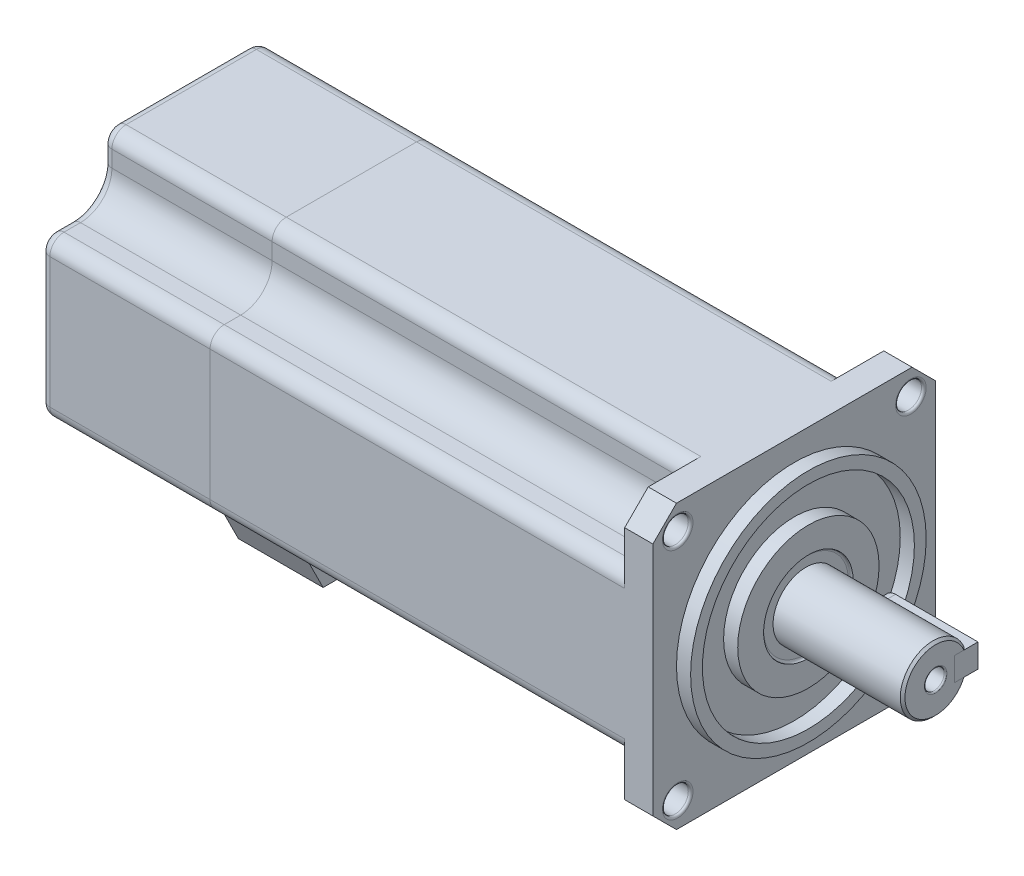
ISO-10303-21;
HEADER;
FILE_DESCRIPTION(('STEP AP214'),'2;1');
FILE_NAME('part.step','',(''),(''),'','','');
FILE_SCHEMA(('AUTOMOTIVE_DESIGN { 1 0 10303 214 1 1 1 1 }'));
ENDSEC;
DATA;
#1=APPLICATION_CONTEXT('core data for automotive mechanical design processes');
#2=APPLICATION_PROTOCOL_DEFINITION('international standard','automotive_design',2000,#1);
#3=PRODUCT_CONTEXT('',#1,'mechanical');
#4=PRODUCT('Part','Part','',(#3));
#5=PRODUCT_RELATED_PRODUCT_CATEGORY('part','',(#4));
#6=PRODUCT_DEFINITION_FORMATION('','',#4);
#7=PRODUCT_DEFINITION_CONTEXT('part definition',#1,'design');
#8=PRODUCT_DEFINITION('design','',#6,#7);
#9=PRODUCT_DEFINITION_SHAPE('','',#8);
#10=(LENGTH_UNIT() NAMED_UNIT(*) SI_UNIT(.MILLI.,.METRE.));
#11=(NAMED_UNIT(*) PLANE_ANGLE_UNIT() SI_UNIT($,.RADIAN.));
#12=(NAMED_UNIT(*) SI_UNIT($,.STERADIAN.) SOLID_ANGLE_UNIT());
#13=UNCERTAINTY_MEASURE_WITH_UNIT(LENGTH_MEASURE(1.E-05),#10,'distance_accuracy_value','');
#14=(GEOMETRIC_REPRESENTATION_CONTEXT(3) GLOBAL_UNCERTAINTY_ASSIGNED_CONTEXT((#13)) GLOBAL_UNIT_ASSIGNED_CONTEXT((#10,
#11,#12)) REPRESENTATION_CONTEXT('',''));
#15=CARTESIAN_POINT('',(0.,0.,0.));
#16=DIRECTION('',(0.,0.,1.));
#17=DIRECTION('',(1.,0.,0.));
#18=AXIS2_PLACEMENT_3D('',#15,#16,#17);
#19=CARTESIAN_POINT('',(-94.,-42.,-12.));
#20=DIRECTION('',(-1.,0.,0.));
#21=DIRECTION('',(0.,0.,1.));
#22=AXIS2_PLACEMENT_3D('',#19,#20,#21);
#23=PLANE('',#22);
#24=DIRECTION('',(0.,0.,1.));
#25=VECTOR('',#24,1.);
#26=CARTESIAN_POINT('',(-94.,-42.,-12.));
#27=LINE('',#26,#25);
#28=CARTESIAN_POINT('',(-94.,-42.,-5.99999999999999));
#29=VERTEX_POINT('',#28);
#30=CARTESIAN_POINT('',(-94.,-42.,6.00000000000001));
#31=VERTEX_POINT('',#30);
#32=EDGE_CURVE('E57',#29,#31,#27,.T.);
#33=ORIENTED_EDGE('',*,*,#32,.F.);
#34=DIRECTION('',(0.,-0.894427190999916,0.447213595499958));
#35=VECTOR('',#34,1.);
#36=CARTESIAN_POINT('',(-94.,-42.,-5.99999999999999));
#37=LINE('',#36,#35);
#38=CARTESIAN_POINT('',(-94.,-30.,-12.));
#39=VERTEX_POINT('',#38);
#40=EDGE_CURVE('E93',#39,#29,#37,.T.);
#41=ORIENTED_EDGE('',*,*,#40,.F.);
#42=DIRECTION('',(0.,0.,1.));
#43=VECTOR('',#42,1.);
#44=CARTESIAN_POINT('',(-94.,-30.,-12.));
#45=LINE('',#44,#43);
#46=CARTESIAN_POINT('',(-94.,-30.,12.));
#47=VERTEX_POINT('',#46);
#48=EDGE_CURVE('E108',#39,#47,#45,.T.);
#49=ORIENTED_EDGE('',*,*,#48,.T.);
#50=DIRECTION('',(0.,0.894427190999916,0.447213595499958));
#51=VECTOR('',#50,1.);
#52=CARTESIAN_POINT('',(-94.,-30.,12.));
#53=LINE('',#52,#51);
#54=EDGE_CURVE('E73',#31,#47,#53,.T.);
#55=ORIENTED_EDGE('',*,*,#54,.F.);
#56=EDGE_LOOP('',(#33,#41,#49,#55));
#57=FACE_BOUND('',#56,.T.);
#58=ADVANCED_FACE('F49',(#57),#23,.F.);
#59=CARTESIAN_POINT('',(-112.,-42.,-12.));
#60=DIRECTION('',(1.,0.,0.));
#61=DIRECTION('',(0.,0.,-1.));
#62=AXIS2_PLACEMENT_3D('',#59,#60,#61);
#63=PLANE('',#62);
#64=DIRECTION('',(0.,0.,-1.));
#65=VECTOR('',#64,1.);
#66=CARTESIAN_POINT('',(-112.,-30.,-12.));
#67=LINE('',#66,#65);
#68=CARTESIAN_POINT('',(-112.,-30.,12.));
#69=VERTEX_POINT('',#68);
#70=CARTESIAN_POINT('',(-112.,-30.,-12.));
#71=VERTEX_POINT('',#70);
#72=EDGE_CURVE('E102',#69,#71,#67,.T.);
#73=ORIENTED_EDGE('',*,*,#72,.T.);
#74=DIRECTION('',(0.,-0.894427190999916,0.447213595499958));
#75=VECTOR('',#74,1.);
#76=CARTESIAN_POINT('',(-112.,-42.,-5.99999999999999));
#77=LINE('',#76,#75);
#78=CARTESIAN_POINT('',(-112.,-42.,-5.99999999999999));
#79=VERTEX_POINT('',#78);
#80=EDGE_CURVE('E65',#71,#79,#77,.T.);
#81=ORIENTED_EDGE('',*,*,#80,.T.);
#82=DIRECTION('',(0.,0.,-1.));
#83=VECTOR('',#82,1.);
#84=CARTESIAN_POINT('',(-112.,-42.,-12.));
#85=LINE('',#84,#83);
#86=CARTESIAN_POINT('',(-112.,-42.,6.00000000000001));
#87=VERTEX_POINT('',#86);
#88=EDGE_CURVE('E12',#87,#79,#85,.T.);
#89=ORIENTED_EDGE('',*,*,#88,.F.);
#90=DIRECTION('',(0.,0.894427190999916,0.447213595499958));
#91=VECTOR('',#90,1.);
#92=CARTESIAN_POINT('',(-112.,-30.,12.));
#93=LINE('',#92,#91);
#94=EDGE_CURVE('E109',#87,#69,#93,.T.);
#95=ORIENTED_EDGE('',*,*,#94,.T.);
#96=EDGE_LOOP('',(#73,#81,#89,#95));
#97=FACE_BOUND('',#96,.T.);
#98=ADVANCED_FACE('F99',(#97),#63,.F.);
#99=CARTESIAN_POINT('',(0.,-42.,0.));
#100=DIRECTION('',(0.,1.,0.));
#101=DIRECTION('',(0.,0.,1.));
#102=AXIS2_PLACEMENT_3D('',#99,#100,#101);
#103=PLANE('',#102);
#104=ORIENTED_EDGE('',*,*,#88,.T.);
#105=DIRECTION('',(1.,0.,0.));
#106=VECTOR('',#105,1.);
#107=CARTESIAN_POINT('',(-112.,-42.,-5.99999999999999));
#108=LINE('',#107,#106);
#109=EDGE_CURVE('E90',#79,#29,#108,.T.);
#110=ORIENTED_EDGE('',*,*,#109,.T.);
#111=ORIENTED_EDGE('',*,*,#32,.T.);
#112=DIRECTION('',(1.,0.,0.));
#113=VECTOR('',#112,1.);
#114=CARTESIAN_POINT('',(-112.,-42.,6.00000000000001));
#115=LINE('',#114,#113);
#116=EDGE_CURVE('E107',#87,#31,#115,.T.);
#117=ORIENTED_EDGE('',*,*,#116,.F.);
#118=EDGE_LOOP('',(#104,#110,#111,#117));
#119=FACE_BOUND('',#118,.T.);
#120=ADVANCED_FACE('F106',(#119),#103,.F.);
#121=CARTESIAN_POINT('',(0.,-30.,0.));
#122=DIRECTION('',(0.,1.,0.));
#123=DIRECTION('',(0.,0.,1.));
#124=AXIS2_PLACEMENT_3D('',#121,#122,#123);
#125=PLANE('',#124);
#126=ORIENTED_EDGE('',*,*,#48,.F.);
#127=DIRECTION('',(1.,0.,0.));
#128=VECTOR('',#127,1.);
#129=CARTESIAN_POINT('',(-112.,-30.,-12.));
#130=LINE('',#129,#128);
#131=EDGE_CURVE('E52',#71,#39,#130,.T.);
#132=ORIENTED_EDGE('',*,*,#131,.F.);
#133=ORIENTED_EDGE('',*,*,#72,.F.);
#134=DIRECTION('',(-1.,0.,0.));
#135=VECTOR('',#134,1.);
#136=CARTESIAN_POINT('',(-112.,-30.,12.));
#137=LINE('',#136,#135);
#138=EDGE_CURVE('E112',#47,#69,#137,.T.);
#139=ORIENTED_EDGE('',*,*,#138,.F.);
#140=EDGE_LOOP('',(#126,#132,#133,#139));
#141=FACE_BOUND('',#140,.T.);
#142=ADVANCED_FACE('F122',(#141),#125,.T.);
#143=CARTESIAN_POINT('',(-112.,-30.,12.));
#144=DIRECTION('',(0.,0.447213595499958,-0.894427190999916));
#145=DIRECTION('',(0.,0.894427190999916,0.447213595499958));
#146=AXIS2_PLACEMENT_3D('',#143,#144,#145);
#147=PLANE('',#146);
#148=ORIENTED_EDGE('',*,*,#54,.T.);
#149=ORIENTED_EDGE('',*,*,#138,.T.);
#150=ORIENTED_EDGE('',*,*,#94,.F.);
#151=ORIENTED_EDGE('',*,*,#116,.T.);
#152=EDGE_LOOP('',(#148,#149,#150,#151));
#153=FACE_BOUND('',#152,.T.);
#154=ADVANCED_FACE('F123',(#153),#147,.F.);
#155=CARTESIAN_POINT('',(-112.,-42.,-5.99999999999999));
#156=DIRECTION('',(0.,0.447213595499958,0.894427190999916));
#157=DIRECTION('',(0.,-0.894427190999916,0.447213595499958));
#158=AXIS2_PLACEMENT_3D('',#155,#156,#157);
#159=PLANE('',#158);
#160=ORIENTED_EDGE('',*,*,#40,.T.);
#161=ORIENTED_EDGE('',*,*,#109,.F.);
#162=ORIENTED_EDGE('',*,*,#80,.F.);
#163=ORIENTED_EDGE('',*,*,#131,.T.);
#164=EDGE_LOOP('',(#160,#161,#162,#163));
#165=FACE_BOUND('',#164,.T.);
#166=ADVANCED_FACE('F91',(#165),#159,.F.);
#167=CLOSED_SHELL('',(#58,#98,#120,#142,#154,#166));
#168=MANIFOLD_SOLID_BREP('B2',#167);
#169=CARTESIAN_POINT('',(-130.,-13.8291679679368,-27.));
#170=DIRECTION('',(1.,0.,0.));
#171=DIRECTION('',(0.,0.,-1.));
#172=AXIS2_PLACEMENT_3D('',#169,#170,#171);
#173=CYLINDRICAL_SURFACE('',#172,3.);
#174=DIRECTION('',(1.,0.,0.));
#175=VECTOR('',#174,1.);
#176=CARTESIAN_POINT('',(-130.,-16.8291679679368,-27.));
#177=LINE('',#176,#175);
#178=CARTESIAN_POINT('',(-128.,-16.8291679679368,-27.));
#179=VERTEX_POINT('',#178);
#180=CARTESIAN_POINT('',(-94.,-16.8291679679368,-27.));
#181=VERTEX_POINT('',#180);
#182=EDGE_CURVE('E414',#179,#181,#177,.T.);
#183=ORIENTED_EDGE('',*,*,#182,.F.);
#184=CARTESIAN_POINT('',(-128.,-13.8291679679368,-27.));
#185=DIRECTION('',(1.,0.,0.));
#186=DIRECTION('',(0.,0.,-1.));
#187=AXIS2_PLACEMENT_3D('',#184,#185,#186);
#188=CIRCLE('',#187,3.);
#189=CARTESIAN_POINT('',(-128.,-13.8291679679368,-30.));
#190=VERTEX_POINT('',#189);
#191=EDGE_CURVE('E47',#179,#190,#188,.T.);
#192=ORIENTED_EDGE('',*,*,#191,.T.);
#193=DIRECTION('',(1.,0.,0.));
#194=VECTOR('',#193,1.);
#195=CARTESIAN_POINT('',(-130.,-13.8291679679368,-30.));
#196=LINE('',#195,#194);
#197=CARTESIAN_POINT('',(-94.,-13.8291679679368,-30.));
#198=VERTEX_POINT('',#197);
#199=EDGE_CURVE('E435',#190,#198,#196,.T.);
#200=ORIENTED_EDGE('',*,*,#199,.T.);
#201=CARTESIAN_POINT('',(-94.,-13.8291679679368,-27.));
#202=DIRECTION('',(-1.,0.,0.));
#203=DIRECTION('',(0.,0.,-1.));
#204=AXIS2_PLACEMENT_3D('',#201,#202,#203);
#205=CIRCLE('',#204,3.);
#206=EDGE_CURVE('E429',#198,#181,#205,.T.);
#207=ORIENTED_EDGE('',*,*,#206,.T.);
#208=EDGE_LOOP('',(#183,#192,#200,#207));
#209=FACE_BOUND('',#208,.T.);
#210=ADVANCED_FACE('F182',(#209),#173,.T.);
#211=CARTESIAN_POINT('',(-130.,-16.8291679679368,-23.5));
#212=DIRECTION('',(0.,1.,0.));
#213=DIRECTION('',(0.,0.,1.));
#214=AXIS2_PLACEMENT_3D('',#211,#212,#213);
#215=PLANE('',#214);
#216=DIRECTION('',(1.,0.,0.));
#217=VECTOR('',#216,1.);
#218=CARTESIAN_POINT('',(-130.,-16.8291679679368,-23.5));
#219=LINE('',#218,#217);
#220=CARTESIAN_POINT('',(-128.,-16.8291679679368,-23.5));
#221=VERTEX_POINT('',#220);
#222=CARTESIAN_POINT('',(-94.,-16.8291679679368,-23.5));
#223=VERTEX_POINT('',#222);
#224=EDGE_CURVE('E423',#221,#223,#219,.T.);
#225=ORIENTED_EDGE('',*,*,#224,.F.);
#226=DIRECTION('',(0.,0.,1.));
#227=VECTOR('',#226,1.);
#228=CARTESIAN_POINT('',(-128.,-16.8291679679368,-23.5));
#229=LINE('',#228,#227);
#230=EDGE_CURVE('E191',#221,#179,#229,.F.);
#231=ORIENTED_EDGE('',*,*,#230,.T.);
#232=ORIENTED_EDGE('',*,*,#182,.T.);
#233=DIRECTION('',(0.,0.,1.));
#234=VECTOR('',#233,1.);
#235=CARTESIAN_POINT('',(-94.,-16.8291679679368,-23.5));
#236=LINE('',#235,#234);
#237=EDGE_CURVE('E417',#181,#223,#236,.T.);
#238=ORIENTED_EDGE('',*,*,#237,.T.);
#239=EDGE_LOOP('',(#225,#231,#232,#238));
#240=FACE_BOUND('',#239,.T.);
#241=ADVANCED_FACE('F416',(#240),#215,.F.);
#242=CARTESIAN_POINT('',(-130.,-23.5,-23.5));
#243=DIRECTION('',(1.,0.,0.));
#244=DIRECTION('',(0.,0.,-1.));
#245=AXIS2_PLACEMENT_3D('',#242,#243,#244);
#246=CYLINDRICAL_SURFACE('',#245,6.67083203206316);
#247=DIRECTION('',(1.,0.,0.));
#248=VECTOR('',#247,1.);
#249=CARTESIAN_POINT('',(-130.,-23.5,-16.8291679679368));
#250=LINE('',#249,#248);
#251=CARTESIAN_POINT('',(-128.,-23.5,-16.8291679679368));
#252=VERTEX_POINT('',#251);
#253=CARTESIAN_POINT('',(-94.,-23.5,-16.8291679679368));
#254=VERTEX_POINT('',#253);
#255=EDGE_CURVE('E545',#252,#254,#250,.T.);
#256=ORIENTED_EDGE('',*,*,#255,.F.);
#257=CARTESIAN_POINT('',(-128.,-23.5,-23.5));
#258=DIRECTION('',(1.,0.,0.));
#259=DIRECTION('',(0.,0.,-1.));
#260=AXIS2_PLACEMENT_3D('',#257,#258,#259);
#261=CIRCLE('',#260,6.67083203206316);
#262=EDGE_CURVE('E206',#252,#221,#261,.F.);
#263=ORIENTED_EDGE('',*,*,#262,.T.);
#264=ORIENTED_EDGE('',*,*,#224,.T.);
#265=CARTESIAN_POINT('',(-94.,-23.5,-23.5));
#266=DIRECTION('',(1.,0.,0.));
#267=DIRECTION('',(0.,0.,1.));
#268=AXIS2_PLACEMENT_3D('',#265,#266,#267);
#269=CIRCLE('',#268,6.67083203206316);
#270=EDGE_CURVE('E432',#223,#254,#269,.T.);
#271=ORIENTED_EDGE('',*,*,#270,.T.);
#272=EDGE_LOOP('',(#256,#263,#264,#271));
#273=FACE_BOUND('',#272,.T.);
#274=ADVANCED_FACE('F863',(#273),#246,.F.);
#275=CARTESIAN_POINT('',(-130.,-23.5,-16.8291679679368));
#276=DIRECTION('',(0.,0.,1.));
#277=DIRECTION('',(1.,0.,0.));
#278=AXIS2_PLACEMENT_3D('',#275,#276,#277);
#279=PLANE('',#278);
#280=DIRECTION('',(1.,0.,0.));
#281=VECTOR('',#280,1.);
#282=CARTESIAN_POINT('',(-130.,-27.,-16.8291679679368));
#283=LINE('',#282,#281);
#284=CARTESIAN_POINT('',(-128.,-27.,-16.8291679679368));
#285=VERTEX_POINT('',#284);
#286=CARTESIAN_POINT('',(-94.,-27.,-16.8291679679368));
#287=VERTEX_POINT('',#286);
#288=EDGE_CURVE('E543',#285,#287,#283,.T.);
#289=ORIENTED_EDGE('',*,*,#288,.F.);
#290=DIRECTION('',(0.,-1.,0.));
#291=VECTOR('',#290,1.);
#292=CARTESIAN_POINT('',(-128.,-23.5,-16.8291679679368));
#293=LINE('',#292,#291);
#294=EDGE_CURVE('E637',#285,#252,#293,.F.);
#295=ORIENTED_EDGE('',*,*,#294,.T.);
#296=ORIENTED_EDGE('',*,*,#255,.T.);
#297=DIRECTION('',(0.,-1.,0.));
#298=VECTOR('',#297,1.);
#299=CARTESIAN_POINT('',(-94.,-23.5,-16.8291679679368));
#300=LINE('',#299,#298);
#301=EDGE_CURVE('E442',#254,#287,#300,.T.);
#302=ORIENTED_EDGE('',*,*,#301,.T.);
#303=EDGE_LOOP('',(#289,#295,#296,#302));
#304=FACE_BOUND('',#303,.T.);
#305=ADVANCED_FACE('F1220',(#304),#279,.F.);
#306=CARTESIAN_POINT('',(-130.,-27.,-13.8291679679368));
#307=DIRECTION('',(1.,0.,0.));
#308=DIRECTION('',(0.,0.,-1.));
#309=AXIS2_PLACEMENT_3D('',#306,#307,#308);
#310=CYLINDRICAL_SURFACE('',#309,3.);
#311=DIRECTION('',(1.,0.,0.));
#312=VECTOR('',#311,1.);
#313=CARTESIAN_POINT('',(-130.,-30.,-13.8291679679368));
#314=LINE('',#313,#312);
#315=CARTESIAN_POINT('',(-128.,-30.,-13.8291679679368));
#316=VERTEX_POINT('',#315);
#317=CARTESIAN_POINT('',(-94.,-30.,-13.8291679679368));
#318=VERTEX_POINT('',#317);
#319=EDGE_CURVE('E541',#316,#318,#314,.T.);
#320=ORIENTED_EDGE('',*,*,#319,.F.);
#321=CARTESIAN_POINT('',(-128.,-27.,-13.8291679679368));
#322=DIRECTION('',(1.,0.,0.));
#323=DIRECTION('',(0.,0.,-1.));
#324=AXIS2_PLACEMENT_3D('',#321,#322,#323);
#325=CIRCLE('',#324,3.);
#326=EDGE_CURVE('E635',#316,#285,#325,.T.);
#327=ORIENTED_EDGE('',*,*,#326,.T.);
#328=ORIENTED_EDGE('',*,*,#288,.T.);
#329=CARTESIAN_POINT('',(-94.,-27.,-13.8291679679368));
#330=DIRECTION('',(-1.,0.,0.));
#331=DIRECTION('',(0.,0.,1.));
#332=AXIS2_PLACEMENT_3D('',#329,#330,#331);
#333=CIRCLE('',#332,3.);
#334=EDGE_CURVE('E445',#287,#318,#333,.T.);
#335=ORIENTED_EDGE('',*,*,#334,.T.);
#336=EDGE_LOOP('',(#320,#327,#328,#335));
#337=FACE_BOUND('',#336,.T.);
#338=ADVANCED_FACE('F1211',(#337),#310,.T.);
#339=CARTESIAN_POINT('',(-130.,-30.,13.8291679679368));
#340=DIRECTION('',(0.,1.,0.));
#341=DIRECTION('',(0.,0.,1.));
#342=AXIS2_PLACEMENT_3D('',#339,#340,#341);
#343=PLANE('',#342);
#344=DIRECTION('',(1.,0.,0.));
#345=VECTOR('',#344,1.);
#346=CARTESIAN_POINT('',(-130.,-30.,13.8291679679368));
#347=LINE('',#346,#345);
#348=CARTESIAN_POINT('',(-128.,-30.,13.8291679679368));
#349=VERTEX_POINT('',#348);
#350=CARTESIAN_POINT('',(-94.,-30.,13.8291679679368));
#351=VERTEX_POINT('',#350);
#352=EDGE_CURVE('E539',#349,#351,#347,.T.);
#353=ORIENTED_EDGE('',*,*,#352,.F.);
#354=DIRECTION('',(0.,0.,1.));
#355=VECTOR('',#354,1.);
#356=CARTESIAN_POINT('',(-128.,-30.,13.8291679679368));
#357=LINE('',#356,#355);
#358=EDGE_CURVE('E633',#349,#316,#357,.F.);
#359=ORIENTED_EDGE('',*,*,#358,.T.);
#360=ORIENTED_EDGE('',*,*,#319,.T.);
#361=DIRECTION('',(0.,0.,1.));
#362=VECTOR('',#361,1.);
#363=CARTESIAN_POINT('',(-94.,-30.,13.8291679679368));
#364=LINE('',#363,#362);
#365=EDGE_CURVE('E448',#318,#351,#364,.T.);
#366=ORIENTED_EDGE('',*,*,#365,.T.);
#367=EDGE_LOOP('',(#353,#359,#360,#366));
#368=FACE_BOUND('',#367,.T.);
#369=ADVANCED_FACE('F1202',(#368),#343,.F.);
#370=CARTESIAN_POINT('',(-130.,-27.,13.8291679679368));
#371=DIRECTION('',(1.,0.,0.));
#372=DIRECTION('',(0.,0.,-1.));
#373=AXIS2_PLACEMENT_3D('',#370,#371,#372);
#374=CYLINDRICAL_SURFACE('',#373,3.);
#375=DIRECTION('',(1.,0.,0.));
#376=VECTOR('',#375,1.);
#377=CARTESIAN_POINT('',(-130.,-27.,16.8291679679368));
#378=LINE('',#377,#376);
#379=CARTESIAN_POINT('',(-128.,-27.,16.8291679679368));
#380=VERTEX_POINT('',#379);
#381=CARTESIAN_POINT('',(-94.,-27.,16.8291679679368));
#382=VERTEX_POINT('',#381);
#383=EDGE_CURVE('E537',#380,#382,#378,.T.);
#384=ORIENTED_EDGE('',*,*,#383,.F.);
#385=CARTESIAN_POINT('',(-128.,-27.,13.8291679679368));
#386=DIRECTION('',(1.,0.,0.));
#387=DIRECTION('',(0.,0.,-1.));
#388=AXIS2_PLACEMENT_3D('',#385,#386,#387);
#389=CIRCLE('',#388,3.);
#390=EDGE_CURVE('E631',#380,#349,#389,.T.);
#391=ORIENTED_EDGE('',*,*,#390,.T.);
#392=ORIENTED_EDGE('',*,*,#352,.T.);
#393=CARTESIAN_POINT('',(-94.,-27.,13.8291679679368));
#394=DIRECTION('',(-1.,0.,0.));
#395=DIRECTION('',(0.,0.,-1.));
#396=AXIS2_PLACEMENT_3D('',#393,#394,#395);
#397=CIRCLE('',#396,3.);
#398=EDGE_CURVE('E451',#351,#382,#397,.T.);
#399=ORIENTED_EDGE('',*,*,#398,.T.);
#400=EDGE_LOOP('',(#384,#391,#392,#399));
#401=FACE_BOUND('',#400,.T.);
#402=ADVANCED_FACE('F1194',(#401),#374,.T.);
#403=CARTESIAN_POINT('',(-130.,-23.5,16.8291679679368));
#404=DIRECTION('',(0.,0.,-1.));
#405=DIRECTION('',(-1.,0.,0.));
#406=AXIS2_PLACEMENT_3D('',#403,#404,#405);
#407=PLANE('',#406);
#408=DIRECTION('',(1.,0.,0.));
#409=VECTOR('',#408,1.);
#410=CARTESIAN_POINT('',(-130.,-23.5,16.8291679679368));
#411=LINE('',#410,#409);
#412=CARTESIAN_POINT('',(-128.,-23.5,16.8291679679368));
#413=VERTEX_POINT('',#412);
#414=CARTESIAN_POINT('',(-94.,-23.5,16.8291679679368));
#415=VERTEX_POINT('',#414);
#416=EDGE_CURVE('E535',#413,#415,#411,.T.);
#417=ORIENTED_EDGE('',*,*,#416,.F.);
#418=DIRECTION('',(0.,1.,0.));
#419=VECTOR('',#418,1.);
#420=CARTESIAN_POINT('',(-128.,-23.5,16.8291679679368));
#421=LINE('',#420,#419);
#422=EDGE_CURVE('E629',#413,#380,#421,.F.);
#423=ORIENTED_EDGE('',*,*,#422,.T.);
#424=ORIENTED_EDGE('',*,*,#383,.T.);
#425=DIRECTION('',(0.,1.,0.));
#426=VECTOR('',#425,1.);
#427=CARTESIAN_POINT('',(-94.,-23.5,16.8291679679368));
#428=LINE('',#427,#426);
#429=EDGE_CURVE('E454',#382,#415,#428,.T.);
#430=ORIENTED_EDGE('',*,*,#429,.T.);
#431=EDGE_LOOP('',(#417,#423,#424,#430));
#432=FACE_BOUND('',#431,.T.);
#433=ADVANCED_FACE('F735',(#432),#407,.F.);
#434=CARTESIAN_POINT('',(-130.,-23.5,23.5));
#435=DIRECTION('',(1.,0.,0.));
#436=DIRECTION('',(0.,0.,-1.));
#437=AXIS2_PLACEMENT_3D('',#434,#435,#436);
#438=CYLINDRICAL_SURFACE('',#437,6.67083203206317);
#439=DIRECTION('',(1.,0.,0.));
#440=VECTOR('',#439,1.);
#441=CARTESIAN_POINT('',(-130.,-16.8291679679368,23.5));
#442=LINE('',#441,#440);
#443=CARTESIAN_POINT('',(-128.,-16.8291679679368,23.5));
#444=VERTEX_POINT('',#443);
#445=CARTESIAN_POINT('',(-94.,-16.8291679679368,23.5));
#446=VERTEX_POINT('',#445);
#447=EDGE_CURVE('E533',#444,#446,#442,.T.);
#448=ORIENTED_EDGE('',*,*,#447,.F.);
#449=CARTESIAN_POINT('',(-128.,-23.5,23.5));
#450=DIRECTION('',(1.,0.,0.));
#451=DIRECTION('',(0.,0.,-1.));
#452=AXIS2_PLACEMENT_3D('',#449,#450,#451);
#453=CIRCLE('',#452,6.67083203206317);
#454=EDGE_CURVE('E627',#444,#413,#453,.F.);
#455=ORIENTED_EDGE('',*,*,#454,.T.);
#456=ORIENTED_EDGE('',*,*,#416,.T.);
#457=CARTESIAN_POINT('',(-94.,-23.5,23.5));
#458=DIRECTION('',(1.,0.,0.));
#459=DIRECTION('',(0.,0.,1.));
#460=AXIS2_PLACEMENT_3D('',#457,#458,#459);
#461=CIRCLE('',#460,6.67083203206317);
#462=EDGE_CURVE('E457',#415,#446,#461,.T.);
#463=ORIENTED_EDGE('',*,*,#462,.T.);
#464=EDGE_LOOP('',(#448,#455,#456,#463));
#465=FACE_BOUND('',#464,.T.);
#466=ADVANCED_FACE('F733',(#465),#438,.F.);
#467=CARTESIAN_POINT('',(-130.,-16.8291679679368,23.5));
#468=DIRECTION('',(0.,1.,0.));
#469=DIRECTION('',(0.,0.,1.));
#470=AXIS2_PLACEMENT_3D('',#467,#468,#469);
#471=PLANE('',#470);
#472=DIRECTION('',(1.,0.,0.));
#473=VECTOR('',#472,1.);
#474=CARTESIAN_POINT('',(-130.,-16.8291679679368,27.));
#475=LINE('',#474,#473);
#476=CARTESIAN_POINT('',(-128.,-16.8291679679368,27.));
#477=VERTEX_POINT('',#476);
#478=CARTESIAN_POINT('',(-94.,-16.8291679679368,27.));
#479=VERTEX_POINT('',#478);
#480=EDGE_CURVE('E531',#477,#479,#475,.T.);
#481=ORIENTED_EDGE('',*,*,#480,.F.);
#482=DIRECTION('',(0.,0.,1.));
#483=VECTOR('',#482,1.);
#484=CARTESIAN_POINT('',(-128.,-16.8291679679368,23.5));
#485=LINE('',#484,#483);
#486=EDGE_CURVE('E625',#477,#444,#485,.F.);
#487=ORIENTED_EDGE('',*,*,#486,.T.);
#488=ORIENTED_EDGE('',*,*,#447,.T.);
#489=DIRECTION('',(0.,0.,1.));
#490=VECTOR('',#489,1.);
#491=CARTESIAN_POINT('',(-94.,-16.8291679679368,23.5));
#492=LINE('',#491,#490);
#493=EDGE_CURVE('E460',#446,#479,#492,.T.);
#494=ORIENTED_EDGE('',*,*,#493,.T.);
#495=EDGE_LOOP('',(#481,#487,#488,#494));
#496=FACE_BOUND('',#495,.T.);
#497=ADVANCED_FACE('F745',(#496),#471,.F.);
#498=CARTESIAN_POINT('',(-130.,-13.8291679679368,27.));
#499=DIRECTION('',(1.,0.,0.));
#500=DIRECTION('',(0.,0.,-1.));
#501=AXIS2_PLACEMENT_3D('',#498,#499,#500);
#502=CYLINDRICAL_SURFACE('',#501,3.);
#503=DIRECTION('',(1.,0.,0.));
#504=VECTOR('',#503,1.);
#505=CARTESIAN_POINT('',(-130.,-13.8291679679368,30.));
#506=LINE('',#505,#504);
#507=CARTESIAN_POINT('',(-128.,-13.8291679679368,30.));
#508=VERTEX_POINT('',#507);
#509=CARTESIAN_POINT('',(-94.,-13.8291679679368,30.));
#510=VERTEX_POINT('',#509);
#511=EDGE_CURVE('E529',#508,#510,#506,.T.);
#512=ORIENTED_EDGE('',*,*,#511,.F.);
#513=CARTESIAN_POINT('',(-128.,-13.8291679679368,27.));
#514=DIRECTION('',(1.,0.,0.));
#515=DIRECTION('',(0.,0.,-1.));
#516=AXIS2_PLACEMENT_3D('',#513,#514,#515);
#517=CIRCLE('',#516,3.);
#518=EDGE_CURVE('E623',#508,#477,#517,.T.);
#519=ORIENTED_EDGE('',*,*,#518,.T.);
#520=ORIENTED_EDGE('',*,*,#480,.T.);
#521=CARTESIAN_POINT('',(-94.,-13.8291679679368,27.));
#522=DIRECTION('',(-1.,0.,0.));
#523=DIRECTION('',(0.,0.,1.));
#524=AXIS2_PLACEMENT_3D('',#521,#522,#523);
#525=CIRCLE('',#524,3.);
#526=EDGE_CURVE('E463',#479,#510,#525,.T.);
#527=ORIENTED_EDGE('',*,*,#526,.T.);
#528=EDGE_LOOP('',(#512,#519,#520,#527));
#529=FACE_BOUND('',#528,.T.);
#530=ADVANCED_FACE('F748',(#529),#502,.T.);
#531=CARTESIAN_POINT('',(-130.,13.8291679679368,30.));
#532=DIRECTION('',(0.,0.,-1.));
#533=DIRECTION('',(0.,1.,0.));
#534=AXIS2_PLACEMENT_3D('',#531,#532,#533);
#535=PLANE('',#534);
#536=DIRECTION('',(1.,0.,0.));
#537=VECTOR('',#536,1.);
#538=CARTESIAN_POINT('',(-130.,13.8291679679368,30.));
#539=LINE('',#538,#537);
#540=CARTESIAN_POINT('',(-128.,13.8291679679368,30.));
#541=VERTEX_POINT('',#540);
#542=CARTESIAN_POINT('',(-94.,13.8291679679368,30.));
#543=VERTEX_POINT('',#542);
#544=EDGE_CURVE('E527',#541,#543,#539,.T.);
#545=ORIENTED_EDGE('',*,*,#544,.F.);
#546=DIRECTION('',(0.,1.,0.));
#547=VECTOR('',#546,1.);
#548=CARTESIAN_POINT('',(-128.,13.8291679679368,30.));
#549=LINE('',#548,#547);
#550=EDGE_CURVE('E621',#541,#508,#549,.F.);
#551=ORIENTED_EDGE('',*,*,#550,.T.);
#552=ORIENTED_EDGE('',*,*,#511,.T.);
#553=DIRECTION('',(0.,1.,0.));
#554=VECTOR('',#553,1.);
#555=CARTESIAN_POINT('',(-94.,13.8291679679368,30.));
#556=LINE('',#555,#554);
#557=EDGE_CURVE('E466',#510,#543,#556,.T.);
#558=ORIENTED_EDGE('',*,*,#557,.T.);
#559=EDGE_LOOP('',(#545,#551,#552,#558));
#560=FACE_BOUND('',#559,.T.);
#561=ADVANCED_FACE('F751',(#560),#535,.F.);
#562=CARTESIAN_POINT('',(-130.,13.8291679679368,27.));
#563=DIRECTION('',(1.,0.,0.));
#564=DIRECTION('',(0.,0.,-1.));
#565=AXIS2_PLACEMENT_3D('',#562,#563,#564);
#566=CYLINDRICAL_SURFACE('',#565,3.);
#567=DIRECTION('',(1.,0.,0.));
#568=VECTOR('',#567,1.);
#569=CARTESIAN_POINT('',(-130.,16.8291679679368,27.));
#570=LINE('',#569,#568);
#571=CARTESIAN_POINT('',(-128.,16.8291679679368,27.));
#572=VERTEX_POINT('',#571);
#573=CARTESIAN_POINT('',(-94.,16.8291679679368,27.));
#574=VERTEX_POINT('',#573);
#575=EDGE_CURVE('E525',#572,#574,#570,.T.);
#576=ORIENTED_EDGE('',*,*,#575,.F.);
#577=CARTESIAN_POINT('',(-128.,13.8291679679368,27.));
#578=DIRECTION('',(1.,0.,0.));
#579=DIRECTION('',(0.,0.,-1.));
#580=AXIS2_PLACEMENT_3D('',#577,#578,#579);
#581=CIRCLE('',#580,3.);
#582=EDGE_CURVE('E619',#572,#541,#581,.T.);
#583=ORIENTED_EDGE('',*,*,#582,.T.);
#584=ORIENTED_EDGE('',*,*,#544,.T.);
#585=CARTESIAN_POINT('',(-94.,13.8291679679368,27.));
#586=DIRECTION('',(-1.,0.,0.));
#587=DIRECTION('',(0.,0.,-1.));
#588=AXIS2_PLACEMENT_3D('',#585,#586,#587);
#589=CIRCLE('',#588,3.);
#590=EDGE_CURVE('E469',#543,#574,#589,.T.);
#591=ORIENTED_EDGE('',*,*,#590,.T.);
#592=EDGE_LOOP('',(#576,#583,#584,#591));
#593=FACE_BOUND('',#592,.T.);
#594=ADVANCED_FACE('F755',(#593),#566,.T.);
#595=CARTESIAN_POINT('',(-130.,16.8291679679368,23.5));
#596=DIRECTION('',(0.,-1.,0.));
#597=DIRECTION('',(0.,0.,-1.));
#598=AXIS2_PLACEMENT_3D('',#595,#596,#597);
#599=PLANE('',#598);
#600=DIRECTION('',(1.,0.,0.));
#601=VECTOR('',#600,1.);
#602=CARTESIAN_POINT('',(-130.,16.8291679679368,23.5));
#603=LINE('',#602,#601);
#604=CARTESIAN_POINT('',(-128.,16.8291679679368,23.5));
#605=VERTEX_POINT('',#604);
#606=CARTESIAN_POINT('',(-94.,16.8291679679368,23.5));
#607=VERTEX_POINT('',#606);
#608=EDGE_CURVE('E523',#605,#607,#603,.T.);
#609=ORIENTED_EDGE('',*,*,#608,.F.);
#610=DIRECTION('',(0.,0.,-1.));
#611=VECTOR('',#610,1.);
#612=CARTESIAN_POINT('',(-128.,16.8291679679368,23.5));
#613=LINE('',#612,#611);
#614=EDGE_CURVE('E617',#605,#572,#613,.F.);
#615=ORIENTED_EDGE('',*,*,#614,.T.);
#616=ORIENTED_EDGE('',*,*,#575,.T.);
#617=DIRECTION('',(0.,0.,-1.));
#618=VECTOR('',#617,1.);
#619=CARTESIAN_POINT('',(-94.,16.8291679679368,23.5));
#620=LINE('',#619,#618);
#621=EDGE_CURVE('E472',#574,#607,#620,.T.);
#622=ORIENTED_EDGE('',*,*,#621,.T.);
#623=EDGE_LOOP('',(#609,#615,#616,#622));
#624=FACE_BOUND('',#623,.T.);
#625=ADVANCED_FACE('F1142',(#624),#599,.F.);
#626=CARTESIAN_POINT('',(-130.,23.5,23.5));
#627=DIRECTION('',(1.,0.,0.));
#628=DIRECTION('',(0.,0.,-1.));
#629=AXIS2_PLACEMENT_3D('',#626,#627,#628);
#630=CYLINDRICAL_SURFACE('',#629,6.67083203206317);
#631=DIRECTION('',(1.,0.,0.));
#632=VECTOR('',#631,1.);
#633=CARTESIAN_POINT('',(-130.,23.5,16.8291679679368));
#634=LINE('',#633,#632);
#635=CARTESIAN_POINT('',(-128.,23.5,16.8291679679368));
#636=VERTEX_POINT('',#635);
#637=CARTESIAN_POINT('',(-94.,23.5,16.8291679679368));
#638=VERTEX_POINT('',#637);
#639=EDGE_CURVE('E521',#636,#638,#634,.T.);
#640=ORIENTED_EDGE('',*,*,#639,.F.);
#641=CARTESIAN_POINT('',(-128.,23.5,23.5));
#642=DIRECTION('',(1.,0.,0.));
#643=DIRECTION('',(0.,0.,-1.));
#644=AXIS2_PLACEMENT_3D('',#641,#642,#643);
#645=CIRCLE('',#644,6.67083203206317);
#646=EDGE_CURVE('E615',#636,#605,#645,.F.);
#647=ORIENTED_EDGE('',*,*,#646,.T.);
#648=ORIENTED_EDGE('',*,*,#608,.T.);
#649=CARTESIAN_POINT('',(-94.,23.5,23.5));
#650=DIRECTION('',(1.,0.,0.));
#651=DIRECTION('',(0.,0.,1.));
#652=AXIS2_PLACEMENT_3D('',#649,#650,#651);
#653=CIRCLE('',#652,6.67083203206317);
#654=EDGE_CURVE('E475',#607,#638,#653,.T.);
#655=ORIENTED_EDGE('',*,*,#654,.T.);
#656=EDGE_LOOP('',(#640,#647,#648,#655));
#657=FACE_BOUND('',#656,.T.);
#658=ADVANCED_FACE('F1133',(#657),#630,.F.);
#659=CARTESIAN_POINT('',(-130.,23.5,16.8291679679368));
#660=DIRECTION('',(0.,0.,-1.));
#661=DIRECTION('',(-1.,0.,0.));
#662=AXIS2_PLACEMENT_3D('',#659,#660,#661);
#663=PLANE('',#662);
#664=DIRECTION('',(1.,0.,0.));
#665=VECTOR('',#664,1.);
#666=CARTESIAN_POINT('',(-130.,27.,16.8291679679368));
#667=LINE('',#666,#665);
#668=CARTESIAN_POINT('',(-128.,27.,16.8291679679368));
#669=VERTEX_POINT('',#668);
#670=CARTESIAN_POINT('',(-94.,27.,16.8291679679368));
#671=VERTEX_POINT('',#670);
#672=EDGE_CURVE('E519',#669,#671,#667,.T.);
#673=ORIENTED_EDGE('',*,*,#672,.F.);
#674=DIRECTION('',(0.,1.,0.));
#675=VECTOR('',#674,1.);
#676=CARTESIAN_POINT('',(-128.,23.5,16.8291679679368));
#677=LINE('',#676,#675);
#678=EDGE_CURVE('E613',#669,#636,#677,.F.);
#679=ORIENTED_EDGE('',*,*,#678,.T.);
#680=ORIENTED_EDGE('',*,*,#639,.T.);
#681=DIRECTION('',(0.,1.,0.));
#682=VECTOR('',#681,1.);
#683=CARTESIAN_POINT('',(-94.,23.5,16.8291679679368));
#684=LINE('',#683,#682);
#685=EDGE_CURVE('E478',#638,#671,#684,.T.);
#686=ORIENTED_EDGE('',*,*,#685,.T.);
#687=EDGE_LOOP('',(#673,#679,#680,#686));
#688=FACE_BOUND('',#687,.T.);
#689=ADVANCED_FACE('F1124',(#688),#663,.F.);
#690=CARTESIAN_POINT('',(-130.,27.,13.8291679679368));
#691=DIRECTION('',(1.,0.,0.));
#692=DIRECTION('',(0.,0.,-1.));
#693=AXIS2_PLACEMENT_3D('',#690,#691,#692);
#694=CYLINDRICAL_SURFACE('',#693,3.);
#695=DIRECTION('',(1.,0.,0.));
#696=VECTOR('',#695,1.);
#697=CARTESIAN_POINT('',(-130.,30.,13.8291679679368));
#698=LINE('',#697,#696);
#699=CARTESIAN_POINT('',(-128.,30.,13.8291679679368));
#700=VERTEX_POINT('',#699);
#701=CARTESIAN_POINT('',(-94.,30.,13.8291679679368));
#702=VERTEX_POINT('',#701);
#703=EDGE_CURVE('E517',#700,#702,#698,.T.);
#704=ORIENTED_EDGE('',*,*,#703,.F.);
#705=CARTESIAN_POINT('',(-128.,27.,13.8291679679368));
#706=DIRECTION('',(1.,0.,0.));
#707=DIRECTION('',(0.,0.,-1.));
#708=AXIS2_PLACEMENT_3D('',#705,#706,#707);
#709=CIRCLE('',#708,3.);
#710=EDGE_CURVE('E611',#700,#669,#709,.T.);
#711=ORIENTED_EDGE('',*,*,#710,.T.);
#712=ORIENTED_EDGE('',*,*,#672,.T.);
#713=CARTESIAN_POINT('',(-94.,27.,13.8291679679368));
#714=DIRECTION('',(-1.,0.,0.));
#715=DIRECTION('',(0.,0.,1.));
#716=AXIS2_PLACEMENT_3D('',#713,#714,#715);
#717=CIRCLE('',#716,3.);
#718=EDGE_CURVE('E481',#671,#702,#717,.T.);
#719=ORIENTED_EDGE('',*,*,#718,.T.);
#720=EDGE_LOOP('',(#704,#711,#712,#719));
#721=FACE_BOUND('',#720,.T.);
#722=ADVANCED_FACE('F1115',(#721),#694,.T.);
#723=CARTESIAN_POINT('',(-130.,30.,-13.8291679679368));
#724=DIRECTION('',(0.,-1.,0.));
#725=DIRECTION('',(0.,0.,-1.));
#726=AXIS2_PLACEMENT_3D('',#723,#724,#725);
#727=PLANE('',#726);
#728=DIRECTION('',(1.,0.,0.));
#729=VECTOR('',#728,1.);
#730=CARTESIAN_POINT('',(-130.,30.,-13.8291679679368));
#731=LINE('',#730,#729);
#732=CARTESIAN_POINT('',(-128.,30.,-13.8291679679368));
#733=VERTEX_POINT('',#732);
#734=CARTESIAN_POINT('',(-94.,30.,-13.8291679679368));
#735=VERTEX_POINT('',#734);
#736=EDGE_CURVE('E515',#733,#735,#731,.T.);
#737=ORIENTED_EDGE('',*,*,#736,.F.);
#738=DIRECTION('',(0.,0.,-1.));
#739=VECTOR('',#738,1.);
#740=CARTESIAN_POINT('',(-128.,30.,-13.8291679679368));
#741=LINE('',#740,#739);
#742=EDGE_CURVE('E609',#733,#700,#741,.F.);
#743=ORIENTED_EDGE('',*,*,#742,.T.);
#744=ORIENTED_EDGE('',*,*,#703,.T.);
#745=DIRECTION('',(0.,0.,-1.));
#746=VECTOR('',#745,1.);
#747=CARTESIAN_POINT('',(-94.,30.,-13.8291679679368));
#748=LINE('',#747,#746);
#749=EDGE_CURVE('E484',#702,#735,#748,.T.);
#750=ORIENTED_EDGE('',*,*,#749,.T.);
#751=EDGE_LOOP('',(#737,#743,#744,#750));
#752=FACE_BOUND('',#751,.T.);
#753=ADVANCED_FACE('F1106',(#752),#727,.F.);
#754=CARTESIAN_POINT('',(-130.,27.,-13.8291679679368));
#755=DIRECTION('',(1.,0.,0.));
#756=DIRECTION('',(0.,0.,-1.));
#757=AXIS2_PLACEMENT_3D('',#754,#755,#756);
#758=CYLINDRICAL_SURFACE('',#757,3.);
#759=DIRECTION('',(1.,0.,0.));
#760=VECTOR('',#759,1.);
#761=CARTESIAN_POINT('',(-130.,27.,-16.8291679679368));
#762=LINE('',#761,#760);
#763=CARTESIAN_POINT('',(-128.,27.,-16.8291679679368));
#764=VERTEX_POINT('',#763);
#765=CARTESIAN_POINT('',(-94.,27.,-16.8291679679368));
#766=VERTEX_POINT('',#765);
#767=EDGE_CURVE('E513',#764,#766,#762,.T.);
#768=ORIENTED_EDGE('',*,*,#767,.F.);
#769=CARTESIAN_POINT('',(-128.,27.,-13.8291679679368));
#770=DIRECTION('',(1.,0.,0.));
#771=DIRECTION('',(0.,0.,-1.));
#772=AXIS2_PLACEMENT_3D('',#769,#770,#771);
#773=CIRCLE('',#772,3.);
#774=EDGE_CURVE('E607',#764,#733,#773,.T.);
#775=ORIENTED_EDGE('',*,*,#774,.T.);
#776=ORIENTED_EDGE('',*,*,#736,.T.);
#777=CARTESIAN_POINT('',(-94.,27.,-13.8291679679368));
#778=DIRECTION('',(-1.,0.,0.));
#779=DIRECTION('',(0.,0.,-1.));
#780=AXIS2_PLACEMENT_3D('',#777,#778,#779);
#781=CIRCLE('',#780,3.);
#782=EDGE_CURVE('E487',#735,#766,#781,.T.);
#783=ORIENTED_EDGE('',*,*,#782,.T.);
#784=EDGE_LOOP('',(#768,#775,#776,#783));
#785=FACE_BOUND('',#784,.T.);
#786=ADVANCED_FACE('F1097',(#785),#758,.T.);
#787=CARTESIAN_POINT('',(-130.,23.5,-16.8291679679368));
#788=DIRECTION('',(0.,0.,1.));
#789=DIRECTION('',(1.,0.,0.));
#790=AXIS2_PLACEMENT_3D('',#787,#788,#789);
#791=PLANE('',#790);
#792=DIRECTION('',(1.,0.,0.));
#793=VECTOR('',#792,1.);
#794=CARTESIAN_POINT('',(-130.,23.5,-16.8291679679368));
#795=LINE('',#794,#793);
#796=CARTESIAN_POINT('',(-128.,23.5,-16.8291679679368));
#797=VERTEX_POINT('',#796);
#798=CARTESIAN_POINT('',(-94.,23.5,-16.8291679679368));
#799=VERTEX_POINT('',#798);
#800=EDGE_CURVE('E511',#797,#799,#795,.T.);
#801=ORIENTED_EDGE('',*,*,#800,.F.);
#802=DIRECTION('',(0.,-1.,0.));
#803=VECTOR('',#802,1.);
#804=CARTESIAN_POINT('',(-128.,23.5,-16.8291679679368));
#805=LINE('',#804,#803);
#806=EDGE_CURVE('E605',#797,#764,#805,.F.);
#807=ORIENTED_EDGE('',*,*,#806,.T.);
#808=ORIENTED_EDGE('',*,*,#767,.T.);
#809=DIRECTION('',(0.,-1.,0.));
#810=VECTOR('',#809,1.);
#811=CARTESIAN_POINT('',(-94.,23.5,-16.8291679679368));
#812=LINE('',#811,#810);
#813=EDGE_CURVE('E490',#766,#799,#812,.T.);
#814=ORIENTED_EDGE('',*,*,#813,.T.);
#815=EDGE_LOOP('',(#801,#807,#808,#814));
#816=FACE_BOUND('',#815,.T.);
#817=ADVANCED_FACE('F1088',(#816),#791,.F.);
#818=CARTESIAN_POINT('',(-130.,23.5,-23.5));
#819=DIRECTION('',(1.,0.,0.));
#820=DIRECTION('',(0.,0.,-1.));
#821=AXIS2_PLACEMENT_3D('',#818,#819,#820);
#822=CYLINDRICAL_SURFACE('',#821,6.67083203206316);
#823=DIRECTION('',(1.,0.,0.));
#824=VECTOR('',#823,1.);
#825=CARTESIAN_POINT('',(-130.,16.8291679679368,-23.5));
#826=LINE('',#825,#824);
#827=CARTESIAN_POINT('',(-128.,16.8291679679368,-23.5));
#828=VERTEX_POINT('',#827);
#829=CARTESIAN_POINT('',(-94.,16.8291679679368,-23.5));
#830=VERTEX_POINT('',#829);
#831=EDGE_CURVE('E509',#828,#830,#826,.T.);
#832=ORIENTED_EDGE('',*,*,#831,.F.);
#833=CARTESIAN_POINT('',(-128.,23.5,-23.5));
#834=DIRECTION('',(1.,0.,0.));
#835=DIRECTION('',(0.,0.,-1.));
#836=AXIS2_PLACEMENT_3D('',#833,#834,#835);
#837=CIRCLE('',#836,6.67083203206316);
#838=EDGE_CURVE('E603',#828,#797,#837,.F.);
#839=ORIENTED_EDGE('',*,*,#838,.T.);
#840=ORIENTED_EDGE('',*,*,#800,.T.);
#841=CARTESIAN_POINT('',(-94.,23.5,-23.5));
#842=DIRECTION('',(1.,0.,0.));
#843=DIRECTION('',(0.,0.,1.));
#844=AXIS2_PLACEMENT_3D('',#841,#842,#843);
#845=CIRCLE('',#844,6.67083203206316);
#846=EDGE_CURVE('E493',#799,#830,#845,.T.);
#847=ORIENTED_EDGE('',*,*,#846,.T.);
#848=EDGE_LOOP('',(#832,#839,#840,#847));
#849=FACE_BOUND('',#848,.T.);
#850=ADVANCED_FACE('F1079',(#849),#822,.F.);
#851=CARTESIAN_POINT('',(-130.,16.8291679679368,-23.5));
#852=DIRECTION('',(0.,-1.,0.));
#853=DIRECTION('',(0.,0.,-1.));
#854=AXIS2_PLACEMENT_3D('',#851,#852,#853);
#855=PLANE('',#854);
#856=DIRECTION('',(1.,0.,0.));
#857=VECTOR('',#856,1.);
#858=CARTESIAN_POINT('',(-130.,16.8291679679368,-27.));
#859=LINE('',#858,#857);
#860=CARTESIAN_POINT('',(-128.,16.8291679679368,-27.));
#861=VERTEX_POINT('',#860);
#862=CARTESIAN_POINT('',(-94.,16.8291679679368,-27.));
#863=VERTEX_POINT('',#862);
#864=EDGE_CURVE('E507',#861,#863,#859,.T.);
#865=ORIENTED_EDGE('',*,*,#864,.F.);
#866=DIRECTION('',(0.,0.,-1.));
#867=VECTOR('',#866,1.);
#868=CARTESIAN_POINT('',(-128.,16.8291679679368,-23.5));
#869=LINE('',#868,#867);
#870=EDGE_CURVE('E601',#861,#828,#869,.F.);
#871=ORIENTED_EDGE('',*,*,#870,.T.);
#872=ORIENTED_EDGE('',*,*,#831,.T.);
#873=DIRECTION('',(0.,0.,-1.));
#874=VECTOR('',#873,1.);
#875=CARTESIAN_POINT('',(-94.,16.8291679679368,-23.5));
#876=LINE('',#875,#874);
#877=EDGE_CURVE('E496',#830,#863,#876,.T.);
#878=ORIENTED_EDGE('',*,*,#877,.T.);
#879=EDGE_LOOP('',(#865,#871,#872,#878));
#880=FACE_BOUND('',#879,.T.);
#881=ADVANCED_FACE('F1070',(#880),#855,.F.);
#882=CARTESIAN_POINT('',(-130.,13.8291679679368,-27.));
#883=DIRECTION('',(1.,0.,0.));
#884=DIRECTION('',(0.,0.,-1.));
#885=AXIS2_PLACEMENT_3D('',#882,#883,#884);
#886=CYLINDRICAL_SURFACE('',#885,3.);
#887=DIRECTION('',(1.,0.,0.));
#888=VECTOR('',#887,1.);
#889=CARTESIAN_POINT('',(-130.,13.8291679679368,-30.));
#890=LINE('',#889,#888);
#891=CARTESIAN_POINT('',(-128.,13.8291679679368,-30.));
#892=VERTEX_POINT('',#891);
#893=CARTESIAN_POINT('',(-94.,13.8291679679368,-30.));
#894=VERTEX_POINT('',#893);
#895=EDGE_CURVE('E505',#892,#894,#890,.T.);
#896=ORIENTED_EDGE('',*,*,#895,.F.);
#897=CARTESIAN_POINT('',(-128.,13.8291679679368,-27.));
#898=DIRECTION('',(1.,0.,0.));
#899=DIRECTION('',(0.,0.,-1.));
#900=AXIS2_PLACEMENT_3D('',#897,#898,#899);
#901=CIRCLE('',#900,3.);
#902=EDGE_CURVE('E599',#892,#861,#901,.T.);
#903=ORIENTED_EDGE('',*,*,#902,.T.);
#904=ORIENTED_EDGE('',*,*,#864,.T.);
#905=CARTESIAN_POINT('',(-94.,13.8291679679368,-27.));
#906=DIRECTION('',(-1.,0.,0.));
#907=DIRECTION('',(0.,0.,1.));
#908=AXIS2_PLACEMENT_3D('',#905,#906,#907);
#909=CIRCLE('',#908,3.);
#910=EDGE_CURVE('E499',#863,#894,#909,.T.);
#911=ORIENTED_EDGE('',*,*,#910,.T.);
#912=EDGE_LOOP('',(#896,#903,#904,#911));
#913=FACE_BOUND('',#912,.T.);
#914=ADVANCED_FACE('F1061',(#913),#886,.T.);
#915=CARTESIAN_POINT('',(-130.,-13.8291679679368,-30.));
#916=DIRECTION('',(0.,0.,1.));
#917=DIRECTION('',(1.,0.,0.));
#918=AXIS2_PLACEMENT_3D('',#915,#916,#917);
#919=PLANE('',#918);
#920=ORIENTED_EDGE('',*,*,#199,.F.);
#921=DIRECTION('',(0.,-1.,0.));
#922=VECTOR('',#921,1.);
#923=CARTESIAN_POINT('',(-128.,-13.8291679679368,-30.));
#924=LINE('',#923,#922);
#925=EDGE_CURVE('E596',#190,#892,#924,.F.);
#926=ORIENTED_EDGE('',*,*,#925,.T.);
#927=ORIENTED_EDGE('',*,*,#895,.T.);
#928=DIRECTION('',(0.,-1.,0.));
#929=VECTOR('',#928,1.);
#930=CARTESIAN_POINT('',(-94.,-13.8291679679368,-30.));
#931=LINE('',#930,#929);
#932=EDGE_CURVE('E502',#894,#198,#931,.T.);
#933=ORIENTED_EDGE('',*,*,#932,.T.);
#934=EDGE_LOOP('',(#920,#926,#927,#933));
#935=FACE_BOUND('',#934,.T.);
#936=ADVANCED_FACE('F1053',(#935),#919,.F.);
#937=CARTESIAN_POINT('',(-130.,-13.8291679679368,-27.));
#938=DIRECTION('',(1.,0.,0.));
#939=DIRECTION('',(0.,0.,-1.));
#940=AXIS2_PLACEMENT_3D('',#937,#938,#939);
#941=PLANE('',#940);
#942=CARTESIAN_POINT('',(-130.,13.8291679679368,-27.));
#943=DIRECTION('',(1.,0.,0.));
#944=DIRECTION('',(0.,0.,-1.));
#945=AXIS2_PLACEMENT_3D('',#942,#943,#944);
#946=CIRCLE('',#945,0.999999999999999);
#947=CARTESIAN_POINT('',(-130.,14.8291679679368,-27.));
#948=VERTEX_POINT('',#947);
#949=CARTESIAN_POINT('',(-130.,13.8291679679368,-28.));
#950=VERTEX_POINT('',#949);
#951=EDGE_CURVE('E591',#948,#950,#946,.F.);
#952=ORIENTED_EDGE('',*,*,#951,.T.);
#953=DIRECTION('',(0.,-1.,0.));
#954=VECTOR('',#953,1.);
#955=CARTESIAN_POINT('',(-130.,-13.8291679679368,-28.));
#956=LINE('',#955,#954);
#957=CARTESIAN_POINT('',(-130.,-13.8291679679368,-28.));
#958=VERTEX_POINT('',#957);
#959=EDGE_CURVE('E593',#950,#958,#956,.T.);
#960=ORIENTED_EDGE('',*,*,#959,.T.);
#961=CARTESIAN_POINT('',(-130.,-13.8291679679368,-27.));
#962=DIRECTION('',(1.,0.,0.));
#963=DIRECTION('',(0.,0.,-1.));
#964=AXIS2_PLACEMENT_3D('',#961,#962,#963);
#965=CIRCLE('',#964,0.999999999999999);
#966=CARTESIAN_POINT('',(-130.,-14.8291679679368,-27.));
#967=VERTEX_POINT('',#966);
#968=EDGE_CURVE('E422',#958,#967,#965,.F.);
#969=ORIENTED_EDGE('',*,*,#968,.T.);
#970=DIRECTION('',(0.,0.,1.));
#971=VECTOR('',#970,1.);
#972=CARTESIAN_POINT('',(-130.,-14.8291679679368,-27.));
#973=LINE('',#972,#971);
#974=CARTESIAN_POINT('',(-130.,-14.8291679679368,-23.5));
#975=VERTEX_POINT('',#974);
#976=EDGE_CURVE('E549',#967,#975,#973,.T.);
#977=ORIENTED_EDGE('',*,*,#976,.T.);
#978=CARTESIAN_POINT('',(-130.,-23.5,-23.5));
#979=DIRECTION('',(1.,0.,0.));
#980=DIRECTION('',(0.,0.,-1.));
#981=AXIS2_PLACEMENT_3D('',#978,#979,#980);
#982=CIRCLE('',#981,8.67083203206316);
#983=CARTESIAN_POINT('',(-130.,-23.5,-14.8291679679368));
#984=VERTEX_POINT('',#983);
#985=EDGE_CURVE('E551',#975,#984,#982,.T.);
#986=ORIENTED_EDGE('',*,*,#985,.T.);
#987=DIRECTION('',(0.,-1.,0.));
#988=VECTOR('',#987,1.);
#989=CARTESIAN_POINT('',(-130.,-13.8291679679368,-14.8291679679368));
#990=LINE('',#989,#988);
#991=CARTESIAN_POINT('',(-130.,-27.,-14.8291679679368));
#992=VERTEX_POINT('',#991);
#993=EDGE_CURVE('E553',#984,#992,#990,.T.);
#994=ORIENTED_EDGE('',*,*,#993,.T.);
#995=CARTESIAN_POINT('',(-130.,-27.,-13.8291679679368));
#996=DIRECTION('',(1.,0.,0.));
#997=DIRECTION('',(0.,0.,-1.));
#998=AXIS2_PLACEMENT_3D('',#995,#996,#997);
#999=CIRCLE('',#998,0.999999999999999);
#1000=CARTESIAN_POINT('',(-130.,-28.,-13.8291679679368));
#1001=VERTEX_POINT('',#1000);
#1002=EDGE_CURVE('E555',#992,#1001,#999,.F.);
#1003=ORIENTED_EDGE('',*,*,#1002,.T.);
#1004=DIRECTION('',(0.,0.,1.));
#1005=VECTOR('',#1004,1.);
#1006=CARTESIAN_POINT('',(-130.,-28.,-27.));
#1007=LINE('',#1006,#1005);
#1008=CARTESIAN_POINT('',(-130.,-28.,13.8291679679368));
#1009=VERTEX_POINT('',#1008);
#1010=EDGE_CURVE('E557',#1001,#1009,#1007,.T.);
#1011=ORIENTED_EDGE('',*,*,#1010,.T.);
#1012=CARTESIAN_POINT('',(-130.,-27.,13.8291679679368));
#1013=DIRECTION('',(1.,0.,0.));
#1014=DIRECTION('',(0.,0.,-1.));
#1015=AXIS2_PLACEMENT_3D('',#1012,#1013,#1014);
#1016=CIRCLE('',#1015,0.999999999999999);
#1017=CARTESIAN_POINT('',(-130.,-27.,14.8291679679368));
#1018=VERTEX_POINT('',#1017);
#1019=EDGE_CURVE('E559',#1009,#1018,#1016,.F.);
#1020=ORIENTED_EDGE('',*,*,#1019,.T.);
#1021=DIRECTION('',(0.,1.,0.));
#1022=VECTOR('',#1021,1.);
#1023=CARTESIAN_POINT('',(-130.,-13.8291679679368,14.8291679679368));
#1024=LINE('',#1023,#1022);
#1025=CARTESIAN_POINT('',(-130.,-23.5,14.8291679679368));
#1026=VERTEX_POINT('',#1025);
#1027=EDGE_CURVE('E561',#1018,#1026,#1024,.T.);
#1028=ORIENTED_EDGE('',*,*,#1027,.T.);
#1029=CARTESIAN_POINT('',(-130.,-23.5,23.5));
#1030=DIRECTION('',(1.,0.,0.));
#1031=DIRECTION('',(0.,0.,-1.));
#1032=AXIS2_PLACEMENT_3D('',#1029,#1030,#1031);
#1033=CIRCLE('',#1032,8.67083203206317);
#1034=CARTESIAN_POINT('',(-130.,-14.8291679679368,23.5));
#1035=VERTEX_POINT('',#1034);
#1036=EDGE_CURVE('E563',#1026,#1035,#1033,.T.);
#1037=ORIENTED_EDGE('',*,*,#1036,.T.);
#1038=DIRECTION('',(0.,0.,1.));
#1039=VECTOR('',#1038,1.);
#1040=CARTESIAN_POINT('',(-130.,-14.8291679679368,-27.));
#1041=LINE('',#1040,#1039);
#1042=CARTESIAN_POINT('',(-130.,-14.8291679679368,27.));
#1043=VERTEX_POINT('',#1042);
#1044=EDGE_CURVE('E565',#1035,#1043,#1041,.T.);
#1045=ORIENTED_EDGE('',*,*,#1044,.T.);
#1046=CARTESIAN_POINT('',(-130.,-13.8291679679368,27.));
#1047=DIRECTION('',(1.,0.,0.));
#1048=DIRECTION('',(0.,0.,-1.));
#1049=AXIS2_PLACEMENT_3D('',#1046,#1047,#1048);
#1050=CIRCLE('',#1049,1.);
#1051=CARTESIAN_POINT('',(-130.,-13.8291679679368,28.));
#1052=VERTEX_POINT('',#1051);
#1053=EDGE_CURVE('E567',#1043,#1052,#1050,.F.);
#1054=ORIENTED_EDGE('',*,*,#1053,.T.);
#1055=DIRECTION('',(0.,1.,0.));
#1056=VECTOR('',#1055,1.);
#1057=CARTESIAN_POINT('',(-130.,-13.8291679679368,28.));
#1058=LINE('',#1057,#1056);
#1059=CARTESIAN_POINT('',(-130.,13.8291679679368,28.));
#1060=VERTEX_POINT('',#1059);
#1061=EDGE_CURVE('E569',#1052,#1060,#1058,.T.);
#1062=ORIENTED_EDGE('',*,*,#1061,.T.);
#1063=CARTESIAN_POINT('',(-130.,13.8291679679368,27.));
#1064=DIRECTION('',(1.,0.,0.));
#1065=DIRECTION('',(0.,0.,-1.));
#1066=AXIS2_PLACEMENT_3D('',#1063,#1064,#1065);
#1067=CIRCLE('',#1066,0.999999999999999);
#1068=CARTESIAN_POINT('',(-130.,14.8291679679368,27.));
#1069=VERTEX_POINT('',#1068);
#1070=EDGE_CURVE('E571',#1060,#1069,#1067,.F.);
#1071=ORIENTED_EDGE('',*,*,#1070,.T.);
#1072=DIRECTION('',(0.,0.,-1.));
#1073=VECTOR('',#1072,1.);
#1074=CARTESIAN_POINT('',(-130.,14.8291679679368,-27.));
#1075=LINE('',#1074,#1073);
#1076=CARTESIAN_POINT('',(-130.,14.8291679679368,23.5));
#1077=VERTEX_POINT('',#1076);
#1078=EDGE_CURVE('E573',#1069,#1077,#1075,.T.);
#1079=ORIENTED_EDGE('',*,*,#1078,.T.);
#1080=CARTESIAN_POINT('',(-130.,23.5,23.5));
#1081=DIRECTION('',(1.,0.,0.));
#1082=DIRECTION('',(0.,0.,-1.));
#1083=AXIS2_PLACEMENT_3D('',#1080,#1081,#1082);
#1084=CIRCLE('',#1083,8.67083203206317);
#1085=CARTESIAN_POINT('',(-130.,23.5,14.8291679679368));
#1086=VERTEX_POINT('',#1085);
#1087=EDGE_CURVE('E575',#1077,#1086,#1084,.T.);
#1088=ORIENTED_EDGE('',*,*,#1087,.T.);
#1089=DIRECTION('',(0.,1.,0.));
#1090=VECTOR('',#1089,1.);
#1091=CARTESIAN_POINT('',(-130.,-13.8291679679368,14.8291679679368));
#1092=LINE('',#1091,#1090);
#1093=CARTESIAN_POINT('',(-130.,27.,14.8291679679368));
#1094=VERTEX_POINT('',#1093);
#1095=EDGE_CURVE('E577',#1086,#1094,#1092,.T.);
#1096=ORIENTED_EDGE('',*,*,#1095,.T.);
#1097=CARTESIAN_POINT('',(-130.,27.,13.8291679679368));
#1098=DIRECTION('',(1.,0.,0.));
#1099=DIRECTION('',(0.,0.,-1.));
#1100=AXIS2_PLACEMENT_3D('',#1097,#1098,#1099);
#1101=CIRCLE('',#1100,0.999999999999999);
#1102=CARTESIAN_POINT('',(-130.,28.,13.8291679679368));
#1103=VERTEX_POINT('',#1102);
#1104=EDGE_CURVE('E579',#1094,#1103,#1101,.F.);
#1105=ORIENTED_EDGE('',*,*,#1104,.T.);
#1106=DIRECTION('',(0.,0.,-1.));
#1107=VECTOR('',#1106,1.);
#1108=CARTESIAN_POINT('',(-130.,28.,-27.));
#1109=LINE('',#1108,#1107);
#1110=CARTESIAN_POINT('',(-130.,28.,-13.8291679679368));
#1111=VERTEX_POINT('',#1110);
#1112=EDGE_CURVE('E581',#1103,#1111,#1109,.T.);
#1113=ORIENTED_EDGE('',*,*,#1112,.T.);
#1114=CARTESIAN_POINT('',(-130.,27.,-13.8291679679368));
#1115=DIRECTION('',(1.,0.,0.));
#1116=DIRECTION('',(0.,0.,-1.));
#1117=AXIS2_PLACEMENT_3D('',#1114,#1115,#1116);
#1118=CIRCLE('',#1117,0.999999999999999);
#1119=CARTESIAN_POINT('',(-130.,27.,-14.8291679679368));
#1120=VERTEX_POINT('',#1119);
#1121=EDGE_CURVE('E583',#1111,#1120,#1118,.F.);
#1122=ORIENTED_EDGE('',*,*,#1121,.T.);
#1123=DIRECTION('',(0.,-1.,0.));
#1124=VECTOR('',#1123,1.);
#1125=CARTESIAN_POINT('',(-130.,-13.8291679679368,-14.8291679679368));
#1126=LINE('',#1125,#1124);
#1127=CARTESIAN_POINT('',(-130.,23.5,-14.8291679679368));
#1128=VERTEX_POINT('',#1127);
#1129=EDGE_CURVE('E585',#1120,#1128,#1126,.T.);
#1130=ORIENTED_EDGE('',*,*,#1129,.T.);
#1131=CARTESIAN_POINT('',(-130.,23.5,-23.5));
#1132=DIRECTION('',(1.,0.,0.));
#1133=DIRECTION('',(0.,0.,-1.));
#1134=AXIS2_PLACEMENT_3D('',#1131,#1132,#1133);
#1135=CIRCLE('',#1134,8.67083203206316);
#1136=CARTESIAN_POINT('',(-130.,14.8291679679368,-23.5));
#1137=VERTEX_POINT('',#1136);
#1138=EDGE_CURVE('E587',#1128,#1137,#1135,.T.);
#1139=ORIENTED_EDGE('',*,*,#1138,.T.);
#1140=DIRECTION('',(0.,0.,-1.));
#1141=VECTOR('',#1140,1.);
#1142=CARTESIAN_POINT('',(-130.,14.8291679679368,-27.));
#1143=LINE('',#1142,#1141);
#1144=EDGE_CURVE('E589',#1137,#948,#1143,.T.);
#1145=ORIENTED_EDGE('',*,*,#1144,.T.);
#1146=EDGE_LOOP('',(#952,#960,#969,#977,#986,#994,#1003,#1011,#1020,#1028,#1037,#1045,#1054,
#1062,#1071,#1079,#1088,#1096,#1105,#1113,#1122,#1130,#1139,#1145));
#1147=FACE_BOUND('',#1146,.T.);
#1148=ADVANCED_FACE('F717',(#1147),#941,.F.);
#1149=CARTESIAN_POINT('',(-94.,-13.8291679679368,-27.));
#1150=DIRECTION('',(1.,0.,0.));
#1151=DIRECTION('',(0.,0.,-1.));
#1152=AXIS2_PLACEMENT_3D('',#1149,#1150,#1151);
#1153=PLANE('',#1152);
#1154=ORIENTED_EDGE('',*,*,#206,.F.);
#1155=ORIENTED_EDGE('',*,*,#932,.F.);
#1156=ORIENTED_EDGE('',*,*,#910,.F.);
#1157=ORIENTED_EDGE('',*,*,#877,.F.);
#1158=ORIENTED_EDGE('',*,*,#846,.F.);
#1159=ORIENTED_EDGE('',*,*,#813,.F.);
#1160=ORIENTED_EDGE('',*,*,#782,.F.);
#1161=ORIENTED_EDGE('',*,*,#749,.F.);
#1162=ORIENTED_EDGE('',*,*,#718,.F.);
#1163=ORIENTED_EDGE('',*,*,#685,.F.);
#1164=ORIENTED_EDGE('',*,*,#654,.F.);
#1165=ORIENTED_EDGE('',*,*,#621,.F.);
#1166=ORIENTED_EDGE('',*,*,#590,.F.);
#1167=ORIENTED_EDGE('',*,*,#557,.F.);
#1168=ORIENTED_EDGE('',*,*,#526,.F.);
#1169=ORIENTED_EDGE('',*,*,#493,.F.);
#1170=ORIENTED_EDGE('',*,*,#462,.F.);
#1171=ORIENTED_EDGE('',*,*,#429,.F.);
#1172=ORIENTED_EDGE('',*,*,#398,.F.);
#1173=ORIENTED_EDGE('',*,*,#365,.F.);
#1174=ORIENTED_EDGE('',*,*,#334,.F.);
#1175=ORIENTED_EDGE('',*,*,#301,.F.);
#1176=ORIENTED_EDGE('',*,*,#270,.F.);
#1177=ORIENTED_EDGE('',*,*,#237,.F.);
#1178=EDGE_LOOP('',(#1154,#1155,#1156,#1157,#1158,#1159,#1160,#1161,#1162,#1163,#1164,#1165,
#1166,#1167,#1168,#1169,#1170,#1171,#1172,#1173,#1174,#1175,#1176,#1177));
#1179=FACE_BOUND('',#1178,.T.);
#1180=ADVANCED_FACE('F427',(#1179),#1153,.T.);
#1181=CARTESIAN_POINT('',(-128.,-13.8291679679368,28.));
#1182=DIRECTION('',(0.,1.,0.));
#1183=DIRECTION('',(0.,0.,1.));
#1184=AXIS2_PLACEMENT_3D('',#1181,#1182,#1183);
#1185=CYLINDRICAL_SURFACE('',#1184,2.);
#1186=CARTESIAN_POINT('',(-128.,-13.8291679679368,28.));
#1187=DIRECTION('',(0.,-1.,0.));
#1188=DIRECTION('',(0.,0.,-1.));
#1189=AXIS2_PLACEMENT_3D('',#1186,#1187,#1188);
#1190=CIRCLE('',#1189,2.);
#1191=EDGE_CURVE('E439',#508,#1052,#1190,.T.);
#1192=ORIENTED_EDGE('',*,*,#1191,.F.);
#1193=ORIENTED_EDGE('',*,*,#550,.F.);
#1194=CARTESIAN_POINT('',(-128.,13.8291679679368,28.));
#1195=DIRECTION('',(0.,1.,0.));
#1196=DIRECTION('',(0.,0.,1.));
#1197=AXIS2_PLACEMENT_3D('',#1194,#1195,#1196);
#1198=CIRCLE('',#1197,2.);
#1199=EDGE_CURVE('E186',#1060,#541,#1198,.T.);
#1200=ORIENTED_EDGE('',*,*,#1199,.F.);
#1201=ORIENTED_EDGE('',*,*,#1061,.F.);
#1202=EDGE_LOOP('',(#1192,#1193,#1200,#1201));
#1203=FACE_BOUND('',#1202,.T.);
#1204=ADVANCED_FACE('F184',(#1203),#1185,.T.);
#1205=CARTESIAN_POINT('',(-128.,13.8291679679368,27.));
#1206=DIRECTION('',(1.,0.,0.));
#1207=DIRECTION('',(0.,0.,-1.));
#1208=AXIS2_PLACEMENT_3D('',#1205,#1206,#1207);
#1209=DEGENERATE_TOROIDAL_SURFACE('',#1208,0.999999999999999,2.,.T.);
#1210=ORIENTED_EDGE('',*,*,#1199,.T.);
#1211=ORIENTED_EDGE('',*,*,#582,.F.);
#1212=CARTESIAN_POINT('',(-128.,14.8291679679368,27.));
#1213=DIRECTION('',(0.,0.,-1.));
#1214=DIRECTION('',(-1.,0.,0.));
#1215=AXIS2_PLACEMENT_3D('',#1212,#1213,#1214);
#1216=CIRCLE('',#1215,2.);
#1217=EDGE_CURVE('E702',#1069,#572,#1216,.T.);
#1218=ORIENTED_EDGE('',*,*,#1217,.F.);
#1219=ORIENTED_EDGE('',*,*,#1070,.F.);
#1220=EDGE_LOOP('',(#1210,#1211,#1218,#1219));
#1221=FACE_BOUND('',#1220,.T.);
#1222=ADVANCED_FACE('F759',(#1221),#1209,.T.);
#1223=CARTESIAN_POINT('',(-128.,-13.8291679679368,27.));
#1224=DIRECTION('',(1.,0.,0.));
#1225=DIRECTION('',(0.,0.,-1.));
#1226=AXIS2_PLACEMENT_3D('',#1223,#1224,#1225);
#1227=DEGENERATE_TOROIDAL_SURFACE('',#1226,1.,2.,.T.);
#1228=ORIENTED_EDGE('',*,*,#1191,.T.);
#1229=ORIENTED_EDGE('',*,*,#1053,.F.);
#1230=CARTESIAN_POINT('',(-128.,-14.8291679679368,27.));
#1231=DIRECTION('',(0.,0.,-1.));
#1232=DIRECTION('',(0.,1.,0.));
#1233=AXIS2_PLACEMENT_3D('',#1230,#1231,#1232);
#1234=CIRCLE('',#1233,2.);
#1235=EDGE_CURVE('E699',#477,#1043,#1234,.T.);
#1236=ORIENTED_EDGE('',*,*,#1235,.F.);
#1237=ORIENTED_EDGE('',*,*,#518,.F.);
#1238=EDGE_LOOP('',(#1228,#1229,#1236,#1237));
#1239=FACE_BOUND('',#1238,.T.);
#1240=ADVANCED_FACE('F709',(#1239),#1227,.T.);
#1241=CARTESIAN_POINT('',(-128.,14.8291679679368,-27.));
#1242=DIRECTION('',(0.,0.,-1.));
#1243=DIRECTION('',(-1.,0.,0.));
#1244=AXIS2_PLACEMENT_3D('',#1241,#1242,#1243);
#1245=CYLINDRICAL_SURFACE('',#1244,2.);
#1246=ORIENTED_EDGE('',*,*,#1217,.T.);
#1247=ORIENTED_EDGE('',*,*,#614,.F.);
#1248=CARTESIAN_POINT('',(-128.,14.8291679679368,23.5));
#1249=DIRECTION('',(0.,0.,-1.));
#1250=DIRECTION('',(-1.,0.,0.));
#1251=AXIS2_PLACEMENT_3D('',#1248,#1249,#1250);
#1252=CIRCLE('',#1251,2.);
#1253=EDGE_CURVE('E696',#1077,#605,#1252,.T.);
#1254=ORIENTED_EDGE('',*,*,#1253,.F.);
#1255=ORIENTED_EDGE('',*,*,#1078,.F.);
#1256=EDGE_LOOP('',(#1246,#1247,#1254,#1255));
#1257=FACE_BOUND('',#1256,.T.);
#1258=ADVANCED_FACE('F763',(#1257),#1245,.T.);
#1259=CARTESIAN_POINT('',(-128.,-14.8291679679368,-27.));
#1260=DIRECTION('',(0.,0.,1.));
#1261=DIRECTION('',(1.,0.,0.));
#1262=AXIS2_PLACEMENT_3D('',#1259,#1260,#1261);
#1263=CYLINDRICAL_SURFACE('',#1262,2.);
#1264=ORIENTED_EDGE('',*,*,#1235,.T.);
#1265=ORIENTED_EDGE('',*,*,#1044,.F.);
#1266=CARTESIAN_POINT('',(-128.,-14.8291679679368,23.5));
#1267=DIRECTION('',(0.,0.,-1.));
#1268=DIRECTION('',(-1.,0.,0.));
#1269=AXIS2_PLACEMENT_3D('',#1266,#1267,#1268);
#1270=CIRCLE('',#1269,2.);
#1271=EDGE_CURVE('E693',#444,#1035,#1270,.T.);
#1272=ORIENTED_EDGE('',*,*,#1271,.F.);
#1273=ORIENTED_EDGE('',*,*,#486,.F.);
#1274=EDGE_LOOP('',(#1264,#1265,#1272,#1273));
#1275=FACE_BOUND('',#1274,.T.);
#1276=ADVANCED_FACE('F723',(#1275),#1263,.T.);
#1277=CARTESIAN_POINT('',(-128.,23.5,23.5));
#1278=DIRECTION('',(1.,0.,0.));
#1279=DIRECTION('',(0.,0.,-1.));
#1280=AXIS2_PLACEMENT_3D('',#1277,#1278,#1279);
#1281=TOROIDAL_SURFACE('',#1280,8.67083203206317,2.);
#1282=ORIENTED_EDGE('',*,*,#1253,.T.);
#1283=ORIENTED_EDGE('',*,*,#646,.F.);
#1284=CARTESIAN_POINT('',(-128.,23.5,14.8291679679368));
#1285=DIRECTION('',(0.,1.,0.));
#1286=DIRECTION('',(0.,0.,1.));
#1287=AXIS2_PLACEMENT_3D('',#1284,#1285,#1286);
#1288=CIRCLE('',#1287,2.);
#1289=EDGE_CURVE('E690',#1086,#636,#1288,.T.);
#1290=ORIENTED_EDGE('',*,*,#1289,.F.);
#1291=ORIENTED_EDGE('',*,*,#1087,.F.);
#1292=EDGE_LOOP('',(#1282,#1283,#1290,#1291));
#1293=FACE_BOUND('',#1292,.T.);
#1294=ADVANCED_FACE('F771',(#1293),#1281,.T.);
#1295=CARTESIAN_POINT('',(-128.,-23.5,23.5));
#1296=DIRECTION('',(1.,0.,0.));
#1297=DIRECTION('',(0.,0.,-1.));
#1298=AXIS2_PLACEMENT_3D('',#1295,#1296,#1297);
#1299=TOROIDAL_SURFACE('',#1298,8.67083203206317,2.);
#1300=ORIENTED_EDGE('',*,*,#1271,.T.);
#1301=ORIENTED_EDGE('',*,*,#1036,.F.);
#1302=CARTESIAN_POINT('',(-128.,-23.5,14.8291679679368));
#1303=DIRECTION('',(0.,-1.,0.));
#1304=DIRECTION('',(0.,0.,-1.));
#1305=AXIS2_PLACEMENT_3D('',#1302,#1303,#1304);
#1306=CIRCLE('',#1305,2.);
#1307=EDGE_CURVE('E687',#413,#1026,#1306,.T.);
#1308=ORIENTED_EDGE('',*,*,#1307,.F.);
#1309=ORIENTED_EDGE('',*,*,#454,.F.);
#1310=EDGE_LOOP('',(#1300,#1301,#1308,#1309));
#1311=FACE_BOUND('',#1310,.T.);
#1312=ADVANCED_FACE('F727',(#1311),#1299,.T.);
#1313=CARTESIAN_POINT('',(-128.,-13.8291679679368,14.8291679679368));
#1314=DIRECTION('',(0.,1.,0.));
#1315=DIRECTION('',(0.,0.,1.));
#1316=AXIS2_PLACEMENT_3D('',#1313,#1314,#1315);
#1317=CYLINDRICAL_SURFACE('',#1316,2.);
#1318=ORIENTED_EDGE('',*,*,#1289,.T.);
#1319=ORIENTED_EDGE('',*,*,#678,.F.);
#1320=CARTESIAN_POINT('',(-128.,27.,14.8291679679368));
#1321=DIRECTION('',(0.,1.,0.));
#1322=DIRECTION('',(0.,0.,1.));
#1323=AXIS2_PLACEMENT_3D('',#1320,#1321,#1322);
#1324=CIRCLE('',#1323,2.);
#1325=EDGE_CURVE('E684',#1094,#669,#1324,.T.);
#1326=ORIENTED_EDGE('',*,*,#1325,.F.);
#1327=ORIENTED_EDGE('',*,*,#1095,.F.);
#1328=EDGE_LOOP('',(#1318,#1319,#1326,#1327));
#1329=FACE_BOUND('',#1328,.T.);
#1330=ADVANCED_FACE('F774',(#1329),#1317,.T.);
#1331=CARTESIAN_POINT('',(-128.,-13.8291679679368,14.8291679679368));
#1332=DIRECTION('',(0.,1.,0.));
#1333=DIRECTION('',(0.,0.,1.));
#1334=AXIS2_PLACEMENT_3D('',#1331,#1332,#1333);
#1335=CYLINDRICAL_SURFACE('',#1334,2.);
#1336=ORIENTED_EDGE('',*,*,#1307,.T.);
#1337=ORIENTED_EDGE('',*,*,#1027,.F.);
#1338=CARTESIAN_POINT('',(-128.,-27.,14.8291679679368));
#1339=DIRECTION('',(0.,-1.,0.));
#1340=DIRECTION('',(0.,0.,-1.));
#1341=AXIS2_PLACEMENT_3D('',#1338,#1339,#1340);
#1342=CIRCLE('',#1341,2.);
#1343=EDGE_CURVE('E681',#380,#1018,#1342,.T.);
#1344=ORIENTED_EDGE('',*,*,#1343,.F.);
#1345=ORIENTED_EDGE('',*,*,#422,.F.);
#1346=EDGE_LOOP('',(#1336,#1337,#1344,#1345));
#1347=FACE_BOUND('',#1346,.T.);
#1348=ADVANCED_FACE('F849',(#1347),#1335,.T.);
#1349=CARTESIAN_POINT('',(-128.,27.,13.8291679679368));
#1350=DIRECTION('',(1.,0.,0.));
#1351=DIRECTION('',(0.,0.,-1.));
#1352=AXIS2_PLACEMENT_3D('',#1349,#1350,#1351);
#1353=DEGENERATE_TOROIDAL_SURFACE('',#1352,0.999999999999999,2.,.T.);
#1354=ORIENTED_EDGE('',*,*,#1325,.T.);
#1355=ORIENTED_EDGE('',*,*,#710,.F.);
#1356=CARTESIAN_POINT('',(-128.,28.,13.8291679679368));
#1357=DIRECTION('',(0.,0.,-1.));
#1358=DIRECTION('',(-1.,0.,0.));
#1359=AXIS2_PLACEMENT_3D('',#1356,#1357,#1358);
#1360=CIRCLE('',#1359,2.);
#1361=EDGE_CURVE('E678',#1103,#700,#1360,.T.);
#1362=ORIENTED_EDGE('',*,*,#1361,.F.);
#1363=ORIENTED_EDGE('',*,*,#1104,.F.);
#1364=EDGE_LOOP('',(#1354,#1355,#1362,#1363));
#1365=FACE_BOUND('',#1364,.T.);
#1366=ADVANCED_FACE('F779',(#1365),#1353,.T.);
#1367=CARTESIAN_POINT('',(-128.,-27.,13.8291679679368));
#1368=DIRECTION('',(1.,0.,0.));
#1369=DIRECTION('',(0.,0.,-1.));
#1370=AXIS2_PLACEMENT_3D('',#1367,#1368,#1369);
#1371=DEGENERATE_TOROIDAL_SURFACE('',#1370,0.999999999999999,2.,.T.);
#1372=ORIENTED_EDGE('',*,*,#1343,.T.);
#1373=ORIENTED_EDGE('',*,*,#1019,.F.);
#1374=CARTESIAN_POINT('',(-128.,-28.,13.8291679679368));
#1375=DIRECTION('',(0.,0.,-1.));
#1376=DIRECTION('',(0.,1.,0.));
#1377=AXIS2_PLACEMENT_3D('',#1374,#1375,#1376);
#1378=CIRCLE('',#1377,2.);
#1379=EDGE_CURVE('E675',#349,#1009,#1378,.T.);
#1380=ORIENTED_EDGE('',*,*,#1379,.F.);
#1381=ORIENTED_EDGE('',*,*,#390,.F.);
#1382=EDGE_LOOP('',(#1372,#1373,#1380,#1381));
#1383=FACE_BOUND('',#1382,.T.);
#1384=ADVANCED_FACE('F845',(#1383),#1371,.T.);
#1385=CARTESIAN_POINT('',(-128.,28.,-27.));
#1386=DIRECTION('',(0.,0.,-1.));
#1387=DIRECTION('',(-1.,0.,0.));
#1388=AXIS2_PLACEMENT_3D('',#1385,#1386,#1387);
#1389=CYLINDRICAL_SURFACE('',#1388,2.);
#1390=ORIENTED_EDGE('',*,*,#1361,.T.);
#1391=ORIENTED_EDGE('',*,*,#742,.F.);
#1392=CARTESIAN_POINT('',(-128.,28.,-13.8291679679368));
#1393=DIRECTION('',(0.,0.,-1.));
#1394=DIRECTION('',(0.,1.,0.));
#1395=AXIS2_PLACEMENT_3D('',#1392,#1393,#1394);
#1396=CIRCLE('',#1395,2.);
#1397=EDGE_CURVE('E672',#1111,#733,#1396,.T.);
#1398=ORIENTED_EDGE('',*,*,#1397,.F.);
#1399=ORIENTED_EDGE('',*,*,#1112,.F.);
#1400=EDGE_LOOP('',(#1390,#1391,#1398,#1399));
#1401=FACE_BOUND('',#1400,.T.);
#1402=ADVANCED_FACE('F786',(#1401),#1389,.T.);
#1403=CARTESIAN_POINT('',(-128.,-28.,-27.));
#1404=DIRECTION('',(0.,0.,1.));
#1405=DIRECTION('',(1.,0.,0.));
#1406=AXIS2_PLACEMENT_3D('',#1403,#1404,#1405);
#1407=CYLINDRICAL_SURFACE('',#1406,2.);
#1408=ORIENTED_EDGE('',*,*,#1379,.T.);
#1409=ORIENTED_EDGE('',*,*,#1010,.F.);
#1410=CARTESIAN_POINT('',(-128.,-28.,-13.8291679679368));
#1411=DIRECTION('',(0.,0.,-1.));
#1412=DIRECTION('',(-1.,0.,0.));
#1413=AXIS2_PLACEMENT_3D('',#1410,#1411,#1412);
#1414=CIRCLE('',#1413,2.);
#1415=EDGE_CURVE('E669',#316,#1001,#1414,.T.);
#1416=ORIENTED_EDGE('',*,*,#1415,.F.);
#1417=ORIENTED_EDGE('',*,*,#358,.F.);
#1418=EDGE_LOOP('',(#1408,#1409,#1416,#1417));
#1419=FACE_BOUND('',#1418,.T.);
#1420=ADVANCED_FACE('F840',(#1419),#1407,.T.);
#1421=CARTESIAN_POINT('',(-128.,27.,-13.8291679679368));
#1422=DIRECTION('',(1.,0.,0.));
#1423=DIRECTION('',(0.,0.,-1.));
#1424=AXIS2_PLACEMENT_3D('',#1421,#1422,#1423);
#1425=DEGENERATE_TOROIDAL_SURFACE('',#1424,0.999999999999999,2.,.T.);
#1426=ORIENTED_EDGE('',*,*,#1397,.T.);
#1427=ORIENTED_EDGE('',*,*,#774,.F.);
#1428=CARTESIAN_POINT('',(-128.,27.,-14.8291679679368));
#1429=DIRECTION('',(0.,-1.,0.));
#1430=DIRECTION('',(0.,0.,-1.));
#1431=AXIS2_PLACEMENT_3D('',#1428,#1429,#1430);
#1432=CIRCLE('',#1431,2.);
#1433=EDGE_CURVE('E666',#1120,#764,#1432,.T.);
#1434=ORIENTED_EDGE('',*,*,#1433,.F.);
#1435=ORIENTED_EDGE('',*,*,#1121,.F.);
#1436=EDGE_LOOP('',(#1426,#1427,#1434,#1435));
#1437=FACE_BOUND('',#1436,.T.);
#1438=ADVANCED_FACE('F789',(#1437),#1425,.T.);
#1439=CARTESIAN_POINT('',(-128.,-27.,-13.8291679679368));
#1440=DIRECTION('',(1.,0.,0.));
#1441=DIRECTION('',(0.,0.,-1.));
#1442=AXIS2_PLACEMENT_3D('',#1439,#1440,#1441);
#1443=DEGENERATE_TOROIDAL_SURFACE('',#1442,0.999999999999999,2.,.T.);
#1444=ORIENTED_EDGE('',*,*,#1415,.T.);
#1445=ORIENTED_EDGE('',*,*,#1002,.F.);
#1446=CARTESIAN_POINT('',(-128.,-27.,-14.8291679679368));
#1447=DIRECTION('',(0.,1.,0.));
#1448=DIRECTION('',(0.,0.,1.));
#1449=AXIS2_PLACEMENT_3D('',#1446,#1447,#1448);
#1450=CIRCLE('',#1449,2.);
#1451=EDGE_CURVE('E663',#285,#992,#1450,.T.);
#1452=ORIENTED_EDGE('',*,*,#1451,.F.);
#1453=ORIENTED_EDGE('',*,*,#326,.F.);
#1454=EDGE_LOOP('',(#1444,#1445,#1452,#1453));
#1455=FACE_BOUND('',#1454,.T.);
#1456=ADVANCED_FACE('F835',(#1455),#1443,.T.);
#1457=CARTESIAN_POINT('',(-128.,-13.8291679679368,-14.8291679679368));
#1458=DIRECTION('',(0.,-1.,0.));
#1459=DIRECTION('',(0.,0.,-1.));
#1460=AXIS2_PLACEMENT_3D('',#1457,#1458,#1459);
#1461=CYLINDRICAL_SURFACE('',#1460,2.);
#1462=ORIENTED_EDGE('',*,*,#1433,.T.);
#1463=ORIENTED_EDGE('',*,*,#806,.F.);
#1464=CARTESIAN_POINT('',(-128.,23.5,-14.8291679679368));
#1465=DIRECTION('',(0.,-1.,0.));
#1466=DIRECTION('',(0.,0.,-1.));
#1467=AXIS2_PLACEMENT_3D('',#1464,#1465,#1466);
#1468=CIRCLE('',#1467,2.);
#1469=EDGE_CURVE('E660',#1128,#797,#1468,.T.);
#1470=ORIENTED_EDGE('',*,*,#1469,.F.);
#1471=ORIENTED_EDGE('',*,*,#1129,.F.);
#1472=EDGE_LOOP('',(#1462,#1463,#1470,#1471));
#1473=FACE_BOUND('',#1472,.T.);
#1474=ADVANCED_FACE('F794',(#1473),#1461,.T.);
#1475=CARTESIAN_POINT('',(-128.,-13.8291679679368,-14.8291679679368));
#1476=DIRECTION('',(0.,-1.,0.));
#1477=DIRECTION('',(0.,0.,-1.));
#1478=AXIS2_PLACEMENT_3D('',#1475,#1476,#1477);
#1479=CYLINDRICAL_SURFACE('',#1478,2.);
#1480=ORIENTED_EDGE('',*,*,#1451,.T.);
#1481=ORIENTED_EDGE('',*,*,#993,.F.);
#1482=CARTESIAN_POINT('',(-128.,-23.5,-14.8291679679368));
#1483=DIRECTION('',(0.,1.,0.));
#1484=DIRECTION('',(0.,0.,1.));
#1485=AXIS2_PLACEMENT_3D('',#1482,#1483,#1484);
#1486=CIRCLE('',#1485,2.);
#1487=EDGE_CURVE('E657',#252,#984,#1486,.T.);
#1488=ORIENTED_EDGE('',*,*,#1487,.F.);
#1489=ORIENTED_EDGE('',*,*,#294,.F.);
#1490=EDGE_LOOP('',(#1480,#1481,#1488,#1489));
#1491=FACE_BOUND('',#1490,.T.);
#1492=ADVANCED_FACE('F830',(#1491),#1479,.T.);
#1493=CARTESIAN_POINT('',(-128.,23.5,-23.5));
#1494=DIRECTION('',(1.,0.,0.));
#1495=DIRECTION('',(0.,0.,-1.));
#1496=AXIS2_PLACEMENT_3D('',#1493,#1494,#1495);
#1497=TOROIDAL_SURFACE('',#1496,8.67083203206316,2.);
#1498=ORIENTED_EDGE('',*,*,#1469,.T.);
#1499=ORIENTED_EDGE('',*,*,#838,.F.);
#1500=CARTESIAN_POINT('',(-128.,14.8291679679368,-23.5));
#1501=DIRECTION('',(0.,0.,-1.));
#1502=DIRECTION('',(-1.,0.,0.));
#1503=AXIS2_PLACEMENT_3D('',#1500,#1501,#1502);
#1504=CIRCLE('',#1503,2.);
#1505=EDGE_CURVE('E654',#1137,#828,#1504,.T.);
#1506=ORIENTED_EDGE('',*,*,#1505,.F.);
#1507=ORIENTED_EDGE('',*,*,#1138,.F.);
#1508=EDGE_LOOP('',(#1498,#1499,#1506,#1507));
#1509=FACE_BOUND('',#1508,.T.);
#1510=ADVANCED_FACE('F801',(#1509),#1497,.T.);
#1511=CARTESIAN_POINT('',(-128.,-23.5,-23.5));
#1512=DIRECTION('',(1.,0.,0.));
#1513=DIRECTION('',(0.,0.,-1.));
#1514=AXIS2_PLACEMENT_3D('',#1511,#1512,#1513);
#1515=TOROIDAL_SURFACE('',#1514,8.67083203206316,2.);
#1516=ORIENTED_EDGE('',*,*,#1487,.T.);
#1517=ORIENTED_EDGE('',*,*,#985,.F.);
#1518=CARTESIAN_POINT('',(-128.,-14.8291679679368,-23.5));
#1519=DIRECTION('',(0.,0.,-1.));
#1520=DIRECTION('',(-1.,0.,0.));
#1521=AXIS2_PLACEMENT_3D('',#1518,#1519,#1520);
#1522=CIRCLE('',#1521,2.);
#1523=EDGE_CURVE('E651',#221,#975,#1522,.T.);
#1524=ORIENTED_EDGE('',*,*,#1523,.F.);
#1525=ORIENTED_EDGE('',*,*,#262,.F.);
#1526=EDGE_LOOP('',(#1516,#1517,#1524,#1525));
#1527=FACE_BOUND('',#1526,.T.);
#1528=ADVANCED_FACE('F826',(#1527),#1515,.T.);
#1529=CARTESIAN_POINT('',(-128.,14.8291679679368,-27.));
#1530=DIRECTION('',(0.,0.,-1.));
#1531=DIRECTION('',(-1.,0.,0.));
#1532=AXIS2_PLACEMENT_3D('',#1529,#1530,#1531);
#1533=CYLINDRICAL_SURFACE('',#1532,2.);
#1534=ORIENTED_EDGE('',*,*,#1505,.T.);
#1535=ORIENTED_EDGE('',*,*,#870,.F.);
#1536=CARTESIAN_POINT('',(-128.,14.8291679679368,-27.));
#1537=DIRECTION('',(0.,0.,-1.));
#1538=DIRECTION('',(0.,1.,0.));
#1539=AXIS2_PLACEMENT_3D('',#1536,#1537,#1538);
#1540=CIRCLE('',#1539,2.);
#1541=EDGE_CURVE('E648',#948,#861,#1540,.T.);
#1542=ORIENTED_EDGE('',*,*,#1541,.F.);
#1543=ORIENTED_EDGE('',*,*,#1144,.F.);
#1544=EDGE_LOOP('',(#1534,#1535,#1542,#1543));
#1545=FACE_BOUND('',#1544,.T.);
#1546=ADVANCED_FACE('F804',(#1545),#1533,.T.);
#1547=CARTESIAN_POINT('',(-128.,-14.8291679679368,-27.));
#1548=DIRECTION('',(0.,0.,1.));
#1549=DIRECTION('',(1.,0.,0.));
#1550=AXIS2_PLACEMENT_3D('',#1547,#1548,#1549);
#1551=CYLINDRICAL_SURFACE('',#1550,2.);
#1552=ORIENTED_EDGE('',*,*,#1523,.T.);
#1553=ORIENTED_EDGE('',*,*,#976,.F.);
#1554=CARTESIAN_POINT('',(-128.,-14.8291679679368,-27.));
#1555=DIRECTION('',(0.,0.,-1.));
#1556=DIRECTION('',(-1.,0.,0.));
#1557=AXIS2_PLACEMENT_3D('',#1554,#1555,#1556);
#1558=CIRCLE('',#1557,2.);
#1559=EDGE_CURVE('E645',#179,#967,#1558,.T.);
#1560=ORIENTED_EDGE('',*,*,#1559,.F.);
#1561=ORIENTED_EDGE('',*,*,#230,.F.);
#1562=EDGE_LOOP('',(#1552,#1553,#1560,#1561));
#1563=FACE_BOUND('',#1562,.T.);
#1564=ADVANCED_FACE('F821',(#1563),#1551,.T.);
#1565=CARTESIAN_POINT('',(-128.,13.8291679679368,-27.));
#1566=DIRECTION('',(1.,0.,0.));
#1567=DIRECTION('',(0.,0.,-1.));
#1568=AXIS2_PLACEMENT_3D('',#1565,#1566,#1567);
#1569=DEGENERATE_TOROIDAL_SURFACE('',#1568,0.999999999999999,2.,.T.);
#1570=ORIENTED_EDGE('',*,*,#1541,.T.);
#1571=ORIENTED_EDGE('',*,*,#902,.F.);
#1572=CARTESIAN_POINT('',(-128.,13.8291679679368,-28.));
#1573=DIRECTION('',(0.,-1.,0.));
#1574=DIRECTION('',(0.,0.,-1.));
#1575=AXIS2_PLACEMENT_3D('',#1572,#1573,#1574);
#1576=CIRCLE('',#1575,2.);
#1577=EDGE_CURVE('E643',#950,#892,#1576,.T.);
#1578=ORIENTED_EDGE('',*,*,#1577,.F.);
#1579=ORIENTED_EDGE('',*,*,#951,.F.);
#1580=EDGE_LOOP('',(#1570,#1571,#1578,#1579));
#1581=FACE_BOUND('',#1580,.T.);
#1582=ADVANCED_FACE('F809',(#1581),#1569,.T.);
#1583=CARTESIAN_POINT('',(-128.,-13.8291679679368,-27.));
#1584=DIRECTION('',(1.,0.,0.));
#1585=DIRECTION('',(0.,0.,-1.));
#1586=AXIS2_PLACEMENT_3D('',#1583,#1584,#1585);
#1587=DEGENERATE_TOROIDAL_SURFACE('',#1586,0.999999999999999,2.,.T.);
#1588=ORIENTED_EDGE('',*,*,#1559,.T.);
#1589=ORIENTED_EDGE('',*,*,#968,.F.);
#1590=CARTESIAN_POINT('',(-128.,-13.8291679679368,-28.));
#1591=DIRECTION('',(0.,1.,0.));
#1592=DIRECTION('',(0.,0.,1.));
#1593=AXIS2_PLACEMENT_3D('',#1590,#1591,#1592);
#1594=CIRCLE('',#1593,2.);
#1595=EDGE_CURVE('E641',#190,#958,#1594,.T.);
#1596=ORIENTED_EDGE('',*,*,#1595,.F.);
#1597=ORIENTED_EDGE('',*,*,#191,.F.);
#1598=EDGE_LOOP('',(#1588,#1589,#1596,#1597));
#1599=FACE_BOUND('',#1598,.T.);
#1600=ADVANCED_FACE('F819',(#1599),#1587,.T.);
#1601=CARTESIAN_POINT('',(-128.,-13.8291679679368,-28.));
#1602=DIRECTION('',(0.,-1.,0.));
#1603=DIRECTION('',(0.,0.,-1.));
#1604=AXIS2_PLACEMENT_3D('',#1601,#1602,#1603);
#1605=CYLINDRICAL_SURFACE('',#1604,2.);
#1606=ORIENTED_EDGE('',*,*,#1577,.T.);
#1607=ORIENTED_EDGE('',*,*,#925,.F.);
#1608=ORIENTED_EDGE('',*,*,#1595,.T.);
#1609=ORIENTED_EDGE('',*,*,#959,.F.);
#1610=EDGE_LOOP('',(#1606,#1607,#1608,#1609));
#1611=FACE_BOUND('',#1610,.T.);
#1612=ADVANCED_FACE('F814',(#1611),#1605,.T.);
#1613=CLOSED_SHELL('',(#210,#241,#274,#305,#338,#369,#402,#433,#466,#497,#530,#561,#594,#625,
#658,#689,#722,#753,#786,#817,#850,#881,#914,#936,#1148,#1180,#1204,#1222,#1240,#1258,#1276,
#1294,#1312,#1330,#1348,#1366,#1384,#1402,#1420,#1438,#1456,#1474,#1492,#1510,#1528,#1546,#1564,
#1582,#1600,#1612));
#1614=MANIFOLD_SOLID_BREP('B6',#1613);
#1615=CARTESIAN_POINT('',(12.5,0.,-9.));
#1616=DIRECTION('',(0.,0.,1.));
#1617=DIRECTION('',(1.,0.,0.));
#1618=AXIS2_PLACEMENT_3D('',#1615,#1616,#1617);
#1619=CYLINDRICAL_SURFACE('',#1618,2.5);
#1620=CARTESIAN_POINT('',(12.5,0.,-4.));
#1621=DIRECTION('',(0.,0.,-1.));
#1622=DIRECTION('',(-1.,0.,0.));
#1623=AXIS2_PLACEMENT_3D('',#1620,#1621,#1622);
#1624=CIRCLE('',#1623,2.5);
#1625=CARTESIAN_POINT('',(12.5,-2.5,-4.));
#1626=VERTEX_POINT('',#1625);
#1627=CARTESIAN_POINT('',(12.5,2.5,-4.));
#1628=VERTEX_POINT('',#1627);
#1629=EDGE_CURVE('E1377',#1626,#1628,#1624,.T.);
#1630=ORIENTED_EDGE('',*,*,#1629,.T.);
#1631=DIRECTION('',(0.,0.,1.));
#1632=VECTOR('',#1631,1.);
#1633=CARTESIAN_POINT('',(12.5,2.5,-9.));
#1634=LINE('',#1633,#1632);
#1635=CARTESIAN_POINT('',(12.5,2.5,-9.));
#1636=VERTEX_POINT('',#1635);
#1637=EDGE_CURVE('E180',#1636,#1628,#1634,.T.);
#1638=ORIENTED_EDGE('',*,*,#1637,.F.);
#1639=CARTESIAN_POINT('',(12.5,0.,-9.));
#1640=DIRECTION('',(0.,0.,-1.));
#1641=DIRECTION('',(-1.,0.,0.));
#1642=AXIS2_PLACEMENT_3D('',#1639,#1640,#1641);
#1643=CIRCLE('',#1642,2.5);
#1644=CARTESIAN_POINT('',(12.5,-2.5,-9.));
#1645=VERTEX_POINT('',#1644);
#1646=EDGE_CURVE('E1365',#1645,#1636,#1643,.T.);
#1647=ORIENTED_EDGE('',*,*,#1646,.F.);
#1648=DIRECTION('',(0.,0.,1.));
#1649=VECTOR('',#1648,1.);
#1650=CARTESIAN_POINT('',(12.5,-2.5,-9.));
#1651=LINE('',#1650,#1649);
#1652=EDGE_CURVE('E1373',#1645,#1626,#1651,.T.);
#1653=ORIENTED_EDGE('',*,*,#1652,.T.);
#1654=EDGE_LOOP('',(#1630,#1638,#1647,#1653));
#1655=FACE_BOUND('',#1654,.T.);
#1656=ADVANCED_FACE('F1314',(#1655),#1619,.T.);
#1657=CARTESIAN_POINT('',(12.5,2.5,-9.));
#1658=DIRECTION('',(0.,-1.,0.));
#1659=DIRECTION('',(0.,0.,-1.));
#1660=AXIS2_PLACEMENT_3D('',#1657,#1658,#1659);
#1661=PLANE('',#1660);
#1662=DIRECTION('',(1.,0.,0.));
#1663=VECTOR('',#1662,1.);
#1664=CARTESIAN_POINT('',(12.5,2.5,-4.));
#1665=LINE('',#1664,#1663);
#1666=CARTESIAN_POINT('',(30.,2.5,-4.));
#1667=VERTEX_POINT('',#1666);
#1668=EDGE_CURVE('E1369',#1628,#1667,#1665,.T.);
#1669=ORIENTED_EDGE('',*,*,#1668,.T.);
#1670=DIRECTION('',(0.,0.,1.));
#1671=VECTOR('',#1670,1.);
#1672=CARTESIAN_POINT('',(30.,2.5,-9.));
#1673=LINE('',#1672,#1671);
#1674=CARTESIAN_POINT('',(30.,2.5,-9.));
#1675=VERTEX_POINT('',#1674);
#1676=EDGE_CURVE('E1322',#1675,#1667,#1673,.T.);
#1677=ORIENTED_EDGE('',*,*,#1676,.F.);
#1678=DIRECTION('',(1.,0.,0.));
#1679=VECTOR('',#1678,1.);
#1680=CARTESIAN_POINT('',(12.5,2.5,-9.));
#1681=LINE('',#1680,#1679);
#1682=EDGE_CURVE('E1360',#1636,#1675,#1681,.T.);
#1683=ORIENTED_EDGE('',*,*,#1682,.F.);
#1684=ORIENTED_EDGE('',*,*,#1637,.T.);
#1685=EDGE_LOOP('',(#1669,#1677,#1683,#1684));
#1686=FACE_BOUND('',#1685,.T.);
#1687=ADVANCED_FACE('F1368',(#1686),#1661,.F.);
#1688=CARTESIAN_POINT('',(30.,2.5,-9.));
#1689=DIRECTION('',(-1.,0.,0.));
#1690=DIRECTION('',(0.,0.,1.));
#1691=AXIS2_PLACEMENT_3D('',#1688,#1689,#1690);
#1692=PLANE('',#1691);
#1693=DIRECTION('',(0.,-1.,0.));
#1694=VECTOR('',#1693,1.);
#1695=CARTESIAN_POINT('',(30.,2.5,-4.));
#1696=LINE('',#1695,#1694);
#1697=CARTESIAN_POINT('',(30.,-2.5,-4.));
#1698=VERTEX_POINT('',#1697);
#1699=EDGE_CURVE('E1347',#1667,#1698,#1696,.T.);
#1700=ORIENTED_EDGE('',*,*,#1699,.T.);
#1701=DIRECTION('',(0.,0.,1.));
#1702=VECTOR('',#1701,1.);
#1703=CARTESIAN_POINT('',(30.,-2.5,-9.));
#1704=LINE('',#1703,#1702);
#1705=CARTESIAN_POINT('',(30.,-2.5,-9.));
#1706=VERTEX_POINT('',#1705);
#1707=EDGE_CURVE('E1370',#1706,#1698,#1704,.T.);
#1708=ORIENTED_EDGE('',*,*,#1707,.F.);
#1709=DIRECTION('',(0.,-1.,0.));
#1710=VECTOR('',#1709,1.);
#1711=CARTESIAN_POINT('',(30.,2.5,-9.));
#1712=LINE('',#1711,#1710);
#1713=EDGE_CURVE('E1363',#1675,#1706,#1712,.T.);
#1714=ORIENTED_EDGE('',*,*,#1713,.F.);
#1715=ORIENTED_EDGE('',*,*,#1676,.T.);
#1716=EDGE_LOOP('',(#1700,#1708,#1714,#1715));
#1717=FACE_BOUND('',#1716,.T.);
#1718=ADVANCED_FACE('F1371',(#1717),#1692,.F.);
#1719=CARTESIAN_POINT('',(30.,-2.5,-9.));
#1720=DIRECTION('',(0.,1.,0.));
#1721=DIRECTION('',(0.,0.,1.));
#1722=AXIS2_PLACEMENT_3D('',#1719,#1720,#1721);
#1723=PLANE('',#1722);
#1724=DIRECTION('',(-1.,0.,0.));
#1725=VECTOR('',#1724,1.);
#1726=CARTESIAN_POINT('',(30.,-2.5,-4.));
#1727=LINE('',#1726,#1725);
#1728=EDGE_CURVE('E1353',#1698,#1626,#1727,.T.);
#1729=ORIENTED_EDGE('',*,*,#1728,.T.);
#1730=ORIENTED_EDGE('',*,*,#1652,.F.);
#1731=DIRECTION('',(-1.,0.,0.));
#1732=VECTOR('',#1731,1.);
#1733=CARTESIAN_POINT('',(30.,-2.5,-9.));
#1734=LINE('',#1733,#1732);
#1735=EDGE_CURVE('E1330',#1706,#1645,#1734,.T.);
#1736=ORIENTED_EDGE('',*,*,#1735,.F.);
#1737=ORIENTED_EDGE('',*,*,#1707,.T.);
#1738=EDGE_LOOP('',(#1729,#1730,#1736,#1737));
#1739=FACE_BOUND('',#1738,.T.);
#1740=ADVANCED_FACE('F1384',(#1739),#1723,.F.);
#1741=CARTESIAN_POINT('',(12.5,0.,-9.));
#1742=DIRECTION('',(0.,0.,-1.));
#1743=DIRECTION('',(-1.,0.,0.));
#1744=AXIS2_PLACEMENT_3D('',#1741,#1742,#1743);
#1745=PLANE('',#1744);
#1746=ORIENTED_EDGE('',*,*,#1646,.T.);
#1747=ORIENTED_EDGE('',*,*,#1682,.T.);
#1748=ORIENTED_EDGE('',*,*,#1713,.T.);
#1749=ORIENTED_EDGE('',*,*,#1735,.T.);
#1750=EDGE_LOOP('',(#1746,#1747,#1748,#1749));
#1751=FACE_BOUND('',#1750,.T.);
#1752=ADVANCED_FACE('F1361',(#1751),#1745,.T.);
#1753=CARTESIAN_POINT('',(12.5,0.,-4.));
#1754=DIRECTION('',(0.,0.,-1.));
#1755=DIRECTION('',(-1.,0.,0.));
#1756=AXIS2_PLACEMENT_3D('',#1753,#1754,#1755);
#1757=PLANE('',#1756);
#1758=ORIENTED_EDGE('',*,*,#1629,.F.);
#1759=ORIENTED_EDGE('',*,*,#1728,.F.);
#1760=ORIENTED_EDGE('',*,*,#1699,.F.);
#1761=ORIENTED_EDGE('',*,*,#1668,.F.);
#1762=EDGE_LOOP('',(#1758,#1759,#1760,#1761));
#1763=FACE_BOUND('',#1762,.T.);
#1764=ADVANCED_FACE('F1387',(#1763),#1757,.F.);
#1765=CLOSED_SHELL('',(#1656,#1687,#1718,#1740,#1752,#1764));
#1766=MANIFOLD_SOLID_BREP('B41',#1765);
#1767=CARTESIAN_POINT('',(30.,0.,0.));
#1768=DIRECTION('',(-1.,0.,0.));
#1769=DIRECTION('',(0.,0.,1.));
#1770=AXIS2_PLACEMENT_3D('',#1767,#1768,#1769);
#1771=CYLINDRICAL_SURFACE('',#1770,7.);
#1772=CARTESIAN_POINT('',(2.5,0.,0.));
#1773=DIRECTION('',(1.,0.,0.));
#1774=DIRECTION('',(0.,0.,-1.));
#1775=AXIS2_PLACEMENT_3D('',#1772,#1773,#1774);
#1776=CIRCLE('',#1775,7.);
#1777=CARTESIAN_POINT('',(2.5,0.,-7.));
#1778=VERTEX_POINT('',#1777);
#1779=EDGE_CURVE('E1716',#1778,#1778,#1776,.T.);
#1780=ORIENTED_EDGE('',*,*,#1779,.T.);
#1781=EDGE_LOOP('',(#1780));
#1782=FACE_BOUND('',#1781,.T.);
#1783=DIRECTION('',(-1.,0.,0.));
#1784=VECTOR('',#1783,1.);
#1785=CARTESIAN_POINT('',(30.,-2.5,-6.53834841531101));
#1786=LINE('',#1785,#1784);
#1787=CARTESIAN_POINT('',(29.5,-2.5,-6.53834841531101));
#1788=VERTEX_POINT('',#1787);
#1789=CARTESIAN_POINT('',(12.5,-2.5,-6.53834841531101));
#1790=VERTEX_POINT('',#1789);
#1791=EDGE_CURVE('E1714',#1788,#1790,#1786,.T.);
#1792=ORIENTED_EDGE('',*,*,#1791,.F.);
#1793=CARTESIAN_POINT('',(29.5,0.,0.));
#1794=DIRECTION('',(1.,0.,0.));
#1795=DIRECTION('',(0.,0.,-1.));
#1796=AXIS2_PLACEMENT_3D('',#1793,#1794,#1795);
#1797=CIRCLE('',#1796,7.);
#1798=CARTESIAN_POINT('',(29.5,2.5,-6.53834841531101));
#1799=VERTEX_POINT('',#1798);
#1800=EDGE_CURVE('E1453',#1788,#1799,#1797,.F.);
#1801=ORIENTED_EDGE('',*,*,#1800,.T.);
#1802=DIRECTION('',(-1.,0.,0.));
#1803=VECTOR('',#1802,1.);
#1804=CARTESIAN_POINT('',(30.,2.5,-6.53834841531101));
#1805=LINE('',#1804,#1803);
#1806=CARTESIAN_POINT('',(12.5,2.5,-6.53834841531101));
#1807=VERTEX_POINT('',#1806);
#1808=EDGE_CURVE('E1712',#1807,#1799,#1805,.F.);
#1809=ORIENTED_EDGE('',*,*,#1808,.F.);
#1810=CARTESIAN_POINT('',(12.5,-2.5,-6.53834841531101));
#1811=CARTESIAN_POINT('',(12.4321107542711,-2.50000932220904,-6.53833653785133));
#1812=CARTESIAN_POINT('',(12.3642280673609,-2.49723485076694,-6.53940549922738));
#1813=CARTESIAN_POINT('',(12.2289960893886,-2.4861910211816,-6.54361657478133));
#1814=CARTESIAN_POINT('',(12.1616466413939,-2.47792334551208,-6.54675805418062));
#1815=CARTESIAN_POINT('',(12.0281785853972,-2.456001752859,-6.55501217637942));
#1816=CARTESIAN_POINT('',(11.9620566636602,-2.44236559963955,-6.56011831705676));
#1817=CARTESIAN_POINT('',(11.8312981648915,-2.40985115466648,-6.57213177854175));
#1818=CARTESIAN_POINT('',(11.7666616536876,-2.39097263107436,-6.57903917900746));
#1819=CARTESIAN_POINT('',(11.5757356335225,-2.32673964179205,-6.60214934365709));
#1820=CARTESIAN_POINT('',(11.4522095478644,-2.27375112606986,-6.62075475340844));
#1821=CARTESIAN_POINT('',(11.215769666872,-2.14910757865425,-6.6622539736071));
#1822=CARTESIAN_POINT('',(11.1028636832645,-2.07743895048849,-6.68515090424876));
#1823=CARTESIAN_POINT('',(10.8857847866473,-1.9140257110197,-6.73379913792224));
#1824=CARTESIAN_POINT('',(10.7821535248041,-1.82158337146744,-6.75962864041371));
#1825=CARTESIAN_POINT('',(10.5914912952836,-1.6207338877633,-6.81057592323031));
#1826=CARTESIAN_POINT('',(10.5044634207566,-1.51232377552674,-6.83569357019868));
#1827=CARTESIAN_POINT('',(10.346910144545,-1.27853915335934,-6.88331133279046));
#1828=CARTESIAN_POINT('',(10.2769684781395,-1.15274833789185,-6.90570835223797));
#1829=CARTESIAN_POINT('',(10.1594633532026,-0.890250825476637,-6.94442357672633));
#1830=CARTESIAN_POINT('',(10.111892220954,-0.753547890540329,-6.96074386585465));
#1831=CARTESIAN_POINT('',(10.0423593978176,-0.478829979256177,-6.9849105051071));
#1832=CARTESIAN_POINT('',(10.0194608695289,-0.341079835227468,-6.99306594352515));
#1833=CARTESIAN_POINT('',(9.99693159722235,-0.0634643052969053,-7.00108798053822));
#1834=CARTESIAN_POINT('',(9.99729441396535,0.0764004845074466,-7.00095687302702));
#1835=CARTESIAN_POINT('',(10.0207112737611,0.347593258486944,-6.99262258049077));
#1836=CARTESIAN_POINT('',(10.0427447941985,0.479022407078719,-6.98478243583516));
#1837=CARTESIAN_POINT('',(10.1071734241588,0.736175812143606,-6.96237832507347));
#1838=CARTESIAN_POINT('',(10.1495696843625,0.861899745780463,-6.94781397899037));
#1839=CARTESIAN_POINT('',(10.2540469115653,1.10616102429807,-6.91316506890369));
#1840=CARTESIAN_POINT('',(10.3163957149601,1.22457279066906,-6.89300592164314));
#1841=CARTESIAN_POINT('',(10.4587793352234,1.44953531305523,-6.84923355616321));
#1842=CARTESIAN_POINT('',(10.5388195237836,1.5560824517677,-6.82561928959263));
#1843=CARTESIAN_POINT('',(10.7193232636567,1.7603244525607,-6.7759054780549));
#1844=CARTESIAN_POINT('',(10.8206497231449,1.85724185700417,-6.74974055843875));
#1845=CARTESIAN_POINT('',(11.0383273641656,2.03299914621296,-6.69890342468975));
#1846=CARTESIAN_POINT('',(11.1546839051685,2.11183255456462,-6.67423174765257));
#1847=CARTESIAN_POINT('',(11.401942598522,2.25049860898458,-6.62877803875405));
#1848=CARTESIAN_POINT('',(11.5330789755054,2.30994207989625,-6.60807875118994));
#1849=CARTESIAN_POINT('',(11.8043648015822,2.4055543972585,-6.57388213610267));
#1850=CARTESIAN_POINT('',(11.944499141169,2.44176119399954,-6.56037307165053));
#1851=CARTESIAN_POINT('',(12.1550305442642,2.47705497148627,-6.54708542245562));
#1852=CARTESIAN_POINT('',(12.2237363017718,2.48565347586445,-6.54382010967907));
#1853=CARTESIAN_POINT('',(12.3616151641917,2.49712352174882,-6.53944910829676));
#1854=CARTESIAN_POINT('',(12.4307876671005,2.50000139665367,-6.53834103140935));
#1855=CARTESIAN_POINT('',(12.5,2.5,-6.53834841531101));
#1856=B_SPLINE_CURVE_WITH_KNOTS('',3,(#1810,#1811,#1812,#1813,#1814,#1815,#1816,#1817,#1818,
#1819,#1820,#1821,#1822,#1823,#1824,#1825,#1826,#1827,#1828,#1829,#1830,#1831,#1832,#1833,#1834,
#1835,#1836,#1837,#1838,#1839,#1840,#1841,#1842,#1843,#1844,#1845,#1846,#1847,#1848,#1849,#1850,
#1851,#1852,#1853,#1854,#1855),.UNSPECIFIED.,.F.,.F.,(4,2,2,2,2,2,2,2,2,2,2,2,2,2,2,2,2,2,2,2,2,
2,4),(0.,0.203591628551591,0.40712092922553,0.609982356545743,0.812852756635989,
1.21793118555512,1.6233052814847,2.0451597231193,2.4670926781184,2.90188398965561,
3.33652604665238,3.75400993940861,4.17137826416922,4.56998920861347,4.96862268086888,
5.37284909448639,5.77719841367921,6.20315837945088,6.62927065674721,7.06347329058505,
7.49696496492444,7.70468580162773,7.91217653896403),.UNSPECIFIED.);
#1857=EDGE_CURVE('E1995',#1790,#1807,#1856,.T.);
#1858=ORIENTED_EDGE('',*,*,#1857,.F.);
#1859=EDGE_LOOP('',(#1792,#1801,#1809,#1858));
#1860=FACE_BOUND('',#1859,.T.);
#1861=ADVANCED_FACE('F1438',(#1782,#1860),#1771,.T.);
#1862=CARTESIAN_POINT('',(30.,0.,0.));
#1863=DIRECTION('',(1.,0.,0.));
#1864=DIRECTION('',(0.,0.,-1.));
#1865=AXIS2_PLACEMENT_3D('',#1862,#1863,#1864);
#1866=PLANE('',#1865);
#1867=CARTESIAN_POINT('',(30.,0.,0.));
#1868=DIRECTION('',(1.,0.,0.));
#1869=DIRECTION('',(0.,0.,-1.));
#1870=AXIS2_PLACEMENT_3D('',#1867,#1868,#1869);
#1871=CIRCLE('',#1870,2.4);
#1872=CARTESIAN_POINT('',(30.,0.,-2.4));
#1873=VERTEX_POINT('',#1872);
#1874=EDGE_CURVE('E1312',#1873,#1873,#1871,.F.);
#1875=ORIENTED_EDGE('',*,*,#1874,.T.);
#1876=EDGE_LOOP('',(#1875));
#1877=FACE_BOUND('',#1876,.T.);
#1878=DIRECTION('',(0.,0.,-1.));
#1879=VECTOR('',#1878,1.);
#1880=CARTESIAN_POINT('',(30.,2.5,-4.));
#1881=LINE('',#1880,#1879);
#1882=CARTESIAN_POINT('',(30.,2.5,-4.));
#1883=VERTEX_POINT('',#1882);
#1884=CARTESIAN_POINT('',(30.,2.5,-5.99999999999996));
#1885=VERTEX_POINT('',#1884);
#1886=EDGE_CURVE('E1704',#1883,#1885,#1881,.T.);
#1887=ORIENTED_EDGE('',*,*,#1886,.T.);
#1888=CARTESIAN_POINT('',(30.,0.,0.));
#1889=DIRECTION('',(1.,0.,0.));
#1890=DIRECTION('',(0.,0.,-1.));
#1891=AXIS2_PLACEMENT_3D('',#1888,#1889,#1890);
#1892=CIRCLE('',#1891,6.49999999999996);
#1893=CARTESIAN_POINT('',(30.,-2.5,-5.99999999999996));
#1894=VERTEX_POINT('',#1893);
#1895=EDGE_CURVE('E2002',#1885,#1894,#1892,.T.);
#1896=ORIENTED_EDGE('',*,*,#1895,.T.);
#1897=DIRECTION('',(0.,0.,-1.));
#1898=VECTOR('',#1897,1.);
#1899=CARTESIAN_POINT('',(30.,-2.5,-4.));
#1900=LINE('',#1899,#1898);
#1901=CARTESIAN_POINT('',(30.,-2.5,-4.));
#1902=VERTEX_POINT('',#1901);
#1903=EDGE_CURVE('E1707',#1902,#1894,#1900,.T.);
#1904=ORIENTED_EDGE('',*,*,#1903,.F.);
#1905=DIRECTION('',(0.,1.,0.));
#1906=VECTOR('',#1905,1.);
#1907=CARTESIAN_POINT('',(30.,-2.5,-4.));
#1908=LINE('',#1907,#1906);
#1909=EDGE_CURVE('E1696',#1902,#1883,#1908,.T.);
#1910=ORIENTED_EDGE('',*,*,#1909,.T.);
#1911=EDGE_LOOP('',(#1887,#1896,#1904,#1910));
#1912=FACE_BOUND('',#1911,.T.);
#1913=ADVANCED_FACE('F2016',(#1877,#1912),#1866,.T.);
#1914=CARTESIAN_POINT('',(2.5,0.,0.));
#1915=DIRECTION('',(1.,0.,0.));
#1916=DIRECTION('',(0.,0.,-1.));
#1917=AXIS2_PLACEMENT_3D('',#1914,#1915,#1916);
#1918=PLANE('',#1917);
#1919=CARTESIAN_POINT('',(2.5,0.,0.));
#1920=DIRECTION('',(1.,0.,0.));
#1921=DIRECTION('',(0.,0.,-1.));
#1922=AXIS2_PLACEMENT_3D('',#1919,#1920,#1921);
#1923=CIRCLE('',#1922,9.);
#1924=CARTESIAN_POINT('',(2.5,0.,-9.));
#1925=VERTEX_POINT('',#1924);
#1926=EDGE_CURVE('E1992',#1925,#1925,#1923,.T.);
#1927=ORIENTED_EDGE('',*,*,#1926,.T.);
#1928=EDGE_LOOP('',(#1927));
#1929=FACE_BOUND('',#1928,.T.);
#1930=ORIENTED_EDGE('',*,*,#1779,.F.);
#1931=EDGE_LOOP('',(#1930));
#1932=FACE_BOUND('',#1931,.T.);
#1933=ADVANCED_FACE('F2018',(#1929,#1932),#1918,.T.);
#1934=CARTESIAN_POINT('',(0.,0.,0.));
#1935=DIRECTION('',(-1.,0.,0.));
#1936=DIRECTION('',(0.,0.,1.));
#1937=AXIS2_PLACEMENT_3D('',#1934,#1935,#1936);
#1938=PLANE('',#1937);
#1939=CARTESIAN_POINT('',(0.,0.,0.));
#1940=DIRECTION('',(1.,0.,0.));
#1941=DIRECTION('',(0.,0.,-1.));
#1942=AXIS2_PLACEMENT_3D('',#1939,#1940,#1941);
#1943=CIRCLE('',#1942,22.5);
#1944=CARTESIAN_POINT('',(0.,0.,-22.5));
#1945=VERTEX_POINT('',#1944);
#1946=EDGE_CURVE('E1725',#1945,#1945,#1943,.T.);
#1947=ORIENTED_EDGE('',*,*,#1946,.T.);
#1948=EDGE_LOOP('',(#1947));
#1949=FACE_BOUND('',#1948,.T.);
#1950=CARTESIAN_POINT('',(0.,0.,0.));
#1951=DIRECTION('',(-1.,0.,0.));
#1952=DIRECTION('',(0.,0.,1.));
#1953=AXIS2_PLACEMENT_3D('',#1950,#1951,#1952);
#1954=CIRCLE('',#1953,15.);
#1955=CARTESIAN_POINT('',(0.,0.,15.));
#1956=VERTEX_POINT('',#1955);
#1957=EDGE_CURVE('E1989',#1956,#1956,#1954,.F.);
#1958=ORIENTED_EDGE('',*,*,#1957,.F.);
#1959=EDGE_LOOP('',(#1958));
#1960=FACE_BOUND('',#1959,.T.);
#1961=ADVANCED_FACE('F2025',(#1949,#1960),#1938,.F.);
#1962=CARTESIAN_POINT('',(0.,24.7487373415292,-24.7487373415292));
#1963=DIRECTION('',(-1.,0.,0.));
#1964=DIRECTION('',(0.,0.,1.));
#1965=AXIS2_PLACEMENT_3D('',#1962,#1963,#1964);
#1966=CIRCLE('',#1965,3.25);
#1967=CARTESIAN_POINT('',(0.,24.7487373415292,-21.4987373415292));
#1968=VERTEX_POINT('',#1967);
#1969=EDGE_CURVE('E2087',#1968,#1968,#1966,.T.);
#1970=ORIENTED_EDGE('',*,*,#1969,.T.);
#1971=EDGE_LOOP('',(#1970));
#1972=FACE_BOUND('',#1971,.T.);
#1973=CARTESIAN_POINT('',(0.,-24.7487373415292,-24.7487373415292));
#1974=DIRECTION('',(-1.,0.,0.));
#1975=DIRECTION('',(0.,0.,1.));
#1976=AXIS2_PLACEMENT_3D('',#1973,#1974,#1975);
#1977=CIRCLE('',#1976,3.25);
#1978=CARTESIAN_POINT('',(0.,-24.7487373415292,-21.4987373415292));
#1979=VERTEX_POINT('',#1978);
#1980=EDGE_CURVE('E2090',#1979,#1979,#1977,.T.);
#1981=ORIENTED_EDGE('',*,*,#1980,.T.);
#1982=EDGE_LOOP('',(#1981));
#1983=FACE_BOUND('',#1982,.T.);
#1984=CARTESIAN_POINT('',(0.,-24.7487373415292,24.7487373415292));
#1985=DIRECTION('',(-1.,0.,0.));
#1986=DIRECTION('',(0.,0.,1.));
#1987=AXIS2_PLACEMENT_3D('',#1984,#1985,#1986);
#1988=CIRCLE('',#1987,3.25);
#1989=CARTESIAN_POINT('',(0.,-24.7487373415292,27.9987373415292));
#1990=VERTEX_POINT('',#1989);
#1991=EDGE_CURVE('E2093',#1990,#1990,#1988,.T.);
#1992=ORIENTED_EDGE('',*,*,#1991,.T.);
#1993=EDGE_LOOP('',(#1992));
#1994=FACE_BOUND('',#1993,.T.);
#1995=CARTESIAN_POINT('',(0.,24.7487373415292,24.7487373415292));
#1996=DIRECTION('',(-1.,0.,0.));
#1997=DIRECTION('',(0.,0.,1.));
#1998=AXIS2_PLACEMENT_3D('',#1995,#1996,#1997);
#1999=CIRCLE('',#1998,3.25);
#2000=CARTESIAN_POINT('',(0.,24.7487373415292,27.9987373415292));
#2001=VERTEX_POINT('',#2000);
#2002=EDGE_CURVE('E2095',#2001,#2001,#1999,.T.);
#2003=ORIENTED_EDGE('',*,*,#2002,.T.);
#2004=EDGE_LOOP('',(#2003));
#2005=FACE_BOUND('',#2004,.T.);
#2006=DIRECTION('',(0.,-1.,0.));
#2007=VECTOR('',#2006,1.);
#2008=CARTESIAN_POINT('',(0.,-25.,30.));
#2009=LINE('',#2008,#2007);
#2010=CARTESIAN_POINT('',(0.,25.,30.));
#2011=VERTEX_POINT('',#2010);
#2012=CARTESIAN_POINT('',(0.,-25.,30.));
#2013=VERTEX_POINT('',#2012);
#2014=EDGE_CURVE('E1923',#2011,#2013,#2009,.T.);
#2015=ORIENTED_EDGE('',*,*,#2014,.T.);
#2016=DIRECTION('',(0.,-0.707106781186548,-0.707106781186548));
#2017=VECTOR('',#2016,1.);
#2018=CARTESIAN_POINT('',(0.,-25.,30.));
#2019=LINE('',#2018,#2017);
#2020=CARTESIAN_POINT('',(0.,-30.,25.));
#2021=VERTEX_POINT('',#2020);
#2022=EDGE_CURVE('E1951',#2013,#2021,#2019,.T.);
#2023=ORIENTED_EDGE('',*,*,#2022,.T.);
#2024=DIRECTION('',(0.,0.,-1.));
#2025=VECTOR('',#2024,1.);
#2026=CARTESIAN_POINT('',(0.,-30.,25.));
#2027=LINE('',#2026,#2025);
#2028=CARTESIAN_POINT('',(0.,-30.,-25.));
#2029=VERTEX_POINT('',#2028);
#2030=EDGE_CURVE('E1954',#2021,#2029,#2027,.T.);
#2031=ORIENTED_EDGE('',*,*,#2030,.T.);
#2032=DIRECTION('',(0.,0.707106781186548,-0.707106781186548));
#2033=VECTOR('',#2032,1.);
#2034=CARTESIAN_POINT('',(0.,-30.,-25.));
#2035=LINE('',#2034,#2033);
#2036=CARTESIAN_POINT('',(0.,-25.,-30.));
#2037=VERTEX_POINT('',#2036);
#2038=EDGE_CURVE('E1957',#2029,#2037,#2035,.T.);
#2039=ORIENTED_EDGE('',*,*,#2038,.T.);
#2040=DIRECTION('',(0.,1.,0.));
#2041=VECTOR('',#2040,1.);
#2042=CARTESIAN_POINT('',(0.,-25.,-30.));
#2043=LINE('',#2042,#2041);
#2044=CARTESIAN_POINT('',(0.,25.,-30.));
#2045=VERTEX_POINT('',#2044);
#2046=EDGE_CURVE('E1960',#2037,#2045,#2043,.T.);
#2047=ORIENTED_EDGE('',*,*,#2046,.T.);
#2048=DIRECTION('',(0.,0.707106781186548,0.707106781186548));
#2049=VECTOR('',#2048,1.);
#2050=CARTESIAN_POINT('',(0.,30.,-25.));
#2051=LINE('',#2050,#2049);
#2052=CARTESIAN_POINT('',(0.,30.,-25.));
#2053=VERTEX_POINT('',#2052);
#2054=EDGE_CURVE('E1963',#2045,#2053,#2051,.T.);
#2055=ORIENTED_EDGE('',*,*,#2054,.T.);
#2056=DIRECTION('',(0.,0.,1.));
#2057=VECTOR('',#2056,1.);
#2058=CARTESIAN_POINT('',(0.,30.,25.));
#2059=LINE('',#2058,#2057);
#2060=CARTESIAN_POINT('',(0.,30.,25.));
#2061=VERTEX_POINT('',#2060);
#2062=EDGE_CURVE('E1966',#2053,#2061,#2059,.T.);
#2063=ORIENTED_EDGE('',*,*,#2062,.T.);
#2064=DIRECTION('',(0.,-0.707106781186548,0.707106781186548));
#2065=VECTOR('',#2064,1.);
#2066=CARTESIAN_POINT('',(0.,25.,30.));
#2067=LINE('',#2066,#2065);
#2068=EDGE_CURVE('E1940',#2061,#2011,#2067,.T.);
#2069=ORIENTED_EDGE('',*,*,#2068,.T.);
#2070=EDGE_LOOP('',(#2015,#2023,#2031,#2039,#2047,#2055,#2063,#2069));
#2071=FACE_BOUND('',#2070,.T.);
#2072=CARTESIAN_POINT('',(0.,0.,0.));
#2073=DIRECTION('',(-1.,0.,0.));
#2074=DIRECTION('',(0.,0.,1.));
#2075=AXIS2_PLACEMENT_3D('',#2072,#2073,#2074);
#2076=CIRCLE('',#2075,25.);
#2077=CARTESIAN_POINT('',(0.,0.,25.));
#2078=VERTEX_POINT('',#2077);
#2079=EDGE_CURVE('E1973',#2078,#2078,#2076,.F.);
#2080=ORIENTED_EDGE('',*,*,#2079,.F.);
#2081=EDGE_LOOP('',(#2080));
#2082=FACE_BOUND('',#2081,.T.);
#2083=ADVANCED_FACE('F2151',(#1972,#1983,#1994,#2005,#2071,#2082),#1938,.F.);
#2084=CARTESIAN_POINT('',(-94.,0.,0.));
#2085=DIRECTION('',(-1.,0.,0.));
#2086=DIRECTION('',(0.,0.,1.));
#2087=AXIS2_PLACEMENT_3D('',#2084,#2085,#2086);
#2088=PLANE('',#2087);
#2089=DIRECTION('',(0.,-1.,0.));
#2090=VECTOR('',#2089,1.);
#2091=CARTESIAN_POINT('',(-94.,0.,-16.8291679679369));
#2092=LINE('',#2091,#2090);
#2093=CARTESIAN_POINT('',(-94.,-23.5,-16.8291679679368));
#2094=VERTEX_POINT('',#2093);
#2095=CARTESIAN_POINT('',(-94.,-27.,-16.8291679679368));
#2096=VERTEX_POINT('',#2095);
#2097=EDGE_CURVE('E1771',#2094,#2096,#2092,.T.);
#2098=ORIENTED_EDGE('',*,*,#2097,.T.);
#2099=CARTESIAN_POINT('',(-94.,-27.,-13.8291679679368));
#2100=DIRECTION('',(-1.,0.,0.));
#2101=DIRECTION('',(0.,0.,1.));
#2102=AXIS2_PLACEMENT_3D('',#2099,#2100,#2101);
#2103=CIRCLE('',#2102,3.);
#2104=CARTESIAN_POINT('',(-94.,-30.,-13.8291679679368));
#2105=VERTEX_POINT('',#2104);
#2106=EDGE_CURVE('E1746',#2096,#2105,#2103,.T.);
#2107=ORIENTED_EDGE('',*,*,#2106,.T.);
#2108=DIRECTION('',(0.,0.,-1.));
#2109=VECTOR('',#2108,1.);
#2110=CARTESIAN_POINT('',(-94.,-30.,25.));
#2111=LINE('',#2110,#2109);
#2112=CARTESIAN_POINT('',(-94.,-30.,13.8291679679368));
#2113=VERTEX_POINT('',#2112);
#2114=EDGE_CURVE('E1939',#2113,#2105,#2111,.T.);
#2115=ORIENTED_EDGE('',*,*,#2114,.F.);
#2116=CARTESIAN_POINT('',(-94.,-27.,13.8291679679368));
#2117=DIRECTION('',(-1.,0.,0.));
#2118=DIRECTION('',(0.,0.,1.));
#2119=AXIS2_PLACEMENT_3D('',#2116,#2117,#2118);
#2120=CIRCLE('',#2119,3.);
#2121=CARTESIAN_POINT('',(-94.,-27.,16.8291679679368));
#2122=VERTEX_POINT('',#2121);
#2123=EDGE_CURVE('E1797',#2122,#2113,#2120,.F.);
#2124=ORIENTED_EDGE('',*,*,#2123,.F.);
#2125=DIRECTION('',(0.,-1.,0.));
#2126=VECTOR('',#2125,1.);
#2127=CARTESIAN_POINT('',(-94.,0.,16.8291679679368));
#2128=LINE('',#2127,#2126);
#2129=CARTESIAN_POINT('',(-94.,-23.5,16.8291679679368));
#2130=VERTEX_POINT('',#2129);
#2131=EDGE_CURVE('E1824',#2130,#2122,#2128,.T.);
#2132=ORIENTED_EDGE('',*,*,#2131,.F.);
#2133=CARTESIAN_POINT('',(-94.,-23.5,23.5));
#2134=DIRECTION('',(-1.,0.,0.));
#2135=DIRECTION('',(0.,0.,1.));
#2136=AXIS2_PLACEMENT_3D('',#2133,#2134,#2135);
#2137=CIRCLE('',#2136,6.67083203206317);
#2138=CARTESIAN_POINT('',(-94.,-16.8291679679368,23.5));
#2139=VERTEX_POINT('',#2138);
#2140=EDGE_CURVE('E1821',#2139,#2130,#2137,.T.);
#2141=ORIENTED_EDGE('',*,*,#2140,.F.);
#2142=DIRECTION('',(0.,0.,1.));
#2143=VECTOR('',#2142,1.);
#2144=CARTESIAN_POINT('',(-94.,-16.8291679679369,0.));
#2145=LINE('',#2144,#2143);
#2146=CARTESIAN_POINT('',(-94.,-16.8291679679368,27.));
#2147=VERTEX_POINT('',#2146);
#2148=EDGE_CURVE('E1818',#2139,#2147,#2145,.T.);
#2149=ORIENTED_EDGE('',*,*,#2148,.T.);
#2150=CARTESIAN_POINT('',(-94.,-13.8291679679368,27.));
#2151=DIRECTION('',(-1.,0.,0.));
#2152=DIRECTION('',(0.,0.,1.));
#2153=AXIS2_PLACEMENT_3D('',#2150,#2151,#2152);
#2154=CIRCLE('',#2153,3.);
#2155=CARTESIAN_POINT('',(-94.,-13.8291679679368,30.));
#2156=VERTEX_POINT('',#2155);
#2157=EDGE_CURVE('E1783',#2147,#2156,#2154,.T.);
#2158=ORIENTED_EDGE('',*,*,#2157,.T.);
#2159=DIRECTION('',(0.,-1.,0.));
#2160=VECTOR('',#2159,1.);
#2161=CARTESIAN_POINT('',(-94.,-25.,30.));
#2162=LINE('',#2161,#2160);
#2163=CARTESIAN_POINT('',(-94.,13.8291679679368,30.));
#2164=VERTEX_POINT('',#2163);
#2165=EDGE_CURVE('E1936',#2164,#2156,#2162,.T.);
#2166=ORIENTED_EDGE('',*,*,#2165,.F.);
#2167=CARTESIAN_POINT('',(-94.,13.8291679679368,27.));
#2168=DIRECTION('',(-1.,0.,0.));
#2169=DIRECTION('',(0.,0.,1.));
#2170=AXIS2_PLACEMENT_3D('',#2167,#2168,#2169);
#2171=CIRCLE('',#2170,3.);
#2172=CARTESIAN_POINT('',(-94.,16.8291679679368,27.));
#2173=VERTEX_POINT('',#2172);
#2174=EDGE_CURVE('E1844',#2173,#2164,#2171,.F.);
#2175=ORIENTED_EDGE('',*,*,#2174,.F.);
#2176=DIRECTION('',(0.,0.,1.));
#2177=VECTOR('',#2176,1.);
#2178=CARTESIAN_POINT('',(-94.,16.8291679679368,0.));
#2179=LINE('',#2178,#2177);
#2180=CARTESIAN_POINT('',(-94.,16.8291679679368,23.5));
#2181=VERTEX_POINT('',#2180);
#2182=EDGE_CURVE('E1871',#2181,#2173,#2179,.T.);
#2183=ORIENTED_EDGE('',*,*,#2182,.F.);
#2184=CARTESIAN_POINT('',(-94.,23.5,23.5));
#2185=DIRECTION('',(-1.,0.,0.));
#2186=DIRECTION('',(0.,0.,1.));
#2187=AXIS2_PLACEMENT_3D('',#2184,#2185,#2186);
#2188=CIRCLE('',#2187,6.67083203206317);
#2189=CARTESIAN_POINT('',(-94.,23.5,16.8291679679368));
#2190=VERTEX_POINT('',#2189);
#2191=EDGE_CURVE('E1868',#2190,#2181,#2188,.T.);
#2192=ORIENTED_EDGE('',*,*,#2191,.F.);
#2193=DIRECTION('',(0.,1.,0.));
#2194=VECTOR('',#2193,1.);
#2195=CARTESIAN_POINT('',(-94.,0.,16.8291679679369));
#2196=LINE('',#2195,#2194);
#2197=CARTESIAN_POINT('',(-94.,27.,16.8291679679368));
#2198=VERTEX_POINT('',#2197);
#2199=EDGE_CURVE('E1865',#2190,#2198,#2196,.T.);
#2200=ORIENTED_EDGE('',*,*,#2199,.T.);
#2201=CARTESIAN_POINT('',(-94.,27.,13.8291679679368));
#2202=DIRECTION('',(-1.,0.,0.));
#2203=DIRECTION('',(0.,0.,1.));
#2204=AXIS2_PLACEMENT_3D('',#2201,#2202,#2203);
#2205=CIRCLE('',#2204,3.);
#2206=CARTESIAN_POINT('',(-94.,30.,13.8291679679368));
#2207=VERTEX_POINT('',#2206);
#2208=EDGE_CURVE('E1830',#2198,#2207,#2205,.T.);
#2209=ORIENTED_EDGE('',*,*,#2208,.T.);
#2210=DIRECTION('',(0.,0.,1.));
#2211=VECTOR('',#2210,1.);
#2212=CARTESIAN_POINT('',(-94.,30.,25.));
#2213=LINE('',#2212,#2211);
#2214=CARTESIAN_POINT('',(-94.,30.,-13.8291679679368));
#2215=VERTEX_POINT('',#2214);
#2216=EDGE_CURVE('E1945',#2215,#2207,#2213,.T.);
#2217=ORIENTED_EDGE('',*,*,#2216,.F.);
#2218=CARTESIAN_POINT('',(-94.,27.,-13.8291679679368));
#2219=DIRECTION('',(-1.,0.,0.));
#2220=DIRECTION('',(0.,0.,1.));
#2221=AXIS2_PLACEMENT_3D('',#2218,#2219,#2220);
#2222=CIRCLE('',#2221,3.);
#2223=CARTESIAN_POINT('',(-94.,27.,-16.8291679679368));
#2224=VERTEX_POINT('',#2223);
#2225=EDGE_CURVE('E1911',#2224,#2215,#2222,.F.);
#2226=ORIENTED_EDGE('',*,*,#2225,.F.);
#2227=DIRECTION('',(0.,1.,0.));
#2228=VECTOR('',#2227,1.);
#2229=CARTESIAN_POINT('',(-94.,0.,-16.8291679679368));
#2230=LINE('',#2229,#2228);
#2231=CARTESIAN_POINT('',(-94.,23.5,-16.8291679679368));
#2232=VERTEX_POINT('',#2231);
#2233=EDGE_CURVE('E1877',#2232,#2224,#2230,.T.);
#2234=ORIENTED_EDGE('',*,*,#2233,.F.);
#2235=CARTESIAN_POINT('',(-94.,23.5,-23.5));
#2236=DIRECTION('',(-1.,0.,0.));
#2237=DIRECTION('',(0.,0.,1.));
#2238=AXIS2_PLACEMENT_3D('',#2235,#2236,#2237);
#2239=CIRCLE('',#2238,6.67083203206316);
#2240=CARTESIAN_POINT('',(-94.,16.8291679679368,-23.5));
#2241=VERTEX_POINT('',#2240);
#2242=EDGE_CURVE('E1892',#2241,#2232,#2239,.T.);
#2243=ORIENTED_EDGE('',*,*,#2242,.F.);
#2244=DIRECTION('',(0.,0.,-1.));
#2245=VECTOR('',#2244,1.);
#2246=CARTESIAN_POINT('',(-94.,16.8291679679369,0.));
#2247=LINE('',#2246,#2245);
#2248=CARTESIAN_POINT('',(-94.,16.8291679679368,-27.));
#2249=VERTEX_POINT('',#2248);
#2250=EDGE_CURVE('E1916',#2241,#2249,#2247,.T.);
#2251=ORIENTED_EDGE('',*,*,#2250,.T.);
#2252=CARTESIAN_POINT('',(-94.,13.8291679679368,-27.));
#2253=DIRECTION('',(-1.,0.,0.));
#2254=DIRECTION('',(0.,0.,1.));
#2255=AXIS2_PLACEMENT_3D('',#2252,#2253,#2254);
#2256=CIRCLE('',#2255,3.);
#2257=CARTESIAN_POINT('',(-94.,13.8291679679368,-30.));
#2258=VERTEX_POINT('',#2257);
#2259=EDGE_CURVE('E1913',#2249,#2258,#2256,.T.);
#2260=ORIENTED_EDGE('',*,*,#2259,.T.);
#2261=DIRECTION('',(0.,1.,0.));
#2262=VECTOR('',#2261,1.);
#2263=CARTESIAN_POINT('',(-94.,-25.,-30.));
#2264=LINE('',#2263,#2262);
#2265=CARTESIAN_POINT('',(-94.,-13.8291679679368,-30.));
#2266=VERTEX_POINT('',#2265);
#2267=EDGE_CURVE('E1943',#2266,#2258,#2264,.T.);
#2268=ORIENTED_EDGE('',*,*,#2267,.F.);
#2269=CARTESIAN_POINT('',(-94.,-13.8291679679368,-27.));
#2270=DIRECTION('',(-1.,0.,0.));
#2271=DIRECTION('',(0.,0.,1.));
#2272=AXIS2_PLACEMENT_3D('',#2269,#2270,#2271);
#2273=CIRCLE('',#2272,3.);
#2274=CARTESIAN_POINT('',(-94.,-16.8291679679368,-27.));
#2275=VERTEX_POINT('',#2274);
#2276=EDGE_CURVE('E1750',#2275,#2266,#2273,.F.);
#2277=ORIENTED_EDGE('',*,*,#2276,.F.);
#2278=DIRECTION('',(0.,0.,-1.));
#2279=VECTOR('',#2278,1.);
#2280=CARTESIAN_POINT('',(-94.,-16.8291679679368,0.));
#2281=LINE('',#2280,#2279);
#2282=CARTESIAN_POINT('',(-94.,-16.8291679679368,-23.5));
#2283=VERTEX_POINT('',#2282);
#2284=EDGE_CURVE('E1777',#2283,#2275,#2281,.T.);
#2285=ORIENTED_EDGE('',*,*,#2284,.F.);
#2286=CARTESIAN_POINT('',(-94.,-23.5,-23.5));
#2287=DIRECTION('',(-1.,0.,0.));
#2288=DIRECTION('',(0.,0.,1.));
#2289=AXIS2_PLACEMENT_3D('',#2286,#2287,#2288);
#2290=CIRCLE('',#2289,6.67083203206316);
#2291=EDGE_CURVE('E1774',#2094,#2283,#2290,.T.);
#2292=ORIENTED_EDGE('',*,*,#2291,.F.);
#2293=EDGE_LOOP('',(#2098,#2107,#2115,#2124,#2132,#2141,#2149,#2158,#2166,#2175,#2183,#2192,
#2200,#2209,#2217,#2226,#2234,#2243,#2251,#2260,#2268,#2277,#2285,#2292));
#2294=FACE_BOUND('',#2293,.T.);
#2295=ADVANCED_FACE('F2133',(#2294),#2088,.T.);
#2296=CARTESIAN_POINT('',(-94.,-30.,-25.));
#2297=DIRECTION('',(0.,-0.707106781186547,-0.707106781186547));
#2298=DIRECTION('',(0.,0.707106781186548,-0.707106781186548));
#2299=AXIS2_PLACEMENT_3D('',#2296,#2297,#2298);
#2300=PLANE('',#2299);
#2301=DIRECTION('',(1.,0.,0.));
#2302=VECTOR('',#2301,1.);
#2303=CARTESIAN_POINT('',(-94.,-30.,-25.));
#2304=LINE('',#2303,#2302);
#2305=CARTESIAN_POINT('',(-6.00000000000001,-30.,-25.));
#2306=VERTEX_POINT('',#2305);
#2307=EDGE_CURVE('E1982',#2306,#2029,#2304,.T.);
#2308=ORIENTED_EDGE('',*,*,#2307,.F.);
#2309=DIRECTION('',(0.,-0.707106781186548,0.707106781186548));
#2310=VECTOR('',#2309,1.);
#2311=CARTESIAN_POINT('',(-6.00000000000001,-27.5,-27.5));
#2312=LINE('',#2311,#2310);
#2313=CARTESIAN_POINT('',(-6.00000000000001,-25.,-30.));
#2314=VERTEX_POINT('',#2313);
#2315=EDGE_CURVE('E1763',#2314,#2306,#2312,.T.);
#2316=ORIENTED_EDGE('',*,*,#2315,.F.);
#2317=DIRECTION('',(1.,0.,0.));
#2318=VECTOR('',#2317,1.);
#2319=CARTESIAN_POINT('',(-94.,-25.,-30.));
#2320=LINE('',#2319,#2318);
#2321=EDGE_CURVE('E1980',#2314,#2037,#2320,.T.);
#2322=ORIENTED_EDGE('',*,*,#2321,.T.);
#2323=ORIENTED_EDGE('',*,*,#2038,.F.);
#2324=EDGE_LOOP('',(#2308,#2316,#2322,#2323));
#2325=FACE_BOUND('',#2324,.T.);
#2326=ADVANCED_FACE('F2193',(#2325),#2300,.T.);
#2327=CARTESIAN_POINT('',(-94.,-25.,30.));
#2328=DIRECTION('',(0.,-0.707106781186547,0.707106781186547));
#2329=DIRECTION('',(0.,-0.707106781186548,-0.707106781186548));
#2330=AXIS2_PLACEMENT_3D('',#2327,#2328,#2329);
#2331=PLANE('',#2330);
#2332=DIRECTION('',(1.,0.,0.));
#2333=VECTOR('',#2332,1.);
#2334=CARTESIAN_POINT('',(-94.,-25.,30.));
#2335=LINE('',#2334,#2333);
#2336=CARTESIAN_POINT('',(-6.00000000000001,-25.,30.));
#2337=VERTEX_POINT('',#2336);
#2338=EDGE_CURVE('E1948',#2337,#2013,#2335,.T.);
#2339=ORIENTED_EDGE('',*,*,#2338,.F.);
#2340=DIRECTION('',(0.,0.707106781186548,0.707106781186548));
#2341=VECTOR('',#2340,1.);
#2342=CARTESIAN_POINT('',(-6.00000000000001,-27.5,27.5));
#2343=LINE('',#2342,#2341);
#2344=CARTESIAN_POINT('',(-6.00000000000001,-30.,25.));
#2345=VERTEX_POINT('',#2344);
#2346=EDGE_CURVE('E1810',#2345,#2337,#2343,.T.);
#2347=ORIENTED_EDGE('',*,*,#2346,.F.);
#2348=DIRECTION('',(1.,0.,0.));
#2349=VECTOR('',#2348,1.);
#2350=CARTESIAN_POINT('',(-94.,-30.,25.));
#2351=LINE('',#2350,#2349);
#2352=EDGE_CURVE('E1984',#2345,#2021,#2351,.T.);
#2353=ORIENTED_EDGE('',*,*,#2352,.T.);
#2354=ORIENTED_EDGE('',*,*,#2022,.F.);
#2355=EDGE_LOOP('',(#2339,#2347,#2353,#2354));
#2356=FACE_BOUND('',#2355,.T.);
#2357=ADVANCED_FACE('F2199',(#2356),#2331,.T.);
#2358=CARTESIAN_POINT('',(-94.,25.,30.));
#2359=DIRECTION('',(0.,0.707106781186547,0.707106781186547));
#2360=DIRECTION('',(0.,-0.707106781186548,0.707106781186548));
#2361=AXIS2_PLACEMENT_3D('',#2358,#2359,#2360);
#2362=PLANE('',#2361);
#2363=DIRECTION('',(1.,0.,0.));
#2364=VECTOR('',#2363,1.);
#2365=CARTESIAN_POINT('',(-94.,30.,25.));
#2366=LINE('',#2365,#2364);
#2367=CARTESIAN_POINT('',(-6.00000000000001,30.,25.));
#2368=VERTEX_POINT('',#2367);
#2369=EDGE_CURVE('E1974',#2368,#2061,#2366,.T.);
#2370=ORIENTED_EDGE('',*,*,#2369,.F.);
#2371=DIRECTION('',(0.,0.707106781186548,-0.707106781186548));
#2372=VECTOR('',#2371,1.);
#2373=CARTESIAN_POINT('',(-6.00000000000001,27.5,27.5));
#2374=LINE('',#2373,#2372);
#2375=CARTESIAN_POINT('',(-6.00000000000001,25.,30.));
#2376=VERTEX_POINT('',#2375);
#2377=EDGE_CURVE('E1857',#2376,#2368,#2374,.T.);
#2378=ORIENTED_EDGE('',*,*,#2377,.F.);
#2379=DIRECTION('',(1.,0.,0.));
#2380=VECTOR('',#2379,1.);
#2381=CARTESIAN_POINT('',(-94.,25.,30.));
#2382=LINE('',#2381,#2380);
#2383=EDGE_CURVE('E1971',#2376,#2011,#2382,.T.);
#2384=ORIENTED_EDGE('',*,*,#2383,.T.);
#2385=ORIENTED_EDGE('',*,*,#2068,.F.);
#2386=EDGE_LOOP('',(#2370,#2378,#2384,#2385));
#2387=FACE_BOUND('',#2386,.T.);
#2388=ADVANCED_FACE('F2147',(#2387),#2362,.T.);
#2389=CARTESIAN_POINT('',(-94.,30.,-25.));
#2390=DIRECTION('',(0.,0.707106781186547,-0.707106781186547));
#2391=DIRECTION('',(0.,0.707106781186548,0.707106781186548));
#2392=AXIS2_PLACEMENT_3D('',#2389,#2390,#2391);
#2393=PLANE('',#2392);
#2394=DIRECTION('',(1.,0.,0.));
#2395=VECTOR('',#2394,1.);
#2396=CARTESIAN_POINT('',(-94.,25.,-30.));
#2397=LINE('',#2396,#2395);
#2398=CARTESIAN_POINT('',(-6.00000000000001,25.,-30.));
#2399=VERTEX_POINT('',#2398);
#2400=EDGE_CURVE('E1978',#2399,#2045,#2397,.T.);
#2401=ORIENTED_EDGE('',*,*,#2400,.F.);
#2402=DIRECTION('',(0.,-0.707106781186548,-0.707106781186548));
#2403=VECTOR('',#2402,1.);
#2404=CARTESIAN_POINT('',(-6.00000000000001,27.5,-27.5));
#2405=LINE('',#2404,#2403);
#2406=CARTESIAN_POINT('',(-6.00000000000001,30.,-25.));
#2407=VERTEX_POINT('',#2406);
#2408=EDGE_CURVE('E1897',#2407,#2399,#2405,.T.);
#2409=ORIENTED_EDGE('',*,*,#2408,.F.);
#2410=DIRECTION('',(1.,0.,0.));
#2411=VECTOR('',#2410,1.);
#2412=CARTESIAN_POINT('',(-94.,30.,-25.));
#2413=LINE('',#2412,#2411);
#2414=EDGE_CURVE('E1976',#2407,#2053,#2413,.T.);
#2415=ORIENTED_EDGE('',*,*,#2414,.T.);
#2416=ORIENTED_EDGE('',*,*,#2054,.F.);
#2417=EDGE_LOOP('',(#2401,#2409,#2415,#2416));
#2418=FACE_BOUND('',#2417,.T.);
#2419=ADVANCED_FACE('F2157',(#2418),#2393,.T.);
#2420=CARTESIAN_POINT('',(-94.,-25.,30.));
#2421=DIRECTION('',(0.,0.,1.));
#2422=DIRECTION('',(1.,0.,0.));
#2423=AXIS2_PLACEMENT_3D('',#2420,#2421,#2422);
#2424=PLANE('',#2423);
#2425=DIRECTION('',(-1.,0.,0.));
#2426=VECTOR('',#2425,1.);
#2427=CARTESIAN_POINT('',(-6.00000000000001,-13.8291679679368,30.));
#2428=LINE('',#2427,#2426);
#2429=CARTESIAN_POINT('',(-6.00000000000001,-13.8291679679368,30.));
#2430=VERTEX_POINT('',#2429);
#2431=EDGE_CURVE('E1828',#2430,#2156,#2428,.T.);
#2432=ORIENTED_EDGE('',*,*,#2431,.F.);
#2433=DIRECTION('',(0.,1.,0.));
#2434=VECTOR('',#2433,1.);
#2435=CARTESIAN_POINT('',(-6.00000000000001,0.,30.));
#2436=LINE('',#2435,#2434);
#2437=EDGE_CURVE('E1812',#2337,#2430,#2436,.T.);
#2438=ORIENTED_EDGE('',*,*,#2437,.F.);
#2439=ORIENTED_EDGE('',*,*,#2338,.T.);
#2440=ORIENTED_EDGE('',*,*,#2014,.F.);
#2441=ORIENTED_EDGE('',*,*,#2383,.F.);
#2442=DIRECTION('',(0.,1.,0.));
#2443=VECTOR('',#2442,1.);
#2444=CARTESIAN_POINT('',(-6.00000000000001,0.,30.));
#2445=LINE('',#2444,#2443);
#2446=CARTESIAN_POINT('',(-6.00000000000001,13.8291679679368,30.));
#2447=VERTEX_POINT('',#2446);
#2448=EDGE_CURVE('E1855',#2447,#2376,#2445,.T.);
#2449=ORIENTED_EDGE('',*,*,#2448,.F.);
#2450=DIRECTION('',(-1.,0.,0.));
#2451=VECTOR('',#2450,1.);
#2452=CARTESIAN_POINT('',(-6.00000000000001,13.8291679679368,30.));
#2453=LINE('',#2452,#2451);
#2454=EDGE_CURVE('E1878',#2447,#2164,#2453,.T.);
#2455=ORIENTED_EDGE('',*,*,#2454,.T.);
#2456=ORIENTED_EDGE('',*,*,#2165,.T.);
#2457=EDGE_LOOP('',(#2432,#2438,#2439,#2440,#2441,#2449,#2455,#2456));
#2458=FACE_BOUND('',#2457,.T.);
#2459=ADVANCED_FACE('F2202',(#2458),#2424,.T.);
#2460=CARTESIAN_POINT('',(-94.,30.,25.));
#2461=DIRECTION('',(0.,1.,0.));
#2462=DIRECTION('',(0.,0.,1.));
#2463=AXIS2_PLACEMENT_3D('',#2460,#2461,#2462);
#2464=PLANE('',#2463);
#2465=DIRECTION('',(-1.,0.,0.));
#2466=VECTOR('',#2465,1.);
#2467=CARTESIAN_POINT('',(-6.00000000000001,30.,13.8291679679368));
#2468=LINE('',#2467,#2466);
#2469=CARTESIAN_POINT('',(-6.00000000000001,30.,13.8291679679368));
#2470=VERTEX_POINT('',#2469);
#2471=EDGE_CURVE('E1875',#2470,#2207,#2468,.T.);
#2472=ORIENTED_EDGE('',*,*,#2471,.F.);
#2473=DIRECTION('',(0.,0.,-1.));
#2474=VECTOR('',#2473,1.);
#2475=CARTESIAN_POINT('',(-6.00000000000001,30.,0.));
#2476=LINE('',#2475,#2474);
#2477=EDGE_CURVE('E1859',#2368,#2470,#2476,.T.);
#2478=ORIENTED_EDGE('',*,*,#2477,.F.);
#2479=ORIENTED_EDGE('',*,*,#2369,.T.);
#2480=ORIENTED_EDGE('',*,*,#2062,.F.);
#2481=ORIENTED_EDGE('',*,*,#2414,.F.);
#2482=DIRECTION('',(0.,0.,-1.));
#2483=VECTOR('',#2482,1.);
#2484=CARTESIAN_POINT('',(-6.00000000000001,30.,0.));
#2485=LINE('',#2484,#2483);
#2486=CARTESIAN_POINT('',(-6.00000000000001,30.,-13.8291679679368));
#2487=VERTEX_POINT('',#2486);
#2488=EDGE_CURVE('E1895',#2487,#2407,#2485,.T.);
#2489=ORIENTED_EDGE('',*,*,#2488,.F.);
#2490=DIRECTION('',(-1.,0.,0.));
#2491=VECTOR('',#2490,1.);
#2492=CARTESIAN_POINT('',(-6.00000000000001,30.,-13.8291679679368));
#2493=LINE('',#2492,#2491);
#2494=EDGE_CURVE('E1931',#2487,#2215,#2493,.T.);
#2495=ORIENTED_EDGE('',*,*,#2494,.T.);
#2496=ORIENTED_EDGE('',*,*,#2216,.T.);
#2497=EDGE_LOOP('',(#2472,#2478,#2479,#2480,#2481,#2489,#2495,#2496));
#2498=FACE_BOUND('',#2497,.T.);
#2499=ADVANCED_FACE('F2130',(#2498),#2464,.T.);
#2500=CARTESIAN_POINT('',(-94.,-25.,-30.));
#2501=DIRECTION('',(0.,0.,-1.));
#2502=DIRECTION('',(-1.,0.,0.));
#2503=AXIS2_PLACEMENT_3D('',#2500,#2501,#2502);
#2504=PLANE('',#2503);
#2505=DIRECTION('',(-1.,0.,0.));
#2506=VECTOR('',#2505,1.);
#2507=CARTESIAN_POINT('',(-6.00000000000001,-13.8291679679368,-30.));
#2508=LINE('',#2507,#2506);
#2509=CARTESIAN_POINT('',(-6.00000000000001,-13.8291679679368,-30.));
#2510=VERTEX_POINT('',#2509);
#2511=EDGE_CURVE('E1784',#2510,#2266,#2508,.T.);
#2512=ORIENTED_EDGE('',*,*,#2511,.T.);
#2513=ORIENTED_EDGE('',*,*,#2267,.T.);
#2514=DIRECTION('',(-1.,0.,0.));
#2515=VECTOR('',#2514,1.);
#2516=CARTESIAN_POINT('',(-6.00000000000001,13.8291679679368,-30.));
#2517=LINE('',#2516,#2515);
#2518=CARTESIAN_POINT('',(-6.00000000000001,13.8291679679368,-30.));
#2519=VERTEX_POINT('',#2518);
#2520=EDGE_CURVE('E1928',#2519,#2258,#2517,.T.);
#2521=ORIENTED_EDGE('',*,*,#2520,.F.);
#2522=DIRECTION('',(0.,-1.,0.));
#2523=VECTOR('',#2522,1.);
#2524=CARTESIAN_POINT('',(-6.00000000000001,0.,-30.));
#2525=LINE('',#2524,#2523);
#2526=EDGE_CURVE('E1899',#2399,#2519,#2525,.T.);
#2527=ORIENTED_EDGE('',*,*,#2526,.F.);
#2528=ORIENTED_EDGE('',*,*,#2400,.T.);
#2529=ORIENTED_EDGE('',*,*,#2046,.F.);
#2530=ORIENTED_EDGE('',*,*,#2321,.F.);
#2531=DIRECTION('',(0.,-1.,0.));
#2532=VECTOR('',#2531,1.);
#2533=CARTESIAN_POINT('',(-6.00000000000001,0.,-30.));
#2534=LINE('',#2533,#2532);
#2535=EDGE_CURVE('E1761',#2510,#2314,#2534,.T.);
#2536=ORIENTED_EDGE('',*,*,#2535,.F.);
#2537=EDGE_LOOP('',(#2512,#2513,#2521,#2527,#2528,#2529,#2530,#2536));
#2538=FACE_BOUND('',#2537,.T.);
#2539=ADVANCED_FACE('F2162',(#2538),#2504,.T.);
#2540=CARTESIAN_POINT('',(-94.,-30.,25.));
#2541=DIRECTION('',(0.,-1.,0.));
#2542=DIRECTION('',(0.,0.,-1.));
#2543=AXIS2_PLACEMENT_3D('',#2540,#2541,#2542);
#2544=PLANE('',#2543);
#2545=DIRECTION('',(-1.,0.,0.));
#2546=VECTOR('',#2545,1.);
#2547=CARTESIAN_POINT('',(-6.00000000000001,-30.,-13.8291679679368));
#2548=LINE('',#2547,#2546);
#2549=CARTESIAN_POINT('',(-6.00000000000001,-30.,-13.8291679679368));
#2550=VERTEX_POINT('',#2549);
#2551=EDGE_CURVE('E1781',#2550,#2105,#2548,.T.);
#2552=ORIENTED_EDGE('',*,*,#2551,.F.);
#2553=DIRECTION('',(0.,0.,1.));
#2554=VECTOR('',#2553,1.);
#2555=CARTESIAN_POINT('',(-6.00000000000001,-30.,0.));
#2556=LINE('',#2555,#2554);
#2557=EDGE_CURVE('E1765',#2306,#2550,#2556,.T.);
#2558=ORIENTED_EDGE('',*,*,#2557,.F.);
#2559=ORIENTED_EDGE('',*,*,#2307,.T.);
#2560=ORIENTED_EDGE('',*,*,#2030,.F.);
#2561=ORIENTED_EDGE('',*,*,#2352,.F.);
#2562=DIRECTION('',(0.,0.,1.));
#2563=VECTOR('',#2562,1.);
#2564=CARTESIAN_POINT('',(-6.00000000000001,-30.,0.));
#2565=LINE('',#2564,#2563);
#2566=CARTESIAN_POINT('',(-6.00000000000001,-30.,13.8291679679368));
#2567=VERTEX_POINT('',#2566);
#2568=EDGE_CURVE('E1808',#2567,#2345,#2565,.T.);
#2569=ORIENTED_EDGE('',*,*,#2568,.F.);
#2570=DIRECTION('',(-1.,0.,0.));
#2571=VECTOR('',#2570,1.);
#2572=CARTESIAN_POINT('',(-6.00000000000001,-30.,13.8291679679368));
#2573=LINE('',#2572,#2571);
#2574=EDGE_CURVE('E1831',#2567,#2113,#2573,.T.);
#2575=ORIENTED_EDGE('',*,*,#2574,.T.);
#2576=ORIENTED_EDGE('',*,*,#2114,.T.);
#2577=EDGE_LOOP('',(#2552,#2558,#2559,#2560,#2561,#2569,#2575,#2576));
#2578=FACE_BOUND('',#2577,.T.);
#2579=ADVANCED_FACE('F2183',(#2578),#2544,.T.);
#2580=CARTESIAN_POINT('',(-6.00000000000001,0.,-16.8291679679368));
#2581=DIRECTION('',(0.,0.,1.));
#2582=DIRECTION('',(1.,0.,0.));
#2583=AXIS2_PLACEMENT_3D('',#2580,#2581,#2582);
#2584=PLANE('',#2583);
#2585=ORIENTED_EDGE('',*,*,#2233,.T.);
#2586=DIRECTION('',(-1.,0.,0.));
#2587=VECTOR('',#2586,1.);
#2588=CARTESIAN_POINT('',(-6.00000000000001,27.,-16.8291679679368));
#2589=LINE('',#2588,#2587);
#2590=CARTESIAN_POINT('',(-6.00000000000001,27.,-16.8291679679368));
#2591=VERTEX_POINT('',#2590);
#2592=EDGE_CURVE('E1909',#2591,#2224,#2589,.T.);
#2593=ORIENTED_EDGE('',*,*,#2592,.F.);
#2594=DIRECTION('',(0.,1.,0.));
#2595=VECTOR('',#2594,1.);
#2596=CARTESIAN_POINT('',(-6.00000000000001,0.,-16.8291679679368));
#2597=LINE('',#2596,#2595);
#2598=CARTESIAN_POINT('',(-6.00000000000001,23.5,-16.8291679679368));
#2599=VERTEX_POINT('',#2598);
#2600=EDGE_CURVE('E1888',#2599,#2591,#2597,.T.);
#2601=ORIENTED_EDGE('',*,*,#2600,.F.);
#2602=DIRECTION('',(-1.,0.,0.));
#2603=VECTOR('',#2602,1.);
#2604=CARTESIAN_POINT('',(-6.00000000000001,23.5,-16.8291679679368));
#2605=LINE('',#2604,#2603);
#2606=EDGE_CURVE('E1921',#2599,#2232,#2605,.T.);
#2607=ORIENTED_EDGE('',*,*,#2606,.T.);
#2608=EDGE_LOOP('',(#2585,#2593,#2601,#2607));
#2609=FACE_BOUND('',#2608,.T.);
#2610=ADVANCED_FACE('F2123',(#2609),#2584,.F.);
#2611=CARTESIAN_POINT('',(-6.00000000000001,23.5,-23.5));
#2612=DIRECTION('',(-1.,0.,0.));
#2613=DIRECTION('',(0.,0.,1.));
#2614=AXIS2_PLACEMENT_3D('',#2611,#2612,#2613);
#2615=CYLINDRICAL_SURFACE('',#2614,6.67083203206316);
#2616=ORIENTED_EDGE('',*,*,#2242,.T.);
#2617=ORIENTED_EDGE('',*,*,#2606,.F.);
#2618=CARTESIAN_POINT('',(-6.00000000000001,23.5,-23.5));
#2619=DIRECTION('',(-1.,0.,0.));
#2620=DIRECTION('',(0.,0.,1.));
#2621=AXIS2_PLACEMENT_3D('',#2618,#2619,#2620);
#2622=CIRCLE('',#2621,6.67083203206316);
#2623=CARTESIAN_POINT('',(-6.00000000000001,16.8291679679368,-23.5));
#2624=VERTEX_POINT('',#2623);
#2625=EDGE_CURVE('E1906',#2624,#2599,#2622,.T.);
#2626=ORIENTED_EDGE('',*,*,#2625,.F.);
#2627=DIRECTION('',(-1.,0.,0.));
#2628=VECTOR('',#2627,1.);
#2629=CARTESIAN_POINT('',(-6.00000000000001,16.8291679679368,-23.5));
#2630=LINE('',#2629,#2628);
#2631=EDGE_CURVE('E1924',#2624,#2241,#2630,.T.);
#2632=ORIENTED_EDGE('',*,*,#2631,.T.);
#2633=EDGE_LOOP('',(#2616,#2617,#2626,#2632));
#2634=FACE_BOUND('',#2633,.T.);
#2635=ADVANCED_FACE('F2175',(#2634),#2615,.F.);
#2636=CARTESIAN_POINT('',(-6.00000000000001,16.8291679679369,0.));
#2637=DIRECTION('',(0.,1.,0.));
#2638=DIRECTION('',(0.,0.,1.));
#2639=AXIS2_PLACEMENT_3D('',#2636,#2637,#2638);
#2640=PLANE('',#2639);
#2641=ORIENTED_EDGE('',*,*,#2250,.F.);
#2642=ORIENTED_EDGE('',*,*,#2631,.F.);
#2643=DIRECTION('',(0.,0.,-1.));
#2644=VECTOR('',#2643,1.);
#2645=CARTESIAN_POINT('',(-6.00000000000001,16.8291679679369,0.));
#2646=LINE('',#2645,#2644);
#2647=CARTESIAN_POINT('',(-6.00000000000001,16.8291679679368,-27.));
#2648=VERTEX_POINT('',#2647);
#2649=EDGE_CURVE('E1904',#2624,#2648,#2646,.T.);
#2650=ORIENTED_EDGE('',*,*,#2649,.T.);
#2651=DIRECTION('',(-1.,0.,0.));
#2652=VECTOR('',#2651,1.);
#2653=CARTESIAN_POINT('',(-6.00000000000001,16.8291679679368,-27.));
#2654=LINE('',#2653,#2652);
#2655=EDGE_CURVE('E1926',#2648,#2249,#2654,.T.);
#2656=ORIENTED_EDGE('',*,*,#2655,.T.);
#2657=EDGE_LOOP('',(#2641,#2642,#2650,#2656));
#2658=FACE_BOUND('',#2657,.T.);
#2659=ADVANCED_FACE('F2173',(#2658),#2640,.T.);
#2660=CARTESIAN_POINT('',(-6.00000000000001,13.8291679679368,-27.));
#2661=DIRECTION('',(-1.,0.,0.));
#2662=DIRECTION('',(0.,0.,1.));
#2663=AXIS2_PLACEMENT_3D('',#2660,#2661,#2662);
#2664=CYLINDRICAL_SURFACE('',#2663,3.);
#2665=ORIENTED_EDGE('',*,*,#2259,.F.);
#2666=ORIENTED_EDGE('',*,*,#2655,.F.);
#2667=CARTESIAN_POINT('',(-6.00000000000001,13.8291679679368,-27.));
#2668=DIRECTION('',(-1.,0.,0.));
#2669=DIRECTION('',(0.,0.,1.));
#2670=AXIS2_PLACEMENT_3D('',#2667,#2668,#2669);
#2671=CIRCLE('',#2670,3.);
#2672=EDGE_CURVE('E1902',#2648,#2519,#2671,.T.);
#2673=ORIENTED_EDGE('',*,*,#2672,.T.);
#2674=ORIENTED_EDGE('',*,*,#2520,.T.);
#2675=EDGE_LOOP('',(#2665,#2666,#2673,#2674));
#2676=FACE_BOUND('',#2675,.T.);
#2677=ADVANCED_FACE('F2167',(#2676),#2664,.T.);
#2678=CARTESIAN_POINT('',(-6.00000000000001,27.,-13.8291679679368));
#2679=DIRECTION('',(-1.,0.,0.));
#2680=DIRECTION('',(0.,0.,1.));
#2681=AXIS2_PLACEMENT_3D('',#2678,#2679,#2680);
#2682=CYLINDRICAL_SURFACE('',#2681,3.);
#2683=ORIENTED_EDGE('',*,*,#2225,.T.);
#2684=ORIENTED_EDGE('',*,*,#2494,.F.);
#2685=CARTESIAN_POINT('',(-6.00000000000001,27.,-13.8291679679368));
#2686=DIRECTION('',(-1.,0.,0.));
#2687=DIRECTION('',(0.,0.,1.));
#2688=AXIS2_PLACEMENT_3D('',#2685,#2686,#2687);
#2689=CIRCLE('',#2688,3.);
#2690=EDGE_CURVE('E1891',#2591,#2487,#2689,.F.);
#2691=ORIENTED_EDGE('',*,*,#2690,.F.);
#2692=ORIENTED_EDGE('',*,*,#2592,.T.);
#2693=EDGE_LOOP('',(#2683,#2684,#2691,#2692));
#2694=FACE_BOUND('',#2693,.T.);
#2695=ADVANCED_FACE('F2115',(#2694),#2682,.T.);
#2696=CARTESIAN_POINT('',(-6.00000000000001,0.,0.));
#2697=DIRECTION('',(-1.,0.,0.));
#2698=DIRECTION('',(0.,0.,1.));
#2699=AXIS2_PLACEMENT_3D('',#2696,#2697,#2698);
#2700=PLANE('',#2699);
#2701=CARTESIAN_POINT('',(-6.,24.7487373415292,-24.7487373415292));
#2702=DIRECTION('',(1.,0.,0.));
#2703=DIRECTION('',(0.,0.,-1.));
#2704=AXIS2_PLACEMENT_3D('',#2701,#2702,#2703);
#2705=CIRCLE('',#2704,2.75);
#2706=CARTESIAN_POINT('',(-6.,24.7487373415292,-27.4987373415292));
#2707=VERTEX_POINT('',#2706);
#2708=EDGE_CURVE('E1740',#2707,#2707,#2705,.T.);
#2709=ORIENTED_EDGE('',*,*,#2708,.T.);
#2710=EDGE_LOOP('',(#2709));
#2711=FACE_BOUND('',#2710,.T.);
#2712=ORIENTED_EDGE('',*,*,#2600,.T.);
#2713=ORIENTED_EDGE('',*,*,#2690,.T.);
#2714=ORIENTED_EDGE('',*,*,#2488,.T.);
#2715=ORIENTED_EDGE('',*,*,#2408,.T.);
#2716=ORIENTED_EDGE('',*,*,#2526,.T.);
#2717=ORIENTED_EDGE('',*,*,#2672,.F.);
#2718=ORIENTED_EDGE('',*,*,#2649,.F.);
#2719=ORIENTED_EDGE('',*,*,#2625,.T.);
#2720=EDGE_LOOP('',(#2712,#2713,#2714,#2715,#2716,#2717,#2718,#2719));
#2721=FACE_BOUND('',#2720,.T.);
#2722=ADVANCED_FACE('F2111',(#2711,#2721),#2700,.T.);
#2723=CARTESIAN_POINT('',(-6.00000000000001,27.,13.8291679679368));
#2724=DIRECTION('',(-1.,0.,0.));
#2725=DIRECTION('',(0.,0.,1.));
#2726=AXIS2_PLACEMENT_3D('',#2723,#2724,#2725);
#2727=CYLINDRICAL_SURFACE('',#2726,3.);
#2728=ORIENTED_EDGE('',*,*,#2208,.F.);
#2729=DIRECTION('',(-1.,0.,0.));
#2730=VECTOR('',#2729,1.);
#2731=CARTESIAN_POINT('',(-6.00000000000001,27.,16.8291679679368));
#2732=LINE('',#2731,#2730);
#2733=CARTESIAN_POINT('',(-6.00000000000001,27.,16.8291679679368));
#2734=VERTEX_POINT('',#2733);
#2735=EDGE_CURVE('E1862',#2734,#2198,#2732,.T.);
#2736=ORIENTED_EDGE('',*,*,#2735,.F.);
#2737=CARTESIAN_POINT('',(-6.00000000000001,27.,13.8291679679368));
#2738=DIRECTION('',(-1.,0.,0.));
#2739=DIRECTION('',(0.,0.,1.));
#2740=AXIS2_PLACEMENT_3D('',#2737,#2738,#2739);
#2741=CIRCLE('',#2740,3.);
#2742=EDGE_CURVE('E1841',#2734,#2470,#2741,.T.);
#2743=ORIENTED_EDGE('',*,*,#2742,.T.);
#2744=ORIENTED_EDGE('',*,*,#2471,.T.);
#2745=EDGE_LOOP('',(#2728,#2736,#2743,#2744));
#2746=FACE_BOUND('',#2745,.T.);
#2747=ADVANCED_FACE('F2114',(#2746),#2727,.T.);
#2748=CARTESIAN_POINT('',(-6.00000000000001,13.8291679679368,27.));
#2749=DIRECTION('',(-1.,0.,0.));
#2750=DIRECTION('',(0.,0.,1.));
#2751=AXIS2_PLACEMENT_3D('',#2748,#2749,#2750);
#2752=CYLINDRICAL_SURFACE('',#2751,3.);
#2753=ORIENTED_EDGE('',*,*,#2174,.T.);
#2754=ORIENTED_EDGE('',*,*,#2454,.F.);
#2755=CARTESIAN_POINT('',(-6.00000000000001,13.8291679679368,27.));
#2756=DIRECTION('',(-1.,0.,0.));
#2757=DIRECTION('',(0.,0.,1.));
#2758=AXIS2_PLACEMENT_3D('',#2755,#2756,#2757);
#2759=CIRCLE('',#2758,3.);
#2760=CARTESIAN_POINT('',(-6.00000000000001,16.8291679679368,27.));
#2761=VERTEX_POINT('',#2760);
#2762=EDGE_CURVE('E1852',#2761,#2447,#2759,.F.);
#2763=ORIENTED_EDGE('',*,*,#2762,.F.);
#2764=DIRECTION('',(-1.,0.,0.));
#2765=VECTOR('',#2764,1.);
#2766=CARTESIAN_POINT('',(-6.00000000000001,16.8291679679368,27.));
#2767=LINE('',#2766,#2765);
#2768=EDGE_CURVE('E1881',#2761,#2173,#2767,.T.);
#2769=ORIENTED_EDGE('',*,*,#2768,.T.);
#2770=EDGE_LOOP('',(#2753,#2754,#2763,#2769));
#2771=FACE_BOUND('',#2770,.T.);
#2772=ADVANCED_FACE('F2298',(#2771),#2752,.T.);
#2773=CARTESIAN_POINT('',(-6.00000000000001,16.8291679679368,0.));
#2774=DIRECTION('',(0.,-1.,0.));
#2775=DIRECTION('',(0.,0.,-1.));
#2776=AXIS2_PLACEMENT_3D('',#2773,#2774,#2775);
#2777=PLANE('',#2776);
#2778=ORIENTED_EDGE('',*,*,#2182,.T.);
#2779=ORIENTED_EDGE('',*,*,#2768,.F.);
#2780=DIRECTION('',(0.,0.,1.));
#2781=VECTOR('',#2780,1.);
#2782=CARTESIAN_POINT('',(-6.00000000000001,16.8291679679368,0.));
#2783=LINE('',#2782,#2781);
#2784=CARTESIAN_POINT('',(-6.00000000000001,16.8291679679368,23.5));
#2785=VERTEX_POINT('',#2784);
#2786=EDGE_CURVE('E1849',#2785,#2761,#2783,.T.);
#2787=ORIENTED_EDGE('',*,*,#2786,.F.);
#2788=DIRECTION('',(-1.,0.,0.));
#2789=VECTOR('',#2788,1.);
#2790=CARTESIAN_POINT('',(-6.00000000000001,16.8291679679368,23.5));
#2791=LINE('',#2790,#2789);
#2792=EDGE_CURVE('E1883',#2785,#2181,#2791,.T.);
#2793=ORIENTED_EDGE('',*,*,#2792,.T.);
#2794=EDGE_LOOP('',(#2778,#2779,#2787,#2793));
#2795=FACE_BOUND('',#2794,.T.);
#2796=ADVANCED_FACE('F2301',(#2795),#2777,.F.);
#2797=CARTESIAN_POINT('',(-6.00000000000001,23.5,23.5));
#2798=DIRECTION('',(-1.,0.,0.));
#2799=DIRECTION('',(0.,0.,1.));
#2800=AXIS2_PLACEMENT_3D('',#2797,#2798,#2799);
#2801=CYLINDRICAL_SURFACE('',#2800,6.67083203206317);
#2802=ORIENTED_EDGE('',*,*,#2191,.T.);
#2803=ORIENTED_EDGE('',*,*,#2792,.F.);
#2804=CARTESIAN_POINT('',(-6.00000000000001,23.5,23.5));
#2805=DIRECTION('',(-1.,0.,0.));
#2806=DIRECTION('',(0.,0.,1.));
#2807=AXIS2_PLACEMENT_3D('',#2804,#2805,#2806);
#2808=CIRCLE('',#2807,6.67083203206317);
#2809=CARTESIAN_POINT('',(-6.00000000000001,23.5,16.8291679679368));
#2810=VERTEX_POINT('',#2809);
#2811=EDGE_CURVE('E1846',#2810,#2785,#2808,.T.);
#2812=ORIENTED_EDGE('',*,*,#2811,.F.);
#2813=DIRECTION('',(-1.,0.,0.));
#2814=VECTOR('',#2813,1.);
#2815=CARTESIAN_POINT('',(-6.00000000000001,23.5,16.8291679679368));
#2816=LINE('',#2815,#2814);
#2817=EDGE_CURVE('E1885',#2810,#2190,#2816,.T.);
#2818=ORIENTED_EDGE('',*,*,#2817,.T.);
#2819=EDGE_LOOP('',(#2802,#2803,#2812,#2818));
#2820=FACE_BOUND('',#2819,.T.);
#2821=ADVANCED_FACE('F2305',(#2820),#2801,.F.);
#2822=CARTESIAN_POINT('',(-6.00000000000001,0.,16.8291679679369));
#2823=DIRECTION('',(0.,0.,1.));
#2824=DIRECTION('',(0.,-1.,0.));
#2825=AXIS2_PLACEMENT_3D('',#2822,#2823,#2824);
#2826=PLANE('',#2825);
#2827=ORIENTED_EDGE('',*,*,#2199,.F.);
#2828=ORIENTED_EDGE('',*,*,#2817,.F.);
#2829=DIRECTION('',(0.,1.,0.));
#2830=VECTOR('',#2829,1.);
#2831=CARTESIAN_POINT('',(-6.00000000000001,0.,16.8291679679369));
#2832=LINE('',#2831,#2830);
#2833=EDGE_CURVE('E1843',#2810,#2734,#2832,.T.);
#2834=ORIENTED_EDGE('',*,*,#2833,.T.);
#2835=ORIENTED_EDGE('',*,*,#2735,.T.);
#2836=EDGE_LOOP('',(#2827,#2828,#2834,#2835));
#2837=FACE_BOUND('',#2836,.T.);
#2838=ADVANCED_FACE('F2296',(#2837),#2826,.T.);
#2839=CARTESIAN_POINT('',(-6.00000000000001,0.,0.));
#2840=DIRECTION('',(-1.,0.,0.));
#2841=DIRECTION('',(0.,0.,1.));
#2842=AXIS2_PLACEMENT_3D('',#2839,#2840,#2841);
#2843=PLANE('',#2842);
#2844=CARTESIAN_POINT('',(-6.,24.7487373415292,24.7487373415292));
#2845=DIRECTION('',(1.,0.,0.));
#2846=DIRECTION('',(0.,0.,-1.));
#2847=AXIS2_PLACEMENT_3D('',#2844,#2845,#2846);
#2848=CIRCLE('',#2847,2.75);
#2849=CARTESIAN_POINT('',(-6.,24.7487373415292,21.9987373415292));
#2850=VERTEX_POINT('',#2849);
#2851=EDGE_CURVE('E1743',#2850,#2850,#2848,.T.);
#2852=ORIENTED_EDGE('',*,*,#2851,.T.);
#2853=EDGE_LOOP('',(#2852));
#2854=FACE_BOUND('',#2853,.T.);
#2855=ORIENTED_EDGE('',*,*,#2742,.F.);
#2856=ORIENTED_EDGE('',*,*,#2833,.F.);
#2857=ORIENTED_EDGE('',*,*,#2811,.T.);
#2858=ORIENTED_EDGE('',*,*,#2786,.T.);
#2859=ORIENTED_EDGE('',*,*,#2762,.T.);
#2860=ORIENTED_EDGE('',*,*,#2448,.T.);
#2861=ORIENTED_EDGE('',*,*,#2377,.T.);
#2862=ORIENTED_EDGE('',*,*,#2477,.T.);
#2863=EDGE_LOOP('',(#2855,#2856,#2857,#2858,#2859,#2860,#2861,#2862));
#2864=FACE_BOUND('',#2863,.T.);
#2865=ADVANCED_FACE('F2293',(#2854,#2864),#2843,.T.);
#2866=CARTESIAN_POINT('',(-6.00000000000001,-13.8291679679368,27.));
#2867=DIRECTION('',(-1.,0.,0.));
#2868=DIRECTION('',(0.,0.,1.));
#2869=AXIS2_PLACEMENT_3D('',#2866,#2867,#2868);
#2870=CYLINDRICAL_SURFACE('',#2869,3.);
#2871=ORIENTED_EDGE('',*,*,#2157,.F.);
#2872=DIRECTION('',(-1.,0.,0.));
#2873=VECTOR('',#2872,1.);
#2874=CARTESIAN_POINT('',(-6.00000000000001,-16.8291679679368,27.));
#2875=LINE('',#2874,#2873);
#2876=CARTESIAN_POINT('',(-6.00000000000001,-16.8291679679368,27.));
#2877=VERTEX_POINT('',#2876);
#2878=EDGE_CURVE('E1815',#2877,#2147,#2875,.T.);
#2879=ORIENTED_EDGE('',*,*,#2878,.F.);
#2880=CARTESIAN_POINT('',(-6.00000000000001,-13.8291679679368,27.));
#2881=DIRECTION('',(-1.,0.,0.));
#2882=DIRECTION('',(0.,0.,1.));
#2883=AXIS2_PLACEMENT_3D('',#2880,#2881,#2882);
#2884=CIRCLE('',#2883,3.);
#2885=EDGE_CURVE('E1794',#2877,#2430,#2884,.T.);
#2886=ORIENTED_EDGE('',*,*,#2885,.T.);
#2887=ORIENTED_EDGE('',*,*,#2431,.T.);
#2888=EDGE_LOOP('',(#2871,#2879,#2886,#2887));
#2889=FACE_BOUND('',#2888,.T.);
#2890=ADVANCED_FACE('F2225',(#2889),#2870,.T.);
#2891=CARTESIAN_POINT('',(-6.00000000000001,-27.,13.8291679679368));
#2892=DIRECTION('',(-1.,0.,0.));
#2893=DIRECTION('',(0.,0.,1.));
#2894=AXIS2_PLACEMENT_3D('',#2891,#2892,#2893);
#2895=CYLINDRICAL_SURFACE('',#2894,3.);
#2896=ORIENTED_EDGE('',*,*,#2123,.T.);
#2897=ORIENTED_EDGE('',*,*,#2574,.F.);
#2898=CARTESIAN_POINT('',(-6.00000000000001,-27.,13.8291679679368));
#2899=DIRECTION('',(-1.,0.,0.));
#2900=DIRECTION('',(0.,0.,1.));
#2901=AXIS2_PLACEMENT_3D('',#2898,#2899,#2900);
#2902=CIRCLE('',#2901,3.);
#2903=CARTESIAN_POINT('',(-6.00000000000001,-27.,16.8291679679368));
#2904=VERTEX_POINT('',#2903);
#2905=EDGE_CURVE('E1805',#2904,#2567,#2902,.F.);
#2906=ORIENTED_EDGE('',*,*,#2905,.F.);
#2907=DIRECTION('',(-1.,0.,0.));
#2908=VECTOR('',#2907,1.);
#2909=CARTESIAN_POINT('',(-6.00000000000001,-27.,16.8291679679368));
#2910=LINE('',#2909,#2908);
#2911=EDGE_CURVE('E1834',#2904,#2122,#2910,.T.);
#2912=ORIENTED_EDGE('',*,*,#2911,.T.);
#2913=EDGE_LOOP('',(#2896,#2897,#2906,#2912));
#2914=FACE_BOUND('',#2913,.T.);
#2915=ADVANCED_FACE('F2275',(#2914),#2895,.T.);
#2916=CARTESIAN_POINT('',(-6.00000000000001,0.,16.8291679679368));
#2917=DIRECTION('',(0.,0.,-1.));
#2918=DIRECTION('',(-1.,0.,0.));
#2919=AXIS2_PLACEMENT_3D('',#2916,#2917,#2918);
#2920=PLANE('',#2919);
#2921=ORIENTED_EDGE('',*,*,#2131,.T.);
#2922=ORIENTED_EDGE('',*,*,#2911,.F.);
#2923=DIRECTION('',(0.,-1.,0.));
#2924=VECTOR('',#2923,1.);
#2925=CARTESIAN_POINT('',(-6.00000000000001,0.,16.8291679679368));
#2926=LINE('',#2925,#2924);
#2927=CARTESIAN_POINT('',(-6.00000000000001,-23.5,16.8291679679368));
#2928=VERTEX_POINT('',#2927);
#2929=EDGE_CURVE('E1802',#2928,#2904,#2926,.T.);
#2930=ORIENTED_EDGE('',*,*,#2929,.F.);
#2931=DIRECTION('',(-1.,0.,0.));
#2932=VECTOR('',#2931,1.);
#2933=CARTESIAN_POINT('',(-6.00000000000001,-23.5,16.8291679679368));
#2934=LINE('',#2933,#2932);
#2935=EDGE_CURVE('E1836',#2928,#2130,#2934,.T.);
#2936=ORIENTED_EDGE('',*,*,#2935,.T.);
#2937=EDGE_LOOP('',(#2921,#2922,#2930,#2936));
#2938=FACE_BOUND('',#2937,.T.);
#2939=ADVANCED_FACE('F2278',(#2938),#2920,.F.);
#2940=CARTESIAN_POINT('',(-6.00000000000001,-23.5,23.5));
#2941=DIRECTION('',(-1.,0.,0.));
#2942=DIRECTION('',(0.,0.,1.));
#2943=AXIS2_PLACEMENT_3D('',#2940,#2941,#2942);
#2944=CYLINDRICAL_SURFACE('',#2943,6.67083203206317);
#2945=ORIENTED_EDGE('',*,*,#2140,.T.);
#2946=ORIENTED_EDGE('',*,*,#2935,.F.);
#2947=CARTESIAN_POINT('',(-6.00000000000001,-23.5,23.5));
#2948=DIRECTION('',(-1.,0.,0.));
#2949=DIRECTION('',(0.,0.,1.));
#2950=AXIS2_PLACEMENT_3D('',#2947,#2948,#2949);
#2951=CIRCLE('',#2950,6.67083203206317);
#2952=CARTESIAN_POINT('',(-6.00000000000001,-16.8291679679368,23.5));
#2953=VERTEX_POINT('',#2952);
#2954=EDGE_CURVE('E1799',#2953,#2928,#2951,.T.);
#2955=ORIENTED_EDGE('',*,*,#2954,.F.);
#2956=DIRECTION('',(-1.,0.,0.));
#2957=VECTOR('',#2956,1.);
#2958=CARTESIAN_POINT('',(-6.00000000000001,-16.8291679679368,23.5));
#2959=LINE('',#2958,#2957);
#2960=EDGE_CURVE('E1838',#2953,#2139,#2959,.T.);
#2961=ORIENTED_EDGE('',*,*,#2960,.T.);
#2962=EDGE_LOOP('',(#2945,#2946,#2955,#2961));
#2963=FACE_BOUND('',#2962,.T.);
#2964=ADVANCED_FACE('F2280',(#2963),#2944,.F.);
#2965=CARTESIAN_POINT('',(-6.00000000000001,-16.8291679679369,0.));
#2966=DIRECTION('',(0.,-1.,0.));
#2967=DIRECTION('',(0.,0.,-1.));
#2968=AXIS2_PLACEMENT_3D('',#2965,#2966,#2967);
#2969=PLANE('',#2968);
#2970=ORIENTED_EDGE('',*,*,#2148,.F.);
#2971=ORIENTED_EDGE('',*,*,#2960,.F.);
#2972=DIRECTION('',(0.,0.,1.));
#2973=VECTOR('',#2972,1.);
#2974=CARTESIAN_POINT('',(-6.00000000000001,-16.8291679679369,0.));
#2975=LINE('',#2974,#2973);
#2976=EDGE_CURVE('E1796',#2953,#2877,#2975,.T.);
#2977=ORIENTED_EDGE('',*,*,#2976,.T.);
#2978=ORIENTED_EDGE('',*,*,#2878,.T.);
#2979=EDGE_LOOP('',(#2970,#2971,#2977,#2978));
#2980=FACE_BOUND('',#2979,.T.);
#2981=ADVANCED_FACE('F2233',(#2980),#2969,.T.);
#2982=CARTESIAN_POINT('',(-6.00000000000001,0.,0.));
#2983=DIRECTION('',(-1.,0.,0.));
#2984=DIRECTION('',(0.,0.,1.));
#2985=AXIS2_PLACEMENT_3D('',#2982,#2983,#2984);
#2986=PLANE('',#2985);
#2987=CARTESIAN_POINT('',(-6.,-24.7487373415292,24.7487373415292));
#2988=DIRECTION('',(1.,0.,0.));
#2989=DIRECTION('',(0.,0.,-1.));
#2990=AXIS2_PLACEMENT_3D('',#2987,#2988,#2989);
#2991=CIRCLE('',#2990,2.75);
#2992=CARTESIAN_POINT('',(-6.,-24.7487373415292,21.9987373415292));
#2993=VERTEX_POINT('',#2992);
#2994=EDGE_CURVE('E1734',#2993,#2993,#2991,.T.);
#2995=ORIENTED_EDGE('',*,*,#2994,.T.);
#2996=EDGE_LOOP('',(#2995));
#2997=FACE_BOUND('',#2996,.T.);
#2998=ORIENTED_EDGE('',*,*,#2885,.F.);
#2999=ORIENTED_EDGE('',*,*,#2976,.F.);
#3000=ORIENTED_EDGE('',*,*,#2954,.T.);
#3001=ORIENTED_EDGE('',*,*,#2929,.T.);
#3002=ORIENTED_EDGE('',*,*,#2905,.T.);
#3003=ORIENTED_EDGE('',*,*,#2568,.T.);
#3004=ORIENTED_EDGE('',*,*,#2346,.T.);
#3005=ORIENTED_EDGE('',*,*,#2437,.T.);
#3006=EDGE_LOOP('',(#2998,#2999,#3000,#3001,#3002,#3003,#3004,#3005));
#3007=FACE_BOUND('',#3006,.T.);
#3008=ADVANCED_FACE('F2236',(#2997,#3007),#2986,.T.);
#3009=CARTESIAN_POINT('',(-6.00000000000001,-27.,-13.8291679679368));
#3010=DIRECTION('',(-1.,0.,0.));
#3011=DIRECTION('',(0.,0.,1.));
#3012=AXIS2_PLACEMENT_3D('',#3009,#3010,#3011);
#3013=CYLINDRICAL_SURFACE('',#3012,3.);
#3014=ORIENTED_EDGE('',*,*,#2106,.F.);
#3015=DIRECTION('',(-1.,0.,0.));
#3016=VECTOR('',#3015,1.);
#3017=CARTESIAN_POINT('',(-6.00000000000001,-27.,-16.8291679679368));
#3018=LINE('',#3017,#3016);
#3019=CARTESIAN_POINT('',(-6.00000000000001,-27.,-16.8291679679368));
#3020=VERTEX_POINT('',#3019);
#3021=EDGE_CURVE('E1768',#3020,#2096,#3018,.T.);
#3022=ORIENTED_EDGE('',*,*,#3021,.F.);
#3023=CARTESIAN_POINT('',(-6.00000000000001,-27.,-13.8291679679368));
#3024=DIRECTION('',(-1.,0.,0.));
#3025=DIRECTION('',(0.,0.,1.));
#3026=AXIS2_PLACEMENT_3D('',#3023,#3024,#3025);
#3027=CIRCLE('',#3026,3.);
#3028=EDGE_CURVE('E1747',#3020,#2550,#3027,.T.);
#3029=ORIENTED_EDGE('',*,*,#3028,.T.);
#3030=ORIENTED_EDGE('',*,*,#2551,.T.);
#3031=EDGE_LOOP('',(#3014,#3022,#3029,#3030));
#3032=FACE_BOUND('',#3031,.T.);
#3033=ADVANCED_FACE('F2369',(#3032),#3013,.T.);
#3034=CARTESIAN_POINT('',(-6.00000000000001,-13.8291679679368,-27.));
#3035=DIRECTION('',(-1.,0.,0.));
#3036=DIRECTION('',(0.,0.,1.));
#3037=AXIS2_PLACEMENT_3D('',#3034,#3035,#3036);
#3038=CYLINDRICAL_SURFACE('',#3037,3.);
#3039=ORIENTED_EDGE('',*,*,#2276,.T.);
#3040=ORIENTED_EDGE('',*,*,#2511,.F.);
#3041=CARTESIAN_POINT('',(-6.00000000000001,-13.8291679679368,-27.));
#3042=DIRECTION('',(-1.,0.,0.));
#3043=DIRECTION('',(0.,0.,1.));
#3044=AXIS2_PLACEMENT_3D('',#3041,#3042,#3043);
#3045=CIRCLE('',#3044,3.);
#3046=CARTESIAN_POINT('',(-6.00000000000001,-16.8291679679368,-27.));
#3047=VERTEX_POINT('',#3046);
#3048=EDGE_CURVE('E1758',#3047,#2510,#3045,.F.);
#3049=ORIENTED_EDGE('',*,*,#3048,.F.);
#3050=DIRECTION('',(-1.,0.,0.));
#3051=VECTOR('',#3050,1.);
#3052=CARTESIAN_POINT('',(-6.00000000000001,-16.8291679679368,-27.));
#3053=LINE('',#3052,#3051);
#3054=EDGE_CURVE('E1787',#3047,#2275,#3053,.T.);
#3055=ORIENTED_EDGE('',*,*,#3054,.T.);
#3056=EDGE_LOOP('',(#3039,#3040,#3049,#3055));
#3057=FACE_BOUND('',#3056,.T.);
#3058=ADVANCED_FACE('F2256',(#3057),#3038,.T.);
#3059=CARTESIAN_POINT('',(-6.00000000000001,-16.8291679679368,0.));
#3060=DIRECTION('',(0.,1.,0.));
#3061=DIRECTION('',(0.,0.,1.));
#3062=AXIS2_PLACEMENT_3D('',#3059,#3060,#3061);
#3063=PLANE('',#3062);
#3064=ORIENTED_EDGE('',*,*,#2284,.T.);
#3065=ORIENTED_EDGE('',*,*,#3054,.F.);
#3066=DIRECTION('',(0.,0.,-1.));
#3067=VECTOR('',#3066,1.);
#3068=CARTESIAN_POINT('',(-6.00000000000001,-16.8291679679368,0.));
#3069=LINE('',#3068,#3067);
#3070=CARTESIAN_POINT('',(-6.00000000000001,-16.8291679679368,-23.5));
#3071=VERTEX_POINT('',#3070);
#3072=EDGE_CURVE('E1755',#3071,#3047,#3069,.T.);
#3073=ORIENTED_EDGE('',*,*,#3072,.F.);
#3074=DIRECTION('',(-1.,0.,0.));
#3075=VECTOR('',#3074,1.);
#3076=CARTESIAN_POINT('',(-6.00000000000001,-16.8291679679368,-23.5));
#3077=LINE('',#3076,#3075);
#3078=EDGE_CURVE('E1789',#3071,#2283,#3077,.T.);
#3079=ORIENTED_EDGE('',*,*,#3078,.T.);
#3080=EDGE_LOOP('',(#3064,#3065,#3073,#3079));
#3081=FACE_BOUND('',#3080,.T.);
#3082=ADVANCED_FACE('F2260',(#3081),#3063,.F.);
#3083=CARTESIAN_POINT('',(-6.00000000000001,-23.5,-23.5));
#3084=DIRECTION('',(-1.,0.,0.));
#3085=DIRECTION('',(0.,0.,1.));
#3086=AXIS2_PLACEMENT_3D('',#3083,#3084,#3085);
#3087=CYLINDRICAL_SURFACE('',#3086,6.67083203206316);
#3088=ORIENTED_EDGE('',*,*,#2291,.T.);
#3089=ORIENTED_EDGE('',*,*,#3078,.F.);
#3090=CARTESIAN_POINT('',(-6.00000000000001,-23.5,-23.5));
#3091=DIRECTION('',(-1.,0.,0.));
#3092=DIRECTION('',(0.,0.,1.));
#3093=AXIS2_PLACEMENT_3D('',#3090,#3091,#3092);
#3094=CIRCLE('',#3093,6.67083203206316);
#3095=CARTESIAN_POINT('',(-6.00000000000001,-23.5,-16.8291679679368));
#3096=VERTEX_POINT('',#3095);
#3097=EDGE_CURVE('E1752',#3096,#3071,#3094,.T.);
#3098=ORIENTED_EDGE('',*,*,#3097,.F.);
#3099=DIRECTION('',(-1.,0.,0.));
#3100=VECTOR('',#3099,1.);
#3101=CARTESIAN_POINT('',(-6.00000000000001,-23.5,-16.8291679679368));
#3102=LINE('',#3101,#3100);
#3103=EDGE_CURVE('E1791',#3096,#2094,#3102,.T.);
#3104=ORIENTED_EDGE('',*,*,#3103,.T.);
#3105=EDGE_LOOP('',(#3088,#3089,#3098,#3104));
#3106=FACE_BOUND('',#3105,.T.);
#3107=ADVANCED_FACE('F2263',(#3106),#3087,.F.);
#3108=CARTESIAN_POINT('',(-6.00000000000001,0.,-16.8291679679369));
#3109=DIRECTION('',(0.,0.,-1.));
#3110=DIRECTION('',(0.,1.,0.));
#3111=AXIS2_PLACEMENT_3D('',#3108,#3109,#3110);
#3112=PLANE('',#3111);
#3113=ORIENTED_EDGE('',*,*,#2097,.F.);
#3114=ORIENTED_EDGE('',*,*,#3103,.F.);
#3115=DIRECTION('',(0.,-1.,0.));
#3116=VECTOR('',#3115,1.);
#3117=CARTESIAN_POINT('',(-6.00000000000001,0.,-16.8291679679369));
#3118=LINE('',#3117,#3116);
#3119=EDGE_CURVE('E1749',#3096,#3020,#3118,.T.);
#3120=ORIENTED_EDGE('',*,*,#3119,.T.);
#3121=ORIENTED_EDGE('',*,*,#3021,.T.);
#3122=EDGE_LOOP('',(#3113,#3114,#3120,#3121));
#3123=FACE_BOUND('',#3122,.T.);
#3124=ADVANCED_FACE('F2267',(#3123),#3112,.T.);
#3125=CARTESIAN_POINT('',(-6.00000000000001,0.,0.));
#3126=DIRECTION('',(-1.,0.,0.));
#3127=DIRECTION('',(0.,0.,1.));
#3128=AXIS2_PLACEMENT_3D('',#3125,#3126,#3127);
#3129=PLANE('',#3128);
#3130=CARTESIAN_POINT('',(-6.,-24.7487373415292,-24.7487373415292));
#3131=DIRECTION('',(1.,0.,0.));
#3132=DIRECTION('',(0.,0.,-1.));
#3133=AXIS2_PLACEMENT_3D('',#3130,#3131,#3132);
#3134=CIRCLE('',#3133,2.75);
#3135=CARTESIAN_POINT('',(-6.,-24.7487373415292,-27.4987373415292));
#3136=VERTEX_POINT('',#3135);
#3137=EDGE_CURVE('E1737',#3136,#3136,#3134,.T.);
#3138=ORIENTED_EDGE('',*,*,#3137,.T.);
#3139=EDGE_LOOP('',(#3138));
#3140=FACE_BOUND('',#3139,.T.);
#3141=ORIENTED_EDGE('',*,*,#3028,.F.);
#3142=ORIENTED_EDGE('',*,*,#3119,.F.);
#3143=ORIENTED_EDGE('',*,*,#3097,.T.);
#3144=ORIENTED_EDGE('',*,*,#3072,.T.);
#3145=ORIENTED_EDGE('',*,*,#3048,.T.);
#3146=ORIENTED_EDGE('',*,*,#2535,.T.);
#3147=ORIENTED_EDGE('',*,*,#2315,.T.);
#3148=ORIENTED_EDGE('',*,*,#2557,.T.);
#3149=EDGE_LOOP('',(#3141,#3142,#3143,#3144,#3145,#3146,#3147,#3148));
#3150=FACE_BOUND('',#3149,.T.);
#3151=ADVANCED_FACE('F2252',(#3140,#3150),#3129,.T.);
#3152=CARTESIAN_POINT('',(-6.,24.7487373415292,24.7487373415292));
#3153=DIRECTION('',(1.,0.,0.));
#3154=DIRECTION('',(0.,0.,-1.));
#3155=AXIS2_PLACEMENT_3D('',#3152,#3153,#3154);
#3156=CYLINDRICAL_SURFACE('',#3155,2.75);
#3157=CARTESIAN_POINT('',(-0.5,24.7487373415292,24.7487373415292));
#3158=DIRECTION('',(-1.,0.,0.));
#3159=DIRECTION('',(0.,0.,1.));
#3160=AXIS2_PLACEMENT_3D('',#3157,#3158,#3159);
#3161=CIRCLE('',#3160,2.75);
#3162=CARTESIAN_POINT('',(-0.5,24.7487373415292,27.4987373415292));
#3163=VERTEX_POINT('',#3162);
#3164=EDGE_CURVE('E2077',#3163,#3163,#3161,.F.);
#3165=ORIENTED_EDGE('',*,*,#3164,.T.);
#3166=EDGE_LOOP('',(#3165));
#3167=FACE_BOUND('',#3166,.T.);
#3168=ORIENTED_EDGE('',*,*,#2851,.F.);
#3169=EDGE_LOOP('',(#3168));
#3170=FACE_BOUND('',#3169,.T.);
#3171=ADVANCED_FACE('F2107',(#3167,#3170),#3156,.F.);
#3172=CARTESIAN_POINT('',(-6.,24.7487373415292,-24.7487373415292));
#3173=DIRECTION('',(1.,0.,0.));
#3174=DIRECTION('',(0.,0.,-1.));
#3175=AXIS2_PLACEMENT_3D('',#3172,#3173,#3174);
#3176=CYLINDRICAL_SURFACE('',#3175,2.75);
#3177=CARTESIAN_POINT('',(-0.5,24.7487373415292,-24.7487373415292));
#3178=DIRECTION('',(-1.,0.,0.));
#3179=DIRECTION('',(0.,0.,1.));
#3180=AXIS2_PLACEMENT_3D('',#3177,#3178,#3179);
#3181=CIRCLE('',#3180,2.75);
#3182=CARTESIAN_POINT('',(-0.5,24.7487373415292,-21.9987373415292));
#3183=VERTEX_POINT('',#3182);
#3184=EDGE_CURVE('E2059',#3183,#3183,#3181,.F.);
#3185=ORIENTED_EDGE('',*,*,#3184,.T.);
#3186=EDGE_LOOP('',(#3185));
#3187=FACE_BOUND('',#3186,.T.);
#3188=ORIENTED_EDGE('',*,*,#2708,.F.);
#3189=EDGE_LOOP('',(#3188));
#3190=FACE_BOUND('',#3189,.T.);
#3191=ADVANCED_FACE('F2102',(#3187,#3190),#3176,.F.);
#3192=CARTESIAN_POINT('',(-6.,-24.7487373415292,-24.7487373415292));
#3193=DIRECTION('',(1.,0.,0.));
#3194=DIRECTION('',(0.,0.,-1.));
#3195=AXIS2_PLACEMENT_3D('',#3192,#3193,#3194);
#3196=CYLINDRICAL_SURFACE('',#3195,2.75);
#3197=CARTESIAN_POINT('',(-0.5,-24.7487373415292,-24.7487373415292));
#3198=DIRECTION('',(-1.,0.,0.));
#3199=DIRECTION('',(0.,0.,1.));
#3200=AXIS2_PLACEMENT_3D('',#3197,#3198,#3199);
#3201=CIRCLE('',#3200,2.75);
#3202=CARTESIAN_POINT('',(-0.5,-24.7487373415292,-21.9987373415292));
#3203=VERTEX_POINT('',#3202);
#3204=EDGE_CURVE('E2084',#3203,#3203,#3201,.F.);
#3205=ORIENTED_EDGE('',*,*,#3204,.T.);
#3206=EDGE_LOOP('',(#3205));
#3207=FACE_BOUND('',#3206,.T.);
#3208=ORIENTED_EDGE('',*,*,#3137,.F.);
#3209=EDGE_LOOP('',(#3208));
#3210=FACE_BOUND('',#3209,.T.);
#3211=ADVANCED_FACE('F2106',(#3207,#3210),#3196,.F.);
#3212=CARTESIAN_POINT('',(-6.,-24.7487373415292,24.7487373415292));
#3213=DIRECTION('',(1.,0.,0.));
#3214=DIRECTION('',(0.,0.,-1.));
#3215=AXIS2_PLACEMENT_3D('',#3212,#3213,#3214);
#3216=CYLINDRICAL_SURFACE('',#3215,2.75);
#3217=CARTESIAN_POINT('',(-0.5,-24.7487373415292,24.7487373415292));
#3218=DIRECTION('',(-1.,0.,0.));
#3219=DIRECTION('',(0.,0.,1.));
#3220=AXIS2_PLACEMENT_3D('',#3217,#3218,#3219);
#3221=CIRCLE('',#3220,2.75);
#3222=CARTESIAN_POINT('',(-0.5,-24.7487373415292,27.4987373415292));
#3223=VERTEX_POINT('',#3222);
#3224=EDGE_CURVE('E2079',#3223,#3223,#3221,.F.);
#3225=ORIENTED_EDGE('',*,*,#3224,.T.);
#3226=EDGE_LOOP('',(#3225));
#3227=FACE_BOUND('',#3226,.T.);
#3228=ORIENTED_EDGE('',*,*,#2994,.F.);
#3229=EDGE_LOOP('',(#3228));
#3230=FACE_BOUND('',#3229,.T.);
#3231=ADVANCED_FACE('F2640',(#3227,#3230),#3216,.F.);
#3232=CARTESIAN_POINT('',(3.,0.,0.));
#3233=DIRECTION('',(1.,0.,0.));
#3234=DIRECTION('',(0.,0.,-1.));
#3235=AXIS2_PLACEMENT_3D('',#3232,#3233,#3234);
#3236=PLANE('',#3235);
#3237=CARTESIAN_POINT('',(3.,0.,0.));
#3238=DIRECTION('',(1.,0.,0.));
#3239=DIRECTION('',(0.,0.,-1.));
#3240=AXIS2_PLACEMENT_3D('',#3237,#3238,#3239);
#3241=CIRCLE('',#3240,25.);
#3242=CARTESIAN_POINT('',(3.,0.,-25.));
#3243=VERTEX_POINT('',#3242);
#3244=EDGE_CURVE('E1729',#3243,#3243,#3241,.T.);
#3245=ORIENTED_EDGE('',*,*,#3244,.T.);
#3246=EDGE_LOOP('',(#3245));
#3247=FACE_BOUND('',#3246,.T.);
#3248=CARTESIAN_POINT('',(3.,0.,0.));
#3249=DIRECTION('',(1.,0.,0.));
#3250=DIRECTION('',(0.,0.,-1.));
#3251=AXIS2_PLACEMENT_3D('',#3248,#3249,#3250);
#3252=CIRCLE('',#3251,22.5);
#3253=CARTESIAN_POINT('',(3.,0.,-22.5));
#3254=VERTEX_POINT('',#3253);
#3255=EDGE_CURVE('E1726',#3254,#3254,#3252,.T.);
#3256=ORIENTED_EDGE('',*,*,#3255,.F.);
#3257=EDGE_LOOP('',(#3256));
#3258=FACE_BOUND('',#3257,.T.);
#3259=ADVANCED_FACE('F2641',(#3247,#3258),#3236,.T.);
#3260=CARTESIAN_POINT('',(3.,0.,0.));
#3261=DIRECTION('',(-1.,0.,0.));
#3262=DIRECTION('',(0.,0.,1.));
#3263=AXIS2_PLACEMENT_3D('',#3260,#3261,#3262);
#3264=CYLINDRICAL_SURFACE('',#3263,25.);
#3265=ORIENTED_EDGE('',*,*,#3244,.F.);
#3266=EDGE_LOOP('',(#3265));
#3267=FACE_BOUND('',#3266,.T.);
#3268=ORIENTED_EDGE('',*,*,#2079,.T.);
#3269=EDGE_LOOP('',(#3268));
#3270=FACE_BOUND('',#3269,.T.);
#3271=ADVANCED_FACE('F2648',(#3267,#3270),#3264,.T.);
#3272=CARTESIAN_POINT('',(3.,0.,0.));
#3273=DIRECTION('',(-1.,0.,0.));
#3274=DIRECTION('',(0.,0.,1.));
#3275=AXIS2_PLACEMENT_3D('',#3272,#3273,#3274);
#3276=CYLINDRICAL_SURFACE('',#3275,22.5);
#3277=ORIENTED_EDGE('',*,*,#3255,.T.);
#3278=EDGE_LOOP('',(#3277));
#3279=FACE_BOUND('',#3278,.T.);
#3280=ORIENTED_EDGE('',*,*,#1946,.F.);
#3281=EDGE_LOOP('',(#3280));
#3282=FACE_BOUND('',#3281,.T.);
#3283=ADVANCED_FACE('F2654',(#3279,#3282),#3276,.F.);
#3284=CARTESIAN_POINT('',(3.,0.,0.));
#3285=DIRECTION('',(-1.,0.,0.));
#3286=DIRECTION('',(0.,0.,1.));
#3287=AXIS2_PLACEMENT_3D('',#3284,#3285,#3286);
#3288=CYLINDRICAL_SURFACE('',#3287,15.);
#3289=CARTESIAN_POINT('',(3.,0.,0.));
#3290=DIRECTION('',(1.,0.,0.));
#3291=DIRECTION('',(0.,0.,-1.));
#3292=AXIS2_PLACEMENT_3D('',#3289,#3290,#3291);
#3293=CIRCLE('',#3292,15.);
#3294=CARTESIAN_POINT('',(3.,0.,-15.));
#3295=VERTEX_POINT('',#3294);
#3296=EDGE_CURVE('E1722',#3295,#3295,#3293,.T.);
#3297=ORIENTED_EDGE('',*,*,#3296,.F.);
#3298=EDGE_LOOP('',(#3297));
#3299=FACE_BOUND('',#3298,.T.);
#3300=ORIENTED_EDGE('',*,*,#1957,.T.);
#3301=EDGE_LOOP('',(#3300));
#3302=FACE_BOUND('',#3301,.T.);
#3303=ADVANCED_FACE('F2659',(#3299,#3302),#3288,.T.);
#3304=CARTESIAN_POINT('',(3.,0.,0.));
#3305=DIRECTION('',(1.,0.,0.));
#3306=DIRECTION('',(0.,0.,-1.));
#3307=AXIS2_PLACEMENT_3D('',#3304,#3305,#3306);
#3308=PLANE('',#3307);
#3309=CARTESIAN_POINT('',(3.,0.,0.));
#3310=DIRECTION('',(1.,0.,0.));
#3311=DIRECTION('',(0.,0.,-1.));
#3312=AXIS2_PLACEMENT_3D('',#3309,#3310,#3311);
#3313=CIRCLE('',#3312,9.5);
#3314=CARTESIAN_POINT('',(3.,0.,-9.5));
#3315=VERTEX_POINT('',#3314);
#3316=EDGE_CURVE('E1719',#3315,#3315,#3313,.T.);
#3317=ORIENTED_EDGE('',*,*,#3316,.F.);
#3318=EDGE_LOOP('',(#3317));
#3319=FACE_BOUND('',#3318,.T.);
#3320=ORIENTED_EDGE('',*,*,#3296,.T.);
#3321=EDGE_LOOP('',(#3320));
#3322=FACE_BOUND('',#3321,.T.);
#3323=ADVANCED_FACE('F2663',(#3319,#3322),#3308,.T.);
#3324=CARTESIAN_POINT('',(3.,0.,0.));
#3325=DIRECTION('',(1.,0.,0.));
#3326=DIRECTION('',(0.,0.,-1.));
#3327=AXIS2_PLACEMENT_3D('',#3324,#3325,#3326);
#3328=TOROIDAL_SURFACE('',#3327,9.,0.5);
#3329=ORIENTED_EDGE('',*,*,#3316,.T.);
#3330=EDGE_LOOP('',(#3329));
#3331=FACE_BOUND('',#3330,.T.);
#3332=ORIENTED_EDGE('',*,*,#1926,.F.);
#3333=EDGE_LOOP('',(#3332));
#3334=FACE_BOUND('',#3333,.T.);
#3335=ADVANCED_FACE('F2012',(#3331,#3334),#3328,.F.);
#3336=CARTESIAN_POINT('',(12.5,0.,-4.));
#3337=DIRECTION('',(0.,0.,-1.));
#3338=DIRECTION('',(-1.,0.,0.));
#3339=AXIS2_PLACEMENT_3D('',#3336,#3337,#3338);
#3340=CYLINDRICAL_SURFACE('',#3339,2.5);
#3341=DIRECTION('',(0.,0.,-1.));
#3342=VECTOR('',#3341,1.);
#3343=CARTESIAN_POINT('',(12.5,-2.5,-4.));
#3344=LINE('',#3343,#3342);
#3345=CARTESIAN_POINT('',(12.5,-2.5,-4.));
#3346=VERTEX_POINT('',#3345);
#3347=EDGE_CURVE('E1709',#3346,#1790,#3344,.T.);
#3348=ORIENTED_EDGE('',*,*,#3347,.T.);
#3349=ORIENTED_EDGE('',*,*,#1857,.T.);
#3350=DIRECTION('',(0.,0.,-1.));
#3351=VECTOR('',#3350,1.);
#3352=CARTESIAN_POINT('',(12.5,2.5,-4.));
#3353=LINE('',#3352,#3351);
#3354=CARTESIAN_POINT('',(12.5,2.5,-4.));
#3355=VERTEX_POINT('',#3354);
#3356=EDGE_CURVE('E1701',#3355,#1807,#3353,.T.);
#3357=ORIENTED_EDGE('',*,*,#3356,.F.);
#3358=CARTESIAN_POINT('',(12.5,0.,-4.));
#3359=DIRECTION('',(0.,0.,1.));
#3360=DIRECTION('',(1.,0.,0.));
#3361=AXIS2_PLACEMENT_3D('',#3358,#3359,#3360);
#3362=CIRCLE('',#3361,2.5);
#3363=EDGE_CURVE('E1689',#3355,#3346,#3362,.T.);
#3364=ORIENTED_EDGE('',*,*,#3363,.T.);
#3365=EDGE_LOOP('',(#3348,#3349,#3357,#3364));
#3366=FACE_BOUND('',#3365,.T.);
#3367=ADVANCED_FACE('F2007',(#3366),#3340,.F.);
#3368=CARTESIAN_POINT('',(12.5,-2.5,-4.));
#3369=DIRECTION('',(0.,1.,0.));
#3370=DIRECTION('',(0.,0.,1.));
#3371=AXIS2_PLACEMENT_3D('',#3368,#3369,#3370);
#3372=PLANE('',#3371);
#3373=ORIENTED_EDGE('',*,*,#1903,.T.);
#3374=CARTESIAN_POINT('',(30.,-2.5,-5.99999999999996));
#3375=CARTESIAN_POINT('',(29.9169305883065,-2.5,-6.08996987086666));
#3376=CARTESIAN_POINT('',(29.833729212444,-2.5,-6.1798171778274));
#3377=CARTESIAN_POINT('',(29.667062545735,-2.5,-6.35926664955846));
#3378=CARTESIAN_POINT('',(29.5835972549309,-2.5,-6.44886881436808));
#3379=CARTESIAN_POINT('',(29.5,-2.5,-6.53834841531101));
#3380=B_SPLINE_CURVE_WITH_KNOTS('',3,(#3374,#3375,#3376,#3377,#3378,#3379),.UNSPECIFIED.,.F.,
.F.,(4,2,4),(0.,0.367362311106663,0.734724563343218),.UNSPECIFIED.);
#3381=EDGE_CURVE('E1461',#1894,#1788,#3380,.T.);
#3382=ORIENTED_EDGE('',*,*,#3381,.T.);
#3383=ORIENTED_EDGE('',*,*,#1791,.T.);
#3384=ORIENTED_EDGE('',*,*,#3347,.F.);
#3385=DIRECTION('',(1.,0.,0.));
#3386=VECTOR('',#3385,1.);
#3387=CARTESIAN_POINT('',(12.5,-2.5,-4.));
#3388=LINE('',#3387,#3386);
#3389=EDGE_CURVE('E1692',#3346,#1902,#3388,.T.);
#3390=ORIENTED_EDGE('',*,*,#3389,.T.);
#3391=EDGE_LOOP('',(#3373,#3382,#3383,#3384,#3390));
#3392=FACE_BOUND('',#3391,.T.);
#3393=ADVANCED_FACE('F2011',(#3392),#3372,.T.);
#3394=CARTESIAN_POINT('',(30.,2.5,-4.));
#3395=DIRECTION('',(0.,-1.,0.));
#3396=DIRECTION('',(0.,0.,-1.));
#3397=AXIS2_PLACEMENT_3D('',#3394,#3395,#3396);
#3398=PLANE('',#3397);
#3399=ORIENTED_EDGE('',*,*,#1808,.T.);
#3400=CARTESIAN_POINT('',(29.5,2.5,-6.53834841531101));
#3401=CARTESIAN_POINT('',(29.5835972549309,2.5,-6.44886881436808));
#3402=CARTESIAN_POINT('',(29.667062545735,2.5,-6.35926664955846));
#3403=CARTESIAN_POINT('',(29.833729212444,2.5,-6.1798171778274));
#3404=CARTESIAN_POINT('',(29.9169305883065,2.5,-6.08996987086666));
#3405=CARTESIAN_POINT('',(30.,2.5,-5.99999999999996));
#3406=B_SPLINE_CURVE_WITH_KNOTS('',3,(#3400,#3401,#3402,#3403,#3404,#3405),.UNSPECIFIED.,.F.,
.F.,(4,2,4),(0.,0.367362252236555,0.734724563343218),.UNSPECIFIED.);
#3407=EDGE_CURVE('E2039',#1799,#1885,#3406,.T.);
#3408=ORIENTED_EDGE('',*,*,#3407,.T.);
#3409=ORIENTED_EDGE('',*,*,#1886,.F.);
#3410=DIRECTION('',(-1.,0.,0.));
#3411=VECTOR('',#3410,1.);
#3412=CARTESIAN_POINT('',(30.,2.5,-4.));
#3413=LINE('',#3412,#3411);
#3414=EDGE_CURVE('E1699',#1883,#3355,#3413,.T.);
#3415=ORIENTED_EDGE('',*,*,#3414,.T.);
#3416=ORIENTED_EDGE('',*,*,#3356,.T.);
#3417=EDGE_LOOP('',(#3399,#3408,#3409,#3415,#3416));
#3418=FACE_BOUND('',#3417,.T.);
#3419=ADVANCED_FACE('F2061',(#3418),#3398,.T.);
#3420=CARTESIAN_POINT('',(12.5,0.,-4.));
#3421=DIRECTION('',(0.,0.,1.));
#3422=DIRECTION('',(1.,0.,0.));
#3423=AXIS2_PLACEMENT_3D('',#3420,#3421,#3422);
#3424=PLANE('',#3423);
#3425=ORIENTED_EDGE('',*,*,#3363,.F.);
#3426=ORIENTED_EDGE('',*,*,#3414,.F.);
#3427=ORIENTED_EDGE('',*,*,#1909,.F.);
#3428=ORIENTED_EDGE('',*,*,#3389,.F.);
#3429=EDGE_LOOP('',(#3425,#3426,#3427,#3428));
#3430=FACE_BOUND('',#3429,.T.);
#3431=ADVANCED_FACE('F2050',(#3430),#3424,.F.);
#3432=CARTESIAN_POINT('',(30.,0.,0.));
#3433=DIRECTION('',(-1.,0.,0.));
#3434=DIRECTION('',(0.,0.,1.));
#3435=AXIS2_PLACEMENT_3D('',#3432,#3433,#3434);
#3436=CONICAL_SURFACE('',#3435,6.49999999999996,0.785398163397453);
#3437=ORIENTED_EDGE('',*,*,#3407,.F.);
#3438=ORIENTED_EDGE('',*,*,#1800,.F.);
#3439=ORIENTED_EDGE('',*,*,#3381,.F.);
#3440=ORIENTED_EDGE('',*,*,#1895,.F.);
#3441=EDGE_LOOP('',(#3437,#3438,#3439,#3440));
#3442=FACE_BOUND('',#3441,.T.);
#3443=ADVANCED_FACE('F1683',(#3442),#3436,.T.);
#3444=CARTESIAN_POINT('',(22.,0.,0.));
#3445=DIRECTION('',(1.,0.,0.));
#3446=DIRECTION('',(0.,0.,-1.));
#3447=AXIS2_PLACEMENT_3D('',#3444,#3445,#3446);
#3448=CONICAL_SURFACE('',#3447,2.1,1.02974425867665);
#3449=CARTESIAN_POINT('',(20.7381927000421,0.,0.));
#3450=VERTEX_POINT('',#3449);
#3451=VERTEX_LOOP('',#3450);
#3452=FACE_BOUND('',#3451,.T.);
#3453=CARTESIAN_POINT('',(22.,0.,0.));
#3454=DIRECTION('',(1.,0.,0.));
#3455=DIRECTION('',(0.,0.,-1.));
#3456=AXIS2_PLACEMENT_3D('',#3453,#3454,#3455);
#3457=CIRCLE('',#3456,2.1);
#3458=CARTESIAN_POINT('',(22.,0.,-2.1));
#3459=VERTEX_POINT('',#3458);
#3460=EDGE_CURVE('E1687',#3459,#3459,#3457,.T.);
#3461=ORIENTED_EDGE('',*,*,#3460,.T.);
#3462=EDGE_LOOP('',(#3461));
#3463=FACE_BOUND('',#3462,.T.);
#3464=ADVANCED_FACE('F1679',(#3452,#3463),#3448,.F.);
#3465=CARTESIAN_POINT('',(30.,0.,0.));
#3466=DIRECTION('',(1.,0.,0.));
#3467=DIRECTION('',(0.,0.,-1.));
#3468=AXIS2_PLACEMENT_3D('',#3465,#3466,#3467);
#3469=CYLINDRICAL_SURFACE('',#3468,2.1);
#3470=CARTESIAN_POINT('',(29.7,0.,0.));
#3471=DIRECTION('',(1.,0.,0.));
#3472=DIRECTION('',(0.,0.,-1.));
#3473=AXIS2_PLACEMENT_3D('',#3470,#3471,#3472);
#3474=CIRCLE('',#3473,2.1);
#3475=CARTESIAN_POINT('',(29.7,0.,-2.1));
#3476=VERTEX_POINT('',#3475);
#3477=EDGE_CURVE('E1446',#3476,#3476,#3474,.T.);
#3478=ORIENTED_EDGE('',*,*,#3477,.T.);
#3479=EDGE_LOOP('',(#3478));
#3480=FACE_BOUND('',#3479,.T.);
#3481=ORIENTED_EDGE('',*,*,#3460,.F.);
#3482=EDGE_LOOP('',(#3481));
#3483=FACE_BOUND('',#3482,.T.);
#3484=ADVANCED_FACE('F1682',(#3480,#3483),#3469,.F.);
#3485=CARTESIAN_POINT('',(-0.5,24.7487373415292,-24.7487373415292));
#3486=DIRECTION('',(-1.,0.,0.));
#3487=DIRECTION('',(0.,0.,1.));
#3488=AXIS2_PLACEMENT_3D('',#3485,#3486,#3487);
#3489=TOROIDAL_SURFACE('',#3488,3.25,0.5);
#3490=ORIENTED_EDGE('',*,*,#1969,.F.);
#3491=EDGE_LOOP('',(#3490));
#3492=FACE_BOUND('',#3491,.T.);
#3493=ORIENTED_EDGE('',*,*,#3184,.F.);
#3494=EDGE_LOOP('',(#3493));
#3495=FACE_BOUND('',#3494,.T.);
#3496=ADVANCED_FACE('F2052',(#3492,#3495),#3489,.T.);
#3497=CARTESIAN_POINT('',(-0.5,-24.7487373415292,-24.7487373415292));
#3498=DIRECTION('',(-1.,0.,0.));
#3499=DIRECTION('',(0.,0.,1.));
#3500=AXIS2_PLACEMENT_3D('',#3497,#3498,#3499);
#3501=TOROIDAL_SURFACE('',#3500,3.25,0.5);
#3502=ORIENTED_EDGE('',*,*,#1980,.F.);
#3503=EDGE_LOOP('',(#3502));
#3504=FACE_BOUND('',#3503,.T.);
#3505=ORIENTED_EDGE('',*,*,#3204,.F.);
#3506=EDGE_LOOP('',(#3505));
#3507=FACE_BOUND('',#3506,.T.);
#3508=ADVANCED_FACE('F2072',(#3504,#3507),#3501,.T.);
#3509=CARTESIAN_POINT('',(-0.5,-24.7487373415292,24.7487373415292));
#3510=DIRECTION('',(-1.,0.,0.));
#3511=DIRECTION('',(0.,0.,1.));
#3512=AXIS2_PLACEMENT_3D('',#3509,#3510,#3511);
#3513=TOROIDAL_SURFACE('',#3512,3.25,0.5);
#3514=ORIENTED_EDGE('',*,*,#1991,.F.);
#3515=EDGE_LOOP('',(#3514));
#3516=FACE_BOUND('',#3515,.T.);
#3517=ORIENTED_EDGE('',*,*,#3224,.F.);
#3518=EDGE_LOOP('',(#3517));
#3519=FACE_BOUND('',#3518,.T.);
#3520=ADVANCED_FACE('F2585',(#3516,#3519),#3513,.T.);
#3521=CARTESIAN_POINT('',(-0.5,24.7487373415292,24.7487373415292));
#3522=DIRECTION('',(-1.,0.,0.));
#3523=DIRECTION('',(0.,0.,1.));
#3524=AXIS2_PLACEMENT_3D('',#3521,#3522,#3523);
#3525=TOROIDAL_SURFACE('',#3524,3.25,0.5);
#3526=ORIENTED_EDGE('',*,*,#2002,.F.);
#3527=EDGE_LOOP('',(#3526));
#3528=FACE_BOUND('',#3527,.T.);
#3529=ORIENTED_EDGE('',*,*,#3164,.F.);
#3530=EDGE_LOOP('',(#3529));
#3531=FACE_BOUND('',#3530,.T.);
#3532=ADVANCED_FACE('F2592',(#3528,#3531),#3525,.T.);
#3533=CARTESIAN_POINT('',(29.7,0.,0.));
#3534=DIRECTION('',(1.,0.,0.));
#3535=DIRECTION('',(0.,0.,-1.));
#3536=AXIS2_PLACEMENT_3D('',#3533,#3534,#3535);
#3537=TOROIDAL_SURFACE('',#3536,2.4,0.3);
#3538=ORIENTED_EDGE('',*,*,#1874,.F.);
#3539=EDGE_LOOP('',(#3538));
#3540=FACE_BOUND('',#3539,.T.);
#3541=ORIENTED_EDGE('',*,*,#3477,.F.);
#3542=EDGE_LOOP('',(#3541));
#3543=FACE_BOUND('',#3542,.T.);
#3544=ADVANCED_FACE('F1440',(#3540,#3543),#3537,.T.);
#3545=CLOSED_SHELL('',(#1861,#1913,#1933,#1961,#2083,#2295,#2326,#2357,#2388,#2419,#2459,#2499,
#2539,#2579,#2610,#2635,#2659,#2677,#2695,#2722,#2747,#2772,#2796,#2821,#2838,#2865,#2890,#2915,
#2939,#2964,#2981,#3008,#3033,#3058,#3082,#3107,#3124,#3151,#3171,#3191,#3211,#3231,#3259,#3271,
#3283,#3303,#3323,#3335,#3367,#3393,#3419,#3431,#3443,#3464,#3484,#3496,#3508,#3520,#3532,#3544));
#3546=MANIFOLD_SOLID_BREP('B174',#3545);
#3547=ADVANCED_BREP_SHAPE_REPRESENTATION('',(#18,#168,#1614,#1766,#3546),#14);
#3548=SHAPE_DEFINITION_REPRESENTATION(#9,#3547);
ENDSEC;
END-ISO-10303-21;
